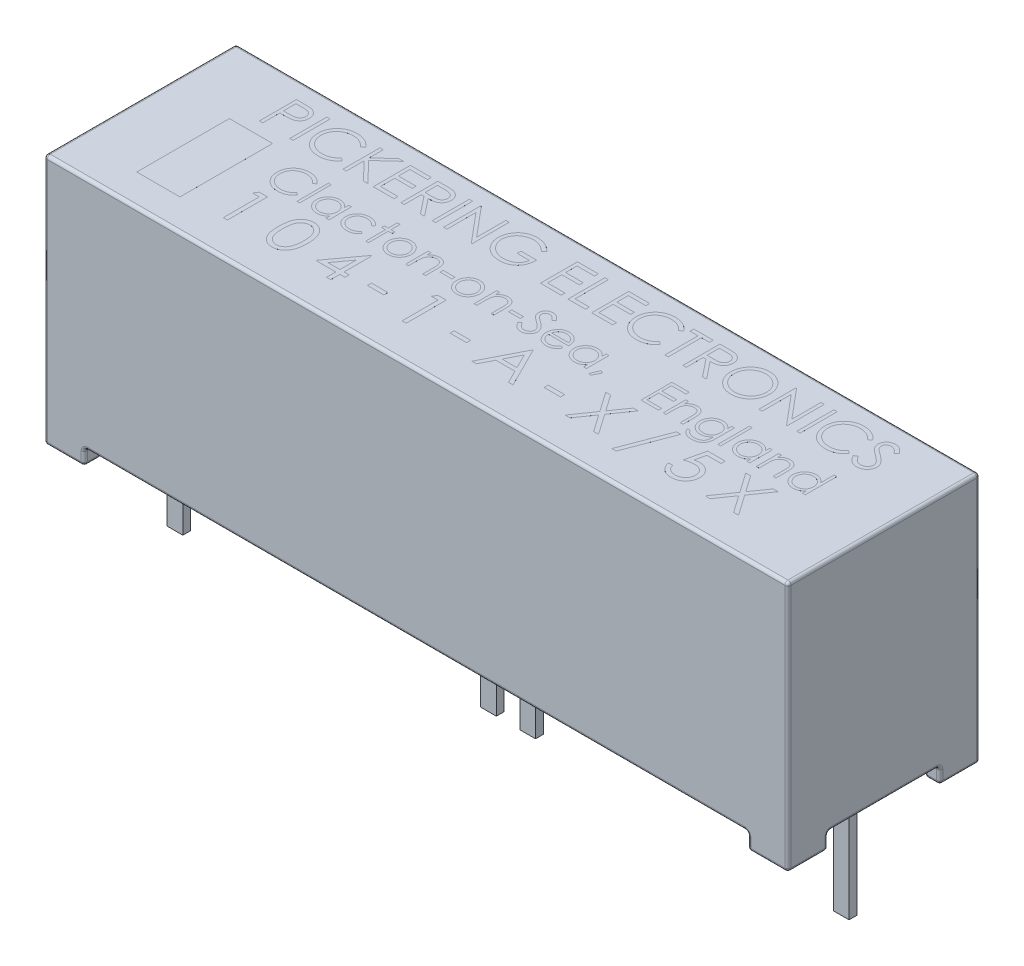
from build123d import *

# Parameters (mm, degrees)
SKETCH1_W               = 24.1
SKETCH1_H               = 6.22
MAIN_BODY_DEPTH         = 7.622
ORIGINAL_FOOT_DEPTH     = 0.508
RIGHT_FEET_COPY_1_DEPTH = 0.508
SKETCH3_W               = 0.508
SKETCH3_H               = 0.254
PINS_DEPTH              = 3.808
SKETCH4_W               = 1.4
SKETCH4_H               = 3
SKETCH4_W_2             = 0.107692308
SKETCH4_H_2             = 1.2
SKETCH4_W_3             = 0.08974359
SKETCH4_H_3             = 1.025641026
SKETCH4_W_4             = 0.384615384
SKETCH4_H_4             = 0.102564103
SKETCH4_W_5             = 0.533333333
SKETCH4_H_5             = 0.133333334
LETTERING_DEPTH         = 0.0001
FILLET1_R               = 0.1


with BuildPart() as part:
    # Sketch1 → Main Body (new body)
    with BuildSketch(Plane(origin=(0, 0, 0), x_dir=(1, 0, 0), z_dir=(0, 1, 0))):
        Rectangle(SKETCH1_W, SKETCH1_H)
    extrude(amount=MAIN_BODY_DEPTH)

    # Sketch2 → Original foot (add)
    with BuildSketch(Plane.XZ):
        Polygon((-12.05, 3.11), (-10.75, 3.11), (-10.75, 2.53065977), (-11.560513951, 2.53065977), (-11.560513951, 1.81), (-12.05, 1.81), align=None)
    original_foot = extrude(amount=ORIGINAL_FOOT_DEPTH)

    # Left foot: Original foot across plane
    add(original_foot.mirror(Plane.XY))

    # Right Feet: Original foot across plane
    add(original_foot.mirror(Plane(origin=(0, 0, 0), x_dir=(0, 0, 1), z_dir=(1, 0, 0))))

    # Right Feet copy 1 sketch → Right Feet copy 1 (add)
    with BuildSketch(Plane(origin=(0, 0, 0), x_dir=(-1, 0, 0), z_dir=(0, -1, 0))):
        Polygon((-12.05, 3.11), (-10.75, 3.11), (-10.75, 2.53065977), (-11.560513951, 2.53065977), (-11.560513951, 1.81), (-12.05, 1.81), align=None)
    extrude(amount=RIGHT_FEET_COPY_1_DEPTH)

    # Sketch3 → Pins (add)
    with BuildSketch(Plane.XZ):
        with Locations((-10.795, 0)):
            Rectangle(SKETCH3_W, SKETCH3_H)
        with Locations((-0.635, 0)):
            Rectangle(SKETCH3_W, SKETCH3_H)
        with Locations((10.795, 0)):
            Rectangle(SKETCH3_W, SKETCH3_H)
        with Locations((0.635, 0)):
            Rectangle(SKETCH3_W, SKETCH3_H)
    extrude(amount=PINS_DEPTH)

    # Sketch4 → Lettering (add)
    # profile 1 of 55: a face of its own
    with BuildSketch(Plane(origin=(0, 7.622, 0), x_dir=(-1, 0, 0), z_dir=(0, 1, 0))):
        with Locations((9.35, 0.61)):
            Rectangle(SKETCH4_W, SKETCH4_H)
    # profile 2 of 55: a face of its own
    with BuildSketch(Plane(origin=(0, 7.622, 0), x_dir=(-1, 0, 0), z_dir=(0, 1, 0))):
        with BuildLine():
            Line((9.496153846, -2.51), (9.260817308, -2.51))
            add(Edge.make_bspline(
                [(9.260817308, -2.51), (9.244630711, -2.509982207), (9.213616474, -2.509948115), (9.16914274, -2.508914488), (9.128750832, -2.507533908), (9.092527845, -2.505620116), (9.060362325, -2.503358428), (9.032399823, -2.5001863), (9.008420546, -2.496874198), (8.994052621, -2.493506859), (8.9875, -2.491971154)],
                knots=[0, 0, 0, 0, 1.415646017, 2.712440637, 3.8905458, 4.950247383, 5.884950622, 6.709939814, 7.411656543, 8, 8, 8, 8], degree=3))
            add(Edge.make_bspline(
                [(8.9875, -2.491971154), (8.979205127, -2.489700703), (8.962810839, -2.4852133), (8.939186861, -2.476226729), (8.916714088, -2.465566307), (8.895298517, -2.453434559), (8.875307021, -2.439258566), (8.856115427, -2.423856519), (8.838126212, -2.406605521), (8.821611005, -2.387528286), (8.806308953, -2.367249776), (8.793500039, -2.345252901), (8.782189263, -2.32230074), (8.773374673, -2.29783291), (8.766446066, -2.272172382), (8.761399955, -2.245252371), (8.758156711, -2.21713095), (8.757848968, -2.197909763), (8.757692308, -2.188125)],
                knots=[0, 0, 0, 0, 0.999333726, 1.975119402, 2.933498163, 3.889020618, 4.832249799, 5.779334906, 6.747801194, 7.724875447, 8.710438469, 9.696133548, 10.679360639, 11.681339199, 12.714023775, 13.766351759, 14.862936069, 16, 16, 16, 16], degree=3))
            add(Edge.make_bspline(
                [(8.757692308, -2.188125), (8.757836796, -2.178258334), (8.758119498, -2.158953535), (8.76151251, -2.130711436), (8.766082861, -2.103722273), (8.773110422, -2.07804589), (8.782314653, -2.053834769), (8.793111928, -2.030718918), (8.806134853, -2.009091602), (8.821098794, -1.988874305), (8.837745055, -1.970048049), (8.856003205, -1.952749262), (8.875799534, -1.937079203), (8.897071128, -1.923002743), (8.920025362, -1.910846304), (8.9443141, -1.899958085), (8.97014846, -1.890813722), (8.988025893, -1.886003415), (8.997115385, -1.883557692)],
                knots=[0, 0, 0, 0, 1.121902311, 2.195077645, 3.232258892, 4.234102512, 5.217864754, 6.176164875, 7.132989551, 8.084763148, 9.034132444, 9.988522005, 10.94243251, 11.903244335, 12.886203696, 13.894208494, 14.929344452, 16, 16, 16, 16], degree=3))
            add(Edge.make_bspline(
                [(8.997115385, -1.883557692), (9.004633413, -1.881960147), (9.02110961, -1.878459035), (9.048242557, -1.874523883), (9.079849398, -1.871296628), (9.115822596, -1.868284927), (9.156246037, -1.866689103), (9.20102701, -1.864815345), (9.250317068, -1.86393122), (9.284695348, -1.863875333), (9.302644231, -1.863846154)],
                knots=[0, 0, 0, 0, 0.601372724, 1.317943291, 2.144091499, 3.08771165, 4.142394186, 5.309582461, 6.595334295, 8, 8, 8, 8], degree=3))
            Line((9.302644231, -1.863846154), (9.388461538, -1.863846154))
            Line((9.388461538, -1.863846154), (9.388461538, -1.31))
            Line((9.388461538, -1.31), (9.496153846, -1.31))
            Line((9.496153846, -1.31), (9.496153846, -2.51))
        make_face()
        with BuildLine():
            Line((9.388461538, -2.386923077), (9.388461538, -1.986923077))
            Line((9.388461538, -1.986923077), (9.178365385, -1.984278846))
            add(Edge.make_bspline(
                [(9.178365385, -1.984278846), (9.168106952, -1.984272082), (9.148303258, -1.984259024), (9.119618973, -1.985648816), (9.093070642, -1.987160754), (9.068619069, -1.989605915), (9.046375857, -1.99258825), (9.026287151, -1.996575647), (9.008192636, -2.000642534), (8.987349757, -2.007699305), (8.964003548, -2.018345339), (8.938664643, -2.034246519), (8.917014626, -2.054278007), (8.898437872, -2.077044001), (8.883754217, -2.102396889), (8.873112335, -2.129447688), (8.866616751, -2.158093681), (8.865800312, -2.177674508), (8.865384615, -2.187644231)],
                knots=[0, 0, 0, 0, 1.160501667, 2.240324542, 3.248665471, 4.168823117, 5.020172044, 5.786515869, 6.485785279, 7.116517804, 8.272762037, 9.381837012, 10.485674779, 11.594342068, 12.695271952, 13.786226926, 14.872841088, 16, 16, 16, 16], degree=3))
            add(Edge.make_bspline(
                [(8.865384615, -2.187644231), (8.865818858, -2.197290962), (8.866682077, -2.21646747), (8.873058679, -2.244585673), (8.883866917, -2.271328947), (8.898449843, -2.296480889), (8.916581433, -2.319186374), (8.937800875, -2.338771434), (8.961778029, -2.354623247), (8.983907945, -2.365175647), (9.003712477, -2.37136381), (9.020831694, -2.37583135), (9.040259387, -2.378912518), (9.061811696, -2.381860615), (9.085461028, -2.384240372), (9.111357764, -2.385892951), (9.139415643, -2.386849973), (9.158893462, -2.386898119), (9.168990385, -2.386923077)],
                knots=[0, 0, 0, 0, 1.12039168, 2.227199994, 3.330242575, 4.460839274, 5.593542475, 6.693949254, 7.801736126, 8.92216649, 9.528704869, 10.210659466, 10.975987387, 11.81211542, 12.738540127, 13.736887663, 14.826846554, 16, 16, 16, 16], degree=3))
            Line((9.168990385, -2.386923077), (9.388461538, -2.386923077))
        make_face(mode=Mode.SUBTRACT)
    # profile 3 of 55: a face of its own
    with BuildSketch(Plane(origin=(0, 7.622, 0), x_dir=(-1, 0, 0), z_dir=(0, 1, 0))):
        with Locations((8.457692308, -1.91)):
            Rectangle(SKETCH4_W_2, SKETCH4_H_2)
    # profile 4 of 55: a face of its own
    with BuildSketch(Plane(origin=(0, 7.622, 0), x_dir=(-1, 0, 0), z_dir=(0, 1, 0))):
        with BuildLine():
            Line((7.034615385, -2.289807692), (7.128846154, -2.217692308))
            add(Edge.make_bspline(
                [(7.128846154, -2.217692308), (7.135568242, -2.225703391), (7.148921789, -2.241617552), (7.170403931, -2.263966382), (7.192796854, -2.284897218), (7.216069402, -2.304544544), (7.240760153, -2.322118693), (7.265928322, -2.338988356), (7.292488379, -2.353758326), (7.329029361, -2.371801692), (7.377017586, -2.390219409), (7.437218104, -2.406060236), (7.500148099, -2.416049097), (7.543071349, -2.417138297), (7.564903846, -2.417692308)],
                knots=[0, 0, 0, 0, 0.75789156, 1.505565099, 2.245254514, 2.979266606, 3.711207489, 4.440978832, 5.174393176, 5.91211879, 7.394186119, 8.890401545, 10.418332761, 12, 12, 12, 12], degree=3))
            add(Edge.make_bspline(
                [(7.564903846, -2.417692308), (7.57693226, -2.417553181), (7.600877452, -2.41727622), (7.636416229, -2.413648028), (7.671358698, -2.408489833), (7.705574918, -2.401022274), (7.738996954, -2.391300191), (7.771879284, -2.37989878), (7.803834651, -2.365710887), (7.835247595, -2.350042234), (7.865342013, -2.33233961), (7.893822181, -2.313036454), (7.920559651, -2.292323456), (7.945622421, -2.270249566), (7.968757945, -2.246557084), (7.990212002, -2.221512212), (8.009957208, -2.195001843), (8.027973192, -2.167152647), (8.044087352, -2.138102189), (8.058060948, -2.107975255), (8.069872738, -2.076886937), (8.079455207, -2.04490386), (8.086954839, -2.012139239), (8.092146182, -1.978475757), (8.095740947, -1.943972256), (8.096015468, -1.920586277), (8.096153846, -1.908798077)],
                knots=[0, 0, 0, 0, 1.054960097, 2.100129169, 3.131228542, 4.15308236, 5.169990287, 6.183953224, 7.204064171, 8.235355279, 9.262684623, 10.264978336, 11.252191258, 12.228402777, 13.192898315, 14.155264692, 15.119862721, 16.091023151, 17.063429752, 18.032246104, 19.00241354, 19.978852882, 20.959535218, 21.948948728, 22.966123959, 24, 24, 24, 24], degree=3))
            add(Edge.make_bspline(
                [(8.096153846, -1.908798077), (8.095720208, -1.89106202), (8.094868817, -1.856239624), (8.087323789, -1.805226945), (8.075766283, -1.756309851), (8.058728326, -1.709819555), (8.037300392, -1.665368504), (8.010564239, -1.623495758), (7.979481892, -1.583587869), (7.943734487, -1.546611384), (7.904508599, -1.512835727), (7.862423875, -1.483092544), (7.817583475, -1.458298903), (7.770482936, -1.437667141), (7.720759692, -1.421807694), (7.668503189, -1.410642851), (7.613827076, -1.403359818), (7.576466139, -1.402662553), (7.557451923, -1.402307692)],
                knots=[0, 0, 0, 0, 1.029159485, 2.020618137, 2.987588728, 3.942669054, 4.889339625, 5.846988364, 6.821327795, 7.821533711, 8.827683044, 9.822769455, 10.807800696, 11.797391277, 12.803701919, 13.832062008, 14.896664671, 16, 16, 16, 16], degree=3))
            add(Edge.make_bspline(
                [(7.557451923, -1.402307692), (7.53650243, -1.402886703), (7.495268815, -1.404026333), (7.434799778, -1.413680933), (7.376913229, -1.429335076), (7.321606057, -1.451242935), (7.269034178, -1.479722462), (7.219115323, -1.514247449), (7.171807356, -1.555146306), (7.143360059, -1.586374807), (7.128846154, -1.602307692)],
                knots=[0, 0, 0, 0, 1.028121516, 2.023589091, 2.998037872, 3.967518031, 4.937445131, 5.927275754, 6.942489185, 8, 8, 8, 8], degree=3))
            Line((7.128846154, -1.602307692), (7.034615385, -1.530913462))
            add(Edge.make_bspline(
                [(7.034615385, -1.530913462), (7.042198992, -1.521129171), (7.057329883, -1.501607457), (7.08182598, -1.474080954), (7.107649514, -1.448211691), (7.134870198, -1.424134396), (7.163523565, -1.401728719), (7.193597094, -1.381098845), (7.224940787, -1.362015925), (7.257593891, -1.3447195), (7.291558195, -1.329328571), (7.32654263, -1.315876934), (7.362611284, -1.304581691), (7.399479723, -1.295091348), (7.437526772, -1.288313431), (7.476317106, -1.282919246), (7.516211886, -1.279718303), (7.543103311, -1.279394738), (7.556730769, -1.279230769)],
                knots=[0, 0, 0, 0, 0.986880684, 1.969034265, 2.935876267, 3.899990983, 4.864973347, 5.834408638, 6.8063673, 7.789580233, 8.778939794, 9.778051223, 10.776304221, 11.791326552, 12.811423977, 13.855999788, 14.91350973, 16, 16, 16, 16], degree=3))
            add(Edge.make_bspline(
                [(7.556730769, -1.279230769), (7.569637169, -1.279320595), (7.595157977, -1.279498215), (7.632837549, -1.28237553), (7.669519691, -1.286301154), (7.705099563, -1.292212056), (7.739771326, -1.299187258), (7.773220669, -1.308537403), (7.805776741, -1.319011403), (7.837308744, -1.331321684), (7.867843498, -1.345212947), (7.897282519, -1.36091291), (7.925612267, -1.378289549), (7.953111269, -1.396959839), (7.979373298, -1.417523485), (8.004625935, -1.439694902), (8.029010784, -1.463399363), (8.044097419, -1.480492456), (8.051682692, -1.489086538)],
                knots=[0, 0, 0, 0, 1.114604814, 2.203992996, 3.262667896, 4.300477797, 5.318619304, 6.316056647, 7.298880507, 8.271930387, 9.238335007, 10.195173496, 11.151986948, 12.108099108, 13.064862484, 14.031167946, 15.010108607, 16, 16, 16, 16], degree=3))
            add(Edge.make_bspline(
                [(8.051682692, -1.489086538), (8.063831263, -1.504015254), (8.087981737, -1.533692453), (8.118893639, -1.581785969), (8.145265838, -1.631954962), (8.166826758, -1.684490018), (8.18338806, -1.739411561), (8.195031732, -1.796631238), (8.202545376, -1.856034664), (8.203407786, -1.89643528), (8.203846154, -1.916971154)],
                knots=[0, 0, 0, 0, 0.994611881, 1.977215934, 2.950189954, 3.921972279, 4.908960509, 5.911694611, 6.938501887, 8, 8, 8, 8], degree=3))
            add(Edge.make_bspline(
                [(8.203846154, -1.916971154), (8.20331056, -1.938554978), (8.202256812, -1.981019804), (8.193378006, -2.043355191), (8.178921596, -2.102990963), (8.159015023, -2.160156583), (8.132752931, -2.214524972), (8.100960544, -2.26632575), (8.063327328, -2.315516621), (8.02032592, -2.361468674), (7.973157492, -2.403481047), (7.922648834, -2.440443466), (7.868894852, -2.47120368), (7.812488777, -2.496916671), (7.75300796, -2.516680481), (7.69057938, -2.530515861), (7.625320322, -2.539127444), (7.580796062, -2.540216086), (7.558173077, -2.540769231)],
                knots=[0, 0, 0, 0, 1.032901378, 2.032168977, 3.007206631, 3.966850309, 4.924221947, 5.891988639, 6.871730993, 7.884084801, 8.900290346, 9.89161143, 10.874607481, 11.860025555, 12.854717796, 13.869097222, 14.917278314, 16, 16, 16, 16], degree=3))
            add(Edge.make_bspline(
                [(7.558173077, -2.540769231), (7.544385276, -2.540603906), (7.517093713, -2.540276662), (7.476721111, -2.537086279), (7.437416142, -2.531766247), (7.399069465, -2.524515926), (7.36161783, -2.515497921), (7.325229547, -2.504206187), (7.290008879, -2.490553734), (7.255718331, -2.475358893), (7.222797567, -2.457956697), (7.191262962, -2.439041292), (7.161370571, -2.418248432), (7.132926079, -2.395881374), (7.106060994, -2.371768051), (7.080372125, -2.346313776), (7.056622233, -2.318843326), (7.041964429, -2.299503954), (7.034615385, -2.289807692)],
                knots=[0, 0, 0, 0, 1.096566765, 2.170543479, 3.218870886, 4.250164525, 5.273529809, 6.281496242, 7.278154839, 8.276706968, 9.263143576, 10.238168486, 11.199979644, 12.157579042, 13.114563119, 14.070017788, 15.032356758, 16, 16, 16, 16], degree=3))
        make_face()
    # profile 5 of 55: a face of its own
    with BuildSketch(Plane(origin=(0, 7.622, 0), x_dir=(-1, 0, 0), z_dir=(0, 1, 0))):
        Polygon((6.788461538, -2.51), (6.680769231, -2.51), (6.680769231, -2.053028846), (6.180528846, -2.51), (6.026923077, -2.51), (6.616586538, -1.971538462), (5.980769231, -1.31), (6.124278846, -1.31), (6.680769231, -1.889086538), (6.680769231, -1.31), (6.788461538, -1.31), align=None)
    # profile 6 of 55: a face of its own
    with BuildSketch(Plane(origin=(0, 7.622, 0), x_dir=(-1, 0, 0), z_dir=(0, 1, 0))):
        Polygon((5.803846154, -2.51), (5.126923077, -2.51), (5.126923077, -2.386923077), (5.696153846, -2.386923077), (5.696153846, -2.017692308), (5.126923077, -2.017692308), (5.126923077, -1.894615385), (5.696153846, -1.894615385), (5.696153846, -1.433076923), (5.126923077, -1.433076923), (5.126923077, -1.31), (5.803846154, -1.31), align=None)
    # profile 7 of 55: a face of its own
    with BuildSketch(Plane(origin=(0, 7.622, 0), x_dir=(-1, 0, 0), z_dir=(0, 1, 0))):
        with BuildLine():
            Line((4.911538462, -2.51), (4.671394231, -2.51))
            add(Edge.make_bspline(
                [(4.671394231, -2.51), (4.655368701, -2.509946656), (4.624597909, -2.50984423), (4.580515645, -2.509273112), (4.54046064, -2.50763619), (4.504453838, -2.506227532), (4.472495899, -2.503658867), (4.444488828, -2.501203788), (4.420561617, -2.497989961), (4.406077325, -2.495005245), (4.399519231, -2.493653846)],
                knots=[0, 0, 0, 0, 1.410062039, 2.707475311, 3.878576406, 4.937260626, 5.877586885, 6.699081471, 7.410979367, 8, 8, 8, 8], degree=3))
            add(Edge.make_bspline(
                [(4.399519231, -2.493653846), (4.390739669, -2.49148491), (4.373367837, -2.487193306), (4.348358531, -2.478117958), (4.324517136, -2.467632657), (4.301930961, -2.455223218), (4.280605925, -2.441099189), (4.260544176, -2.425203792), (4.242014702, -2.407400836), (4.224358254, -2.388427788), (4.208940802, -2.367458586), (4.195061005, -2.345557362), (4.183409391, -2.322302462), (4.174240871, -2.297811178), (4.166554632, -2.272323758), (4.161388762, -2.245588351), (4.158171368, -2.217691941), (4.157853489, -2.198710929), (4.157692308, -2.189086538)],
                knots=[0, 0, 0, 0, 1.027276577, 2.032638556, 3.019345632, 3.985365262, 4.957888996, 5.923693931, 6.890056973, 7.876427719, 8.865527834, 9.843495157, 10.821038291, 11.815616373, 12.812734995, 13.843357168, 14.906466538, 16, 16, 16, 16], degree=3))
            add(Edge.make_bspline(
                [(4.157692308, -2.189086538), (4.158195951, -2.173097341), (4.15917869, -2.141898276), (4.168341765, -2.096620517), (4.18335019, -2.054383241), (4.20403492, -2.015245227), (4.230363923, -1.979948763), (4.262005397, -1.949051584), (4.298797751, -1.922957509), (4.333209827, -1.905054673), (4.363622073, -1.893535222), (4.388732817, -1.885389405), (4.416145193, -1.87920187), (4.445465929, -1.873578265), (4.476921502, -1.869287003), (4.510448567, -1.866239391), (4.546130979, -1.864279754), (4.570590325, -1.863993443), (4.583173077, -1.863846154)],
                knots=[0, 0, 0, 0, 1.260402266, 2.459371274, 3.627181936, 4.786749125, 5.93865593, 7.087644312, 8.261344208, 9.485713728, 10.136162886, 10.825977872, 11.566646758, 12.35154167, 13.181268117, 14.0701832, 15.007234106, 16, 16, 16, 16], degree=3))
            Line((4.583173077, -1.863846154), (4.142307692, -1.31))
            Line((4.142307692, -1.31), (4.275480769, -1.31))
            Line((4.275480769, -1.31), (4.716346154, -1.863846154))
            Line((4.716346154, -1.863846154), (4.803846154, -1.863846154))
            Line((4.803846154, -1.863846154), (4.803846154, -1.31))
            Line((4.803846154, -1.31), (4.911538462, -1.31))
            Line((4.911538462, -1.31), (4.911538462, -2.51))
        make_face()
        with BuildLine():
            Line((4.803846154, -2.386923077), (4.803846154, -1.986923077))
            Line((4.803846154, -1.986923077), (4.584134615, -1.985240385))
            add(Edge.make_bspline(
                [(4.584134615, -1.985240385), (4.573876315, -1.985235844), (4.553992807, -1.985227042), (4.525226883, -1.986596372), (4.498442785, -1.988153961), (4.473743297, -1.990536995), (4.451116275, -1.993606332), (4.430576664, -1.997451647), (4.412079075, -2.001912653), (4.390574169, -2.008887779), (4.366284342, -2.019462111), (4.34043109, -2.03585853), (4.317823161, -2.055687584), (4.299027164, -2.078648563), (4.283930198, -2.10400223), (4.27344401, -2.131174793), (4.266533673, -2.159738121), (4.265772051, -2.179350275), (4.265384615, -2.189326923)],
                knots=[0, 0, 0, 0, 1.146399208, 2.222048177, 3.218135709, 4.144938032, 4.994811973, 5.769438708, 6.479732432, 7.119818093, 8.294689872, 9.430121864, 10.527913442, 11.641375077, 12.733452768, 13.811150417, 14.886538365, 16, 16, 16, 16], degree=3))
            add(Edge.make_bspline(
                [(4.265384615, -2.189326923), (4.265791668, -2.198979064), (4.266598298, -2.218106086), (4.273333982, -2.246044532), (4.284332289, -2.272610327), (4.299386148, -2.297437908), (4.318122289, -2.31980791), (4.339945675, -2.338889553), (4.364342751, -2.354742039), (4.386960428, -2.365201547), (4.407324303, -2.371355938), (4.424923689, -2.375823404), (4.444982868, -2.378952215), (4.467265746, -2.381829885), (4.491870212, -2.38426683), (4.518811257, -2.385884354), (4.54806962, -2.386851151), (4.568348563, -2.386898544), (4.578846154, -2.386923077)],
                knots=[0, 0, 0, 0, 1.100596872, 2.180981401, 3.259506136, 4.371595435, 5.481727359, 6.576991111, 7.667816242, 8.793363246, 9.406619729, 10.09427138, 10.864108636, 11.721733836, 12.6590937, 13.685439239, 14.801845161, 16, 16, 16, 16], degree=3))
            Line((4.578846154, -2.386923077), (4.803846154, -2.386923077))
        make_face(mode=Mode.SUBTRACT)
    # profile 8 of 55: a face of its own
    with BuildSketch(Plane(origin=(0, 7.622, 0), x_dir=(-1, 0, 0), z_dir=(0, 1, 0))):
        with Locations((3.842307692, -1.91)):
            Rectangle(SKETCH4_W_2, SKETCH4_H_2)
    # profile 9 of 55: a face of its own
    with BuildSketch(Plane(origin=(0, 7.622, 0), x_dir=(-1, 0, 0), z_dir=(0, 1, 0))):
        Polygon((3.526923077, -1.31), (3.526923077, -2.51), (3.504326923, -2.51), (2.711538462, -1.565528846), (2.711538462, -2.51), (2.603846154, -2.51), (2.603846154, -1.31), (2.628365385, -1.31), (3.419230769, -2.252307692), (3.419230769, -1.31), align=None)
    # profile 10 of 55: a face of its own
    with BuildSketch(Plane(origin=(0, 7.622, 0), x_dir=(-1, 0, 0), z_dir=(0, 1, 0))):
        with BuildLine():
            Line((1.173076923, -2.305192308), (1.265384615, -2.217692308))
            add(Edge.make_bspline(
                [(1.265384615, -2.217692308), (1.282186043, -2.233384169), (1.315299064, -2.264310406), (1.369026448, -2.304884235), (1.425160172, -2.33937083), (1.483243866, -2.367704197), (1.542157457, -2.38972872), (1.600724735, -2.405653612), (1.658535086, -2.415895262), (1.696914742, -2.417098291), (1.715865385, -2.417692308)],
                knots=[0, 0, 0, 0, 1.091957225, 2.152079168, 3.193085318, 4.218301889, 5.218403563, 6.17723952, 7.099979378, 8, 8, 8, 8], degree=3))
            add(Edge.make_bspline(
                [(1.715865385, -2.417692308), (1.727493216, -2.417550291), (1.750718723, -2.417266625), (1.785218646, -2.413654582), (1.819352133, -2.408443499), (1.853001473, -2.40098118), (1.886300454, -2.391288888), (1.919174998, -2.379586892), (1.951561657, -2.365500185), (1.983290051, -2.349440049), (2.01420648, -2.331907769), (2.043283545, -2.312354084), (2.070642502, -2.291380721), (2.096089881, -2.268712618), (2.119974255, -2.244727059), (2.141858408, -2.219083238), (2.162220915, -2.192160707), (2.180300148, -2.163573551), (2.196641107, -2.134134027), (2.210790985, -2.104076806), (2.22297485, -2.073613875), (2.232710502, -2.042728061), (2.240537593, -2.011439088), (2.24607771, -1.979795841), (2.249189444, -1.947642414), (2.249728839, -1.92611207), (2.25, -1.915288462)],
                knots=[0, 0, 0, 0, 1.028307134, 2.053947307, 3.065600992, 4.082111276, 5.100671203, 6.132125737, 7.167228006, 8.222953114, 9.277225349, 10.309459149, 11.320441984, 12.324791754, 13.322338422, 14.312705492, 15.305176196, 16.306142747, 17.302479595, 18.282363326, 19.243345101, 20.20291386, 21.145121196, 22.094978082, 23.042318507, 24, 24, 24, 24], degree=3))
            add(Edge.make_bspline(
                [(2.25, -1.915288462), (2.249738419, -1.904224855), (2.249215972, -1.882127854), (2.245940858, -1.849136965), (2.239657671, -1.816703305), (2.231982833, -1.784520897), (2.22111931, -1.753000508), (2.208490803, -1.721680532), (2.193263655, -1.69085205), (2.175729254, -1.660729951), (2.156351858, -1.631416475), (2.135043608, -1.603571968), (2.11176426, -1.57752184), (2.086941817, -1.552885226), (2.060349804, -1.529817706), (2.031730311, -1.508597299), (2.001483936, -1.488895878), (1.969597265, -1.470929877), (1.936407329, -1.454881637), (1.902376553, -1.440610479), (1.867395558, -1.428857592), (1.831648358, -1.419278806), (1.79517752, -1.411427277), (1.757797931, -1.406376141), (1.719784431, -1.402710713), (1.694159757, -1.402442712), (1.68125, -1.402307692)],
                knots=[0, 0, 0, 0, 0.935896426, 1.86923723, 2.799743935, 3.728471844, 4.66505513, 5.616527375, 6.583419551, 7.570341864, 8.562833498, 9.553750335, 10.533080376, 11.5155245, 12.510142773, 13.507781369, 14.526649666, 15.561487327, 16.601173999, 17.643331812, 18.680652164, 19.71969803, 20.772446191, 21.833473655, 22.9085001, 24, 24, 24, 24], degree=3))
            add(Edge.make_bspline(
                [(1.68125, -1.402307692), (1.665691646, -1.402632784), (1.63514029, -1.403271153), (1.590231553, -1.408244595), (1.547095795, -1.41600224), (1.505873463, -1.427398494), (1.466414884, -1.441823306), (1.428865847, -1.459661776), (1.393121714, -1.480725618), (1.359340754, -1.504590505), (1.328312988, -1.5311735), (1.300110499, -1.559626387), (1.275559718, -1.590176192), (1.254500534, -1.622816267), (1.236374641, -1.657065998), (1.221915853, -1.693512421), (1.210732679, -1.731748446), (1.206157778, -1.758182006), (1.203846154, -1.771538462)],
                knots=[0, 0, 0, 0, 1.130234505, 2.219399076, 3.279128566, 4.311639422, 5.322903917, 6.328167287, 7.327698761, 8.334124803, 9.329374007, 10.292761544, 11.24113083, 12.171311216, 13.111441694, 14.052040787, 15.015727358, 16, 16, 16, 16], degree=3))
            Line((1.203846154, -1.771538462), (1.603846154, -1.771538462))
            Line((1.603846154, -1.771538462), (1.603846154, -1.894615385))
            Line((1.603846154, -1.894615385), (1.096153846, -1.894615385))
            add(Edge.make_bspline(
                [(1.096153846, -1.894615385), (1.096738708, -1.871675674), (1.09788339, -1.826778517), (1.105912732, -1.761302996), (1.118878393, -1.699461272), (1.1365905, -1.641188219), (1.159519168, -1.586566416), (1.187418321, -1.535540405), (1.220734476, -1.488439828), (1.258280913, -1.44488017), (1.300418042, -1.40602444), (1.346007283, -1.371873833), (1.395123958, -1.343107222), (1.447721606, -1.319703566), (1.50362804, -1.301438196), (1.562972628, -1.288487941), (1.625674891, -1.280729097), (1.668647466, -1.279737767), (1.690625, -1.279230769)],
                knots=[0, 0, 0, 0, 1.140356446, 2.231883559, 3.274166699, 4.278491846, 5.25512956, 6.21435461, 7.1637429, 8.11826594, 9.068280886, 10.0076534, 10.945064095, 11.891975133, 12.864533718, 13.863980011, 14.907571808, 16, 16, 16, 16], degree=3))
            add(Edge.make_bspline(
                [(1.690625, -1.279230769), (1.704171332, -1.279425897), (1.730889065, -1.27981075), (1.770348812, -1.282545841), (1.808720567, -1.286756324), (1.845998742, -1.293114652), (1.882320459, -1.300902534), (1.917504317, -1.310875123), (1.951684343, -1.322418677), (1.984913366, -1.335548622), (2.016889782, -1.350761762), (2.047756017, -1.367667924), (2.077682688, -1.386179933), (2.106465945, -1.406617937), (2.134255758, -1.428829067), (2.160872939, -1.452857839), (2.186466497, -1.478630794), (2.202498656, -1.496932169), (2.210576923, -1.506153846)],
                knots=[0, 0, 0, 0, 1.107784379, 2.184907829, 3.233506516, 4.263428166, 5.276301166, 6.270063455, 7.25232949, 8.225834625, 9.190232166, 10.146266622, 11.1027726, 12.066435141, 13.031522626, 14.010570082, 14.99756817, 16, 16, 16, 16], degree=3))
            add(Edge.make_bspline(
                [(2.210576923, -1.506153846), (2.222297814, -1.520783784), (2.245545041, -1.549800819), (2.275468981, -1.596292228), (2.300978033, -1.644430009), (2.321675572, -1.694348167), (2.337837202, -1.746000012), (2.349427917, -1.79931954), (2.356218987, -1.854375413), (2.357197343, -1.891632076), (2.357692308, -1.910480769)],
                knots=[0, 0, 0, 0, 1.023165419, 2.029347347, 3.013907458, 3.994755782, 4.975994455, 5.96558838, 6.970761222, 8, 8, 8, 8], degree=3))
            add(Edge.make_bspline(
                [(2.357692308, -1.910480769), (2.357509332, -1.924594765), (2.357145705, -1.952643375), (2.352755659, -1.994288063), (2.346419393, -2.035182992), (2.337241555, -2.075366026), (2.325165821, -2.114658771), (2.310663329, -2.153363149), (2.293676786, -2.191324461), (2.273854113, -2.228206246), (2.252277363, -2.263995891), (2.228014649, -2.297566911), (2.202413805, -2.329568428), (2.174248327, -2.359094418), (2.144573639, -2.387088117), (2.112651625, -2.412811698), (2.079006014, -2.436699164), (2.043365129, -2.458283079), (2.006294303, -2.477677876), (1.967873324, -2.494679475), (1.928116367, -2.50873101), (1.887320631, -2.520653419), (1.845177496, -2.529470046), (1.801992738, -2.5358639), (1.757541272, -2.540238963), (1.727494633, -2.540590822), (1.712259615, -2.540769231)],
                knots=[0, 0, 0, 0, 1.009025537, 2.005226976, 2.991671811, 3.967589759, 4.950148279, 5.929425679, 6.922109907, 7.921964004, 8.922507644, 9.908469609, 10.882248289, 11.851158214, 12.824245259, 13.798023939, 14.780666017, 15.773333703, 16.775582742, 17.771174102, 18.775387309, 19.789283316, 20.80873549, 21.851817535, 22.910773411, 24, 24, 24, 24], degree=3))
            add(Edge.make_bspline(
                [(1.712259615, -2.540769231), (1.699834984, -2.540571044), (1.675198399, -2.540178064), (1.638539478, -2.537440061), (1.602519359, -2.533148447), (1.56695735, -2.527147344), (1.531988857, -2.519208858), (1.497507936, -2.509534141), (1.463579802, -2.498332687), (1.430244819, -2.484963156), (1.397276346, -2.46979101), (1.364491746, -2.452711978), (1.332002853, -2.433434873), (1.299753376, -2.411902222), (1.267539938, -2.38848391), (1.235872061, -2.362510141), (1.203985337, -2.335005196), (1.183481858, -2.315228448), (1.173076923, -2.305192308)],
                knots=[0, 0, 0, 0, 0.985875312, 1.954874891, 2.915472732, 3.863573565, 4.815313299, 5.759461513, 6.704487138, 7.649063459, 8.607849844, 9.583336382, 10.581114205, 11.603942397, 12.659508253, 13.739925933, 14.853076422, 16, 16, 16, 16], degree=3))
        make_face()
    # profile 11 of 55: a face of its own
    with BuildSketch(Plane(origin=(0, 7.622, 0), x_dir=(-1, 0, 0), z_dir=(0, 1, 0))):
        Polygon((0.388461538, -2.51), (-0.288461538, -2.51), (-0.288461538, -2.386923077), (0.280769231, -2.386923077), (0.280769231, -2.017692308), (-0.288461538, -2.017692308), (-0.288461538, -1.894615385), (0.280769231, -1.894615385), (0.280769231, -1.433076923), (-0.288461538, -1.433076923), (-0.288461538, -1.31), (0.388461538, -1.31), align=None)
    # profile 12 of 55: a face of its own
    with BuildSketch(Plane(origin=(0, 7.622, 0), x_dir=(-1, 0, 0), z_dir=(0, 1, 0))):
        Polygon((-0.503846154, -2.51), (-0.611538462, -2.51), (-0.611538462, -1.433076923), (-1.073076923, -1.433076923), (-1.073076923, -1.31), (-0.503846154, -1.31), align=None)
    # profile 13 of 55: a face of its own
    with BuildSketch(Plane(origin=(0, 7.622, 0), x_dir=(-1, 0, 0), z_dir=(0, 1, 0))):
        Polygon((-1.273076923, -2.51), (-1.95, -2.51), (-1.95, -2.386923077), (-1.380769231, -2.386923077), (-1.380769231, -2.017692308), (-1.95, -2.017692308), (-1.95, -1.894615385), (-1.380769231, -1.894615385), (-1.380769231, -1.433076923), (-1.95, -1.433076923), (-1.95, -1.31), (-1.273076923, -1.31), align=None)
    # profile 14 of 55: a face of its own
    with BuildSketch(Plane(origin=(0, 7.622, 0), x_dir=(-1, 0, 0), z_dir=(0, 1, 0))):
        with BuildLine():
            Line((-3.273076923, -2.289807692), (-3.178846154, -2.217692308))
            add(Edge.make_bspline(
                [(-3.178846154, -2.217692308), (-3.172124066, -2.225703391), (-3.158770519, -2.241617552), (-3.137288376, -2.263966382), (-3.114895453, -2.284897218), (-3.091622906, -2.304544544), (-3.066932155, -2.322118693), (-3.041763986, -2.338988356), (-3.015203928, -2.353758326), (-2.978662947, -2.371801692), (-2.930674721, -2.390219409), (-2.870474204, -2.406060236), (-2.807544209, -2.416049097), (-2.764620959, -2.417138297), (-2.742788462, -2.417692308)],
                knots=[0, 0, 0, 0, 0.75789156, 1.505565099, 2.245254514, 2.979266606, 3.711207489, 4.440978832, 5.174393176, 5.91211879, 7.394186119, 8.890401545, 10.418332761, 12, 12, 12, 12], degree=3))
            add(Edge.make_bspline(
                [(-2.742788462, -2.417692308), (-2.730760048, -2.417553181), (-2.706814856, -2.41727622), (-2.671276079, -2.413648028), (-2.63633361, -2.408489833), (-2.602117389, -2.401022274), (-2.568695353, -2.391300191), (-2.535813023, -2.37989878), (-2.503857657, -2.365710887), (-2.472444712, -2.350042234), (-2.442350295, -2.33233961), (-2.413870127, -2.313036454), (-2.387132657, -2.292323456), (-2.362069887, -2.270249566), (-2.338934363, -2.246557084), (-2.317480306, -2.221512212), (-2.297735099, -2.195001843), (-2.279719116, -2.167152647), (-2.263604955, -2.138102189), (-2.24963136, -2.107975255), (-2.23781957, -2.076886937), (-2.228237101, -2.04490386), (-2.220737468, -2.012139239), (-2.215546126, -1.978475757), (-2.211951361, -1.943972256), (-2.21167684, -1.920586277), (-2.211538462, -1.908798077)],
                knots=[0, 0, 0, 0, 1.054960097, 2.100129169, 3.131228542, 4.15308236, 5.169990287, 6.183953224, 7.204064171, 8.235355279, 9.262684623, 10.264978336, 11.252191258, 12.228402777, 13.192898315, 14.155264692, 15.119862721, 16.091023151, 17.063429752, 18.032246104, 19.00241354, 19.978852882, 20.959535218, 21.948948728, 22.966123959, 24, 24, 24, 24], degree=3))
            add(Edge.make_bspline(
                [(-2.211538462, -1.908798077), (-2.2119721, -1.89106202), (-2.21282349, -1.856239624), (-2.220368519, -1.805226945), (-2.231926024, -1.756309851), (-2.248963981, -1.709819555), (-2.270391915, -1.665368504), (-2.297128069, -1.623495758), (-2.328210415, -1.583587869), (-2.36395782, -1.546611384), (-2.403183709, -1.512835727), (-2.445268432, -1.483092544), (-2.490108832, -1.458298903), (-2.537209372, -1.437667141), (-2.586932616, -1.421807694), (-2.639189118, -1.410642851), (-2.693865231, -1.403359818), (-2.731226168, -1.402662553), (-2.750240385, -1.402307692)],
                knots=[0, 0, 0, 0, 1.029159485, 2.020618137, 2.987588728, 3.942669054, 4.889339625, 5.846988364, 6.821327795, 7.821533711, 8.827683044, 9.822769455, 10.807800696, 11.797391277, 12.803701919, 13.832062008, 14.896664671, 16, 16, 16, 16], degree=3))
            add(Edge.make_bspline(
                [(-2.750240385, -1.402307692), (-2.771189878, -1.402886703), (-2.812423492, -1.404026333), (-2.87289253, -1.413680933), (-2.930779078, -1.429335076), (-2.986086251, -1.451242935), (-3.03865813, -1.479722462), (-3.088576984, -1.514247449), (-3.135884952, -1.555146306), (-3.164332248, -1.586374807), (-3.178846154, -1.602307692)],
                knots=[0, 0, 0, 0, 1.028121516, 2.023589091, 2.998037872, 3.967518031, 4.937445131, 5.927275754, 6.942489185, 8, 8, 8, 8], degree=3))
            Line((-3.178846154, -1.602307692), (-3.273076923, -1.530913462))
            add(Edge.make_bspline(
                [(-3.273076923, -1.530913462), (-3.265493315, -1.521129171), (-3.250362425, -1.501607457), (-3.225866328, -1.474080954), (-3.200042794, -1.448211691), (-3.17282211, -1.424134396), (-3.144168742, -1.401728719), (-3.114095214, -1.381098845), (-3.082751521, -1.362015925), (-3.050098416, -1.3447195), (-3.016134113, -1.329328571), (-2.981149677, -1.315876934), (-2.945081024, -1.304581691), (-2.908212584, -1.295091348), (-2.870165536, -1.288313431), (-2.831375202, -1.282919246), (-2.791480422, -1.279718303), (-2.764588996, -1.279394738), (-2.750961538, -1.279230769)],
                knots=[0, 0, 0, 0, 0.986880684, 1.969034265, 2.935876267, 3.899990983, 4.864973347, 5.834408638, 6.8063673, 7.789580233, 8.778939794, 9.778051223, 10.776304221, 11.791326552, 12.811423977, 13.855999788, 14.91350973, 16, 16, 16, 16], degree=3))
            add(Edge.make_bspline(
                [(-2.750961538, -1.279230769), (-2.738055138, -1.279320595), (-2.71253433, -1.279498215), (-2.674854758, -1.28237553), (-2.638172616, -1.286301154), (-2.602592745, -1.292212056), (-2.567920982, -1.299187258), (-2.534471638, -1.308537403), (-2.501915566, -1.319011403), (-2.470383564, -1.331321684), (-2.43984881, -1.345212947), (-2.410409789, -1.36091291), (-2.38208004, -1.378289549), (-2.354581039, -1.396959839), (-2.32831901, -1.417523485), (-2.303066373, -1.439694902), (-2.278681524, -1.463399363), (-2.263594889, -1.480492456), (-2.256009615, -1.489086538)],
                knots=[0, 0, 0, 0, 1.114604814, 2.203992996, 3.262667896, 4.300477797, 5.318619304, 6.316056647, 7.298880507, 8.271930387, 9.238335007, 10.195173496, 11.151986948, 12.108099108, 13.064862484, 14.031167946, 15.010108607, 16, 16, 16, 16], degree=3))
            add(Edge.make_bspline(
                [(-2.256009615, -1.489086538), (-2.243861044, -1.504015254), (-2.21971057, -1.533692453), (-2.188798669, -1.581785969), (-2.16242647, -1.631954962), (-2.14086555, -1.684490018), (-2.124304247, -1.739411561), (-2.112660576, -1.796631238), (-2.105146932, -1.856034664), (-2.104284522, -1.89643528), (-2.103846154, -1.916971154)],
                knots=[0, 0, 0, 0, 0.994611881, 1.977215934, 2.950189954, 3.921972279, 4.908960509, 5.911694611, 6.938501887, 8, 8, 8, 8], degree=3))
            add(Edge.make_bspline(
                [(-2.103846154, -1.916971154), (-2.104381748, -1.938554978), (-2.105435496, -1.981019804), (-2.114314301, -2.043355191), (-2.128770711, -2.102990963), (-2.148677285, -2.160156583), (-2.174939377, -2.214524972), (-2.206731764, -2.26632575), (-2.24436498, -2.315516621), (-2.287366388, -2.361468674), (-2.334534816, -2.403481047), (-2.385043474, -2.440443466), (-2.438797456, -2.47120368), (-2.49520353, -2.496916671), (-2.554684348, -2.516680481), (-2.617112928, -2.530515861), (-2.682371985, -2.539127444), (-2.726896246, -2.540216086), (-2.749519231, -2.540769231)],
                knots=[0, 0, 0, 0, 1.032901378, 2.032168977, 3.007206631, 3.966850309, 4.924221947, 5.891988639, 6.871730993, 7.884084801, 8.900290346, 9.89161143, 10.874607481, 11.860025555, 12.854717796, 13.869097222, 14.917278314, 16, 16, 16, 16], degree=3))
            add(Edge.make_bspline(
                [(-2.749519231, -2.540769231), (-2.763307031, -2.540603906), (-2.790598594, -2.540276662), (-2.830971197, -2.537086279), (-2.870276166, -2.531766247), (-2.908622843, -2.524515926), (-2.946074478, -2.515497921), (-2.982462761, -2.504206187), (-3.017683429, -2.490553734), (-3.051973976, -2.475358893), (-3.08489474, -2.457956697), (-3.116429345, -2.439041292), (-3.146321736, -2.418248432), (-3.174766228, -2.395881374), (-3.201631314, -2.371768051), (-3.227320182, -2.346313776), (-3.251070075, -2.318843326), (-3.265727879, -2.299503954), (-3.273076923, -2.289807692)],
                knots=[0, 0, 0, 0, 1.096566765, 2.170543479, 3.218870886, 4.250164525, 5.273529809, 6.281496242, 7.278154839, 8.276706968, 9.263143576, 10.238168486, 11.199979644, 12.157579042, 13.114563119, 14.070017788, 15.032356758, 16, 16, 16, 16], degree=3))
        make_face()
    # profile 15 of 55: a face of its own
    with BuildSketch(Plane(origin=(0, 7.622, 0), x_dir=(-1, 0, 0), z_dir=(0, 1, 0))):
        Polygon((-3.380769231, -2.386923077), (-3.380769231, -2.51), (-4.011538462, -2.51), (-4.011538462, -2.386923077), (-3.75, -2.386923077), (-3.75, -1.31), (-3.642307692, -1.31), (-3.642307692, -2.386923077), align=None)
    # profile 16 of 55: a face of its own
    with BuildSketch(Plane(origin=(0, 7.622, 0), x_dir=(-1, 0, 0), z_dir=(0, 1, 0))):
        with BuildLine():
            Line((-4.226923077, -2.51), (-4.467067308, -2.51))
            add(Edge.make_bspline(
                [(-4.467067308, -2.51), (-4.483092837, -2.509946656), (-4.51386363, -2.50984423), (-4.557945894, -2.509273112), (-4.598000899, -2.50763619), (-4.634007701, -2.506227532), (-4.66596564, -2.503658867), (-4.693972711, -2.501203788), (-4.717899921, -2.497989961), (-4.732384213, -2.495005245), (-4.738942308, -2.493653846)],
                knots=[0, 0, 0, 0, 1.410062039, 2.707475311, 3.878576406, 4.937260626, 5.877586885, 6.699081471, 7.410979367, 8, 8, 8, 8], degree=3))
            add(Edge.make_bspline(
                [(-4.738942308, -2.493653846), (-4.74772187, -2.49148491), (-4.765093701, -2.487193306), (-4.790103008, -2.478117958), (-4.813944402, -2.467632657), (-4.836530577, -2.455223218), (-4.857855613, -2.441099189), (-4.877917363, -2.425203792), (-4.896446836, -2.407400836), (-4.914103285, -2.388427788), (-4.929520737, -2.367458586), (-4.943400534, -2.345557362), (-4.955052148, -2.322302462), (-4.964220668, -2.297811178), (-4.971906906, -2.272323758), (-4.977072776, -2.245588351), (-4.980290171, -2.217691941), (-4.980608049, -2.198710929), (-4.980769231, -2.189086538)],
                knots=[0, 0, 0, 0, 1.027276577, 2.032638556, 3.019345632, 3.985365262, 4.957888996, 5.923693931, 6.890056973, 7.876427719, 8.865527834, 9.843495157, 10.821038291, 11.815616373, 12.812734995, 13.843357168, 14.906466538, 16, 16, 16, 16], degree=3))
            add(Edge.make_bspline(
                [(-4.980769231, -2.189086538), (-4.980265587, -2.173097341), (-4.979282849, -2.141898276), (-4.970119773, -2.096620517), (-4.955111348, -2.054383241), (-4.934426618, -2.015245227), (-4.908097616, -1.979948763), (-4.876456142, -1.949051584), (-4.839663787, -1.922957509), (-4.805251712, -1.905054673), (-4.774839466, -1.893535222), (-4.749728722, -1.885389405), (-4.722316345, -1.87920187), (-4.692995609, -1.873578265), (-4.661540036, -1.869287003), (-4.628012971, -1.866239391), (-4.59233056, -1.864279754), (-4.567871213, -1.863993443), (-4.555288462, -1.863846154)],
                knots=[0, 0, 0, 0, 1.260402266, 2.459371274, 3.627181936, 4.786749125, 5.93865593, 7.087644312, 8.261344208, 9.485713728, 10.136162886, 10.825977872, 11.566646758, 12.35154167, 13.181268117, 14.0701832, 15.007234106, 16, 16, 16, 16], degree=3))
            Line((-4.555288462, -1.863846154), (-4.996153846, -1.31))
            Line((-4.996153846, -1.31), (-4.862980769, -1.31))
            Line((-4.862980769, -1.31), (-4.422115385, -1.863846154))
            Line((-4.422115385, -1.863846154), (-4.334615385, -1.863846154))
            Line((-4.334615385, -1.863846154), (-4.334615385, -1.31))
            Line((-4.334615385, -1.31), (-4.226923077, -1.31))
            Line((-4.226923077, -1.31), (-4.226923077, -2.51))
        make_face()
        with BuildLine():
            Line((-4.334615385, -2.386923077), (-4.334615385, -1.986923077))
            Line((-4.334615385, -1.986923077), (-4.554326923, -1.985240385))
            add(Edge.make_bspline(
                [(-4.554326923, -1.985240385), (-4.564585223, -1.985235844), (-4.584468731, -1.985227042), (-4.613234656, -1.986596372), (-4.640018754, -1.988153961), (-4.664718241, -1.990536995), (-4.687345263, -1.993606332), (-4.707884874, -1.997451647), (-4.726382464, -2.001912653), (-4.74788737, -2.008887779), (-4.772177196, -2.019462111), (-4.798030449, -2.03585853), (-4.820638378, -2.055687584), (-4.839434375, -2.078648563), (-4.854531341, -2.10400223), (-4.865017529, -2.131174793), (-4.871927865, -2.159738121), (-4.872689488, -2.179350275), (-4.873076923, -2.189326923)],
                knots=[0, 0, 0, 0, 1.146399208, 2.222048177, 3.218135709, 4.144938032, 4.994811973, 5.769438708, 6.479732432, 7.119818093, 8.294689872, 9.430121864, 10.527913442, 11.641375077, 12.733452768, 13.811150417, 14.886538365, 16, 16, 16, 16], degree=3))
            add(Edge.make_bspline(
                [(-4.873076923, -2.189326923), (-4.87266987, -2.198979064), (-4.871863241, -2.218106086), (-4.865127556, -2.246044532), (-4.85412925, -2.272610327), (-4.839075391, -2.297437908), (-4.820339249, -2.31980791), (-4.798515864, -2.338889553), (-4.774118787, -2.354742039), (-4.75150111, -2.365201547), (-4.731137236, -2.371355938), (-4.71353785, -2.375823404), (-4.693478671, -2.378952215), (-4.671195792, -2.381829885), (-4.646591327, -2.38426683), (-4.619650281, -2.385884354), (-4.590391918, -2.386851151), (-4.570112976, -2.386898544), (-4.559615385, -2.386923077)],
                knots=[0, 0, 0, 0, 1.100596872, 2.180981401, 3.259506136, 4.371595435, 5.481727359, 6.576991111, 7.667816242, 8.793363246, 9.406619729, 10.09427138, 10.864108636, 11.721733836, 12.6590937, 13.685439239, 14.801845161, 16, 16, 16, 16], degree=3))
            Line((-4.559615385, -2.386923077), (-4.334615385, -2.386923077))
        make_face(mode=Mode.SUBTRACT)
    # profile 17 of 55: a face of its own
    with BuildSketch(Plane(origin=(0, 7.622, 0), x_dir=(-1, 0, 0), z_dir=(0, 1, 0))):
        with BuildLine():
            add(Edge.make_bspline(
                [(-5.803846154, -2.540769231), (-5.826068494, -2.540215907), (-5.869715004, -2.539129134), (-5.933802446, -2.530535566), (-5.995168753, -2.516391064), (-6.053850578, -2.496417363), (-6.109619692, -2.470519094), (-6.162652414, -2.439078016), (-6.212766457, -2.401785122), (-6.259832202, -2.359525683), (-6.302610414, -2.31307373), (-6.33983439, -2.263204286), (-6.371515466, -2.210921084), (-6.397400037, -2.155883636), (-6.417739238, -2.098337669), (-6.431766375, -2.037940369), (-6.440728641, -1.97509281), (-6.441776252, -1.932226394), (-6.442307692, -1.910480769)],
                knots=[0, 0, 0, 0, 1.065027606, 2.091802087, 3.093458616, 4.079833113, 5.057734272, 6.036020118, 7.030157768, 8.047461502, 9.064242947, 10.052216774, 11.02588392, 11.989864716, 12.962978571, 13.945936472, 14.957997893, 16, 16, 16, 16], degree=3))
            add(Edge.make_bspline(
                [(-6.442307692, -1.910480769), (-6.441776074, -1.888895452), (-6.440728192, -1.846348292), (-6.431759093, -1.783897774), (-6.417676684, -1.723871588), (-6.397651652, -1.666409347), (-6.371748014, -1.611482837), (-6.340017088, -1.559163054), (-6.302876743, -1.509148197), (-6.260273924, -1.462470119), (-6.213751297, -1.419687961), (-6.16418996, -1.38186789), (-6.111649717, -1.350361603), (-6.056950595, -1.32409008), (-5.999548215, -1.30419291), (-5.93984742, -1.289693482), (-5.877509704, -1.280821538), (-5.835045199, -1.279766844), (-5.813461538, -1.279230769)],
                knots=[0, 0, 0, 0, 1.043683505, 2.0572211, 3.045299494, 4.022276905, 4.994977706, 5.977452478, 6.97747046, 8.003698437, 9.029677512, 10.031249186, 11.013723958, 11.988083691, 12.9614021, 13.946617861, 14.956316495, 16, 16, 16, 16], degree=3))
            add(Edge.make_bspline(
                [(-5.813461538, -1.279230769), (-5.791716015, -1.279761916), (-5.7488498, -1.280808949), (-5.685923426, -1.289786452), (-5.625483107, -1.303819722), (-5.567714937, -1.323893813), (-5.512599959, -1.349739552), (-5.460143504, -1.381500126), (-5.410282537, -1.4189256), (-5.363524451, -1.461494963), (-5.320793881, -1.50792838), (-5.283209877, -1.557424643), (-5.251632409, -1.609513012), (-5.22577576, -1.663978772), (-5.205324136, -1.720681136), (-5.191366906, -1.779976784), (-5.182337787, -1.84153345), (-5.18129722, -1.883445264), (-5.180769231, -1.904711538)],
                knots=[0, 0, 0, 0, 1.053167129, 2.076072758, 3.073341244, 4.055601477, 5.033424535, 6.017524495, 7.021518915, 8.049444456, 9.077120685, 10.074910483, 11.055688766, 12.022980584, 12.991883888, 13.970269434, 14.970104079, 16, 16, 16, 16], degree=3))
            add(Edge.make_bspline(
                [(-5.180769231, -1.904711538), (-5.180952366, -1.918985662), (-5.181316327, -1.947353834), (-5.185704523, -1.989478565), (-5.192059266, -2.030930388), (-5.201214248, -2.071569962), (-5.213023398, -2.111403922), (-5.227576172, -2.150350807), (-5.244253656, -2.188731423), (-5.264110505, -2.22581532), (-5.285774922, -2.261660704), (-5.309397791, -2.295819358), (-5.335143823, -2.327681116), (-5.362645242, -2.357757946), (-5.392282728, -2.385536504), (-5.423610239, -2.411622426), (-5.456791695, -2.435745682), (-5.491879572, -2.457399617), (-5.527979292, -2.477289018), (-5.565352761, -2.493895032), (-5.603211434, -2.508572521), (-5.641888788, -2.520236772), (-5.681295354, -2.529519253), (-5.721480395, -2.535826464), (-5.762402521, -2.540224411), (-5.789972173, -2.540586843), (-5.803846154, -2.540769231)],
                knots=[0, 0, 0, 0, 1.037115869, 2.061148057, 3.07517727, 4.084041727, 5.086514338, 6.092668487, 7.104487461, 8.125783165, 9.147610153, 10.147694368, 11.141876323, 12.122903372, 13.107606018, 14.091946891, 15.084523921, 16.086505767, 17.087268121, 18.077809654, 19.05670789, 20.036870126, 21.011670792, 21.99694167, 22.991993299, 24, 24, 24, 24], degree=3))
        make_face()
        with BuildLine():
            add(Edge.make_bspline(
                [(-5.809134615, -2.417692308), (-5.797746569, -2.417554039), (-5.775079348, -2.417278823), (-5.741384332, -2.413631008), (-5.708120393, -2.40847427), (-5.675360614, -2.40096571), (-5.643075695, -2.39134487), (-5.611229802, -2.379464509), (-5.579794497, -2.365594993), (-5.549057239, -2.349495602), (-5.519508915, -2.331449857), (-5.490971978, -2.312423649), (-5.464536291, -2.291338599), (-5.439691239, -2.268976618), (-5.416497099, -2.245029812), (-5.394950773, -2.219674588), (-5.375073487, -2.192796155), (-5.357103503, -2.164506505), (-5.341111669, -2.134963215), (-5.326793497, -2.104731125), (-5.314924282, -2.073454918), (-5.305522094, -2.041329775), (-5.297541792, -2.008497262), (-5.292535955, -1.974778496), (-5.28885319, -1.940289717), (-5.288593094, -1.91698152), (-5.288461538, -1.905192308)],
                knots=[0, 0, 0, 0, 1.008431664, 2.007222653, 2.999229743, 3.989431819, 4.982149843, 5.98167215, 6.998687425, 8.024288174, 9.053028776, 10.065052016, 11.06063401, 12.045759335, 13.024701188, 14.011819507, 14.991481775, 15.984022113, 16.97831254, 17.965966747, 18.945551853, 19.938269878, 20.93007375, 21.936103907, 22.956087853, 24, 24, 24, 24], degree=3))
            add(Edge.make_bspline(
                [(-5.288461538, -1.905192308), (-5.288899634, -1.887857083), (-5.289761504, -1.853753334), (-5.297275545, -1.803770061), (-5.308941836, -1.755687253), (-5.325855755, -1.709791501), (-5.347432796, -1.665878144), (-5.373752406, -1.624118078), (-5.405055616, -1.584523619), (-5.4405924, -1.547389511), (-5.479450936, -1.513509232), (-5.520693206, -1.483728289), (-5.563992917, -1.458663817), (-5.609100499, -1.437710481), (-5.656401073, -1.42192511), (-5.705591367, -1.410670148), (-5.756672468, -1.403375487), (-5.791481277, -1.402667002), (-5.809134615, -1.402307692)],
                knots=[0, 0, 0, 0, 1.032022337, 2.030307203, 3.003823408, 3.974715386, 4.937372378, 5.913284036, 6.909147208, 7.938749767, 8.970518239, 9.975863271, 10.963918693, 11.946286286, 12.933361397, 13.927862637, 14.949112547, 16, 16, 16, 16], degree=3))
            add(Edge.make_bspline(
                [(-5.809134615, -1.402307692), (-5.821000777, -1.40247059), (-5.84453494, -1.402793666), (-5.87953843, -1.40605229), (-5.913914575, -1.411267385), (-5.947599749, -1.418813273), (-5.980638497, -1.428131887), (-6.012929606, -1.439692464), (-6.044468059, -1.453544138), (-6.07538743, -1.46900614), (-6.105018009, -1.486444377), (-6.133023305, -1.505604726), (-6.159587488, -1.525974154), (-6.184387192, -1.54817419), (-6.2074845, -1.571918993), (-6.228645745, -1.597381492), (-6.248513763, -1.624058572), (-6.266357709, -1.652341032), (-6.282568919, -1.681650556), (-6.296466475, -1.711970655), (-6.30834251, -1.743109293), (-6.317914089, -1.775097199), (-6.325418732, -1.807860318), (-6.330588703, -1.841446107), (-6.334205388, -1.875786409), (-6.334477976, -1.89901288), (-6.334615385, -1.910721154)],
                knots=[0, 0, 0, 0, 1.047362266, 2.077233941, 3.100744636, 4.115120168, 5.122788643, 6.129711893, 7.140355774, 8.162227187, 9.180148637, 10.17298275, 11.156396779, 12.133377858, 13.108923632, 14.078087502, 15.054351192, 16.043448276, 17.028082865, 18.009331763, 18.985518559, 19.968016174, 20.954783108, 21.950335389, 22.966780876, 24, 24, 24, 24], degree=3))
            add(Edge.make_bspline(
                [(-6.334615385, -1.910721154), (-6.33447786, -1.922349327), (-6.334205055, -1.94541595), (-6.330590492, -1.979516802), (-6.325413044, -2.01286076), (-6.317951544, -2.045316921), (-6.308334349, -2.076893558), (-6.296475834, -2.107561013), (-6.282492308, -2.137433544), (-6.266443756, -2.166437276), (-6.248404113, -2.194268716), (-6.228691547, -2.220874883), (-6.206967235, -2.245758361), (-6.183846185, -2.269525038), (-6.158772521, -2.291699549), (-6.131741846, -2.312196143), (-6.103427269, -2.331938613), (-6.073188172, -2.349410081), (-6.042093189, -2.365628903), (-6.010153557, -2.379454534), (-5.97776868, -2.391397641), (-5.944895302, -2.400924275), (-5.911590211, -2.408481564), (-5.877844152, -2.413629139), (-5.843669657, -2.417279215), (-5.820682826, -2.417554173), (-5.809134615, -2.417692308)],
                knots=[0, 0, 0, 0, 1.02988216, 2.042960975, 3.035124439, 4.018561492, 4.99104521, 5.957523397, 6.929462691, 7.91146347, 8.892205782, 9.866320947, 10.842813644, 11.816825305, 12.802668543, 13.805243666, 14.821427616, 15.858893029, 16.897256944, 17.927432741, 18.940436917, 19.95373962, 20.957947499, 21.96413624, 22.977215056, 24, 24, 24, 24], degree=3))
        make_face(mode=Mode.SUBTRACT)
    # profile 18 of 55: a face of its own
    with BuildSketch(Plane(origin=(0, 7.622, 0), x_dir=(-1, 0, 0), z_dir=(0, 1, 0))):
        Polygon((-6.688461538, -1.31), (-6.688461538, -2.51), (-6.711057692, -2.51), (-7.503846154, -1.565528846), (-7.503846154, -2.51), (-7.611538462, -2.51), (-7.611538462, -1.31), (-7.587019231, -1.31), (-6.796153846, -2.252307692), (-6.796153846, -1.31), align=None)
    # profile 19 of 55: a face of its own
    with BuildSketch(Plane(origin=(0, 7.622, 0), x_dir=(-1, 0, 0), z_dir=(0, 1, 0))):
        with Locations((-7.973076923, -1.91)):
            Rectangle(SKETCH4_W_2, SKETCH4_H_2)
    # profile 20 of 55: a face of its own
    with BuildSketch(Plane(origin=(0, 7.622, 0), x_dir=(-1, 0, 0), z_dir=(0, 1, 0))):
        with BuildLine():
            Line((-9.396153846, -2.289807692), (-9.301923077, -2.217692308))
            add(Edge.make_bspline(
                [(-9.301923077, -2.217692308), (-9.295200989, -2.225703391), (-9.281847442, -2.241617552), (-9.260365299, -2.263966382), (-9.237972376, -2.284897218), (-9.214699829, -2.304544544), (-9.190009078, -2.322118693), (-9.164840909, -2.338988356), (-9.138280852, -2.353758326), (-9.10173987, -2.371801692), (-9.053751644, -2.390219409), (-8.993551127, -2.406060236), (-8.930621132, -2.416049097), (-8.887697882, -2.417138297), (-8.865865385, -2.417692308)],
                knots=[0, 0, 0, 0, 0.75789156, 1.505565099, 2.245254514, 2.979266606, 3.711207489, 4.440978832, 5.174393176, 5.91211879, 7.394186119, 8.890401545, 10.418332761, 12, 12, 12, 12], degree=3))
            add(Edge.make_bspline(
                [(-8.865865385, -2.417692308), (-8.853836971, -2.417553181), (-8.829891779, -2.41727622), (-8.794353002, -2.413648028), (-8.759410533, -2.408489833), (-8.725194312, -2.401022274), (-8.691772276, -2.391300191), (-8.658889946, -2.37989878), (-8.62693458, -2.365710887), (-8.595521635, -2.350042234), (-8.565427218, -2.33233961), (-8.53694705, -2.313036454), (-8.51020958, -2.292323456), (-8.48514681, -2.270249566), (-8.462011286, -2.246557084), (-8.440557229, -2.221512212), (-8.420812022, -2.195001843), (-8.402796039, -2.167152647), (-8.386681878, -2.138102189), (-8.372708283, -2.107975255), (-8.360896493, -2.076886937), (-8.351314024, -2.04490386), (-8.343814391, -2.012139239), (-8.338623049, -1.978475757), (-8.335028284, -1.943972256), (-8.334753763, -1.920586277), (-8.334615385, -1.908798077)],
                knots=[0, 0, 0, 0, 1.054960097, 2.100129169, 3.131228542, 4.15308236, 5.169990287, 6.183953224, 7.204064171, 8.235355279, 9.262684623, 10.264978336, 11.252191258, 12.228402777, 13.192898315, 14.155264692, 15.119862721, 16.091023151, 17.063429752, 18.032246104, 19.00241354, 19.978852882, 20.959535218, 21.948948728, 22.966123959, 24, 24, 24, 24], degree=3))
            add(Edge.make_bspline(
                [(-8.334615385, -1.908798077), (-8.335049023, -1.89106202), (-8.335900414, -1.856239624), (-8.343445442, -1.805226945), (-8.355002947, -1.756309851), (-8.372040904, -1.709819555), (-8.393468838, -1.665368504), (-8.420204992, -1.623495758), (-8.451287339, -1.583587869), (-8.487034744, -1.546611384), (-8.526260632, -1.512835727), (-8.568345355, -1.483092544), (-8.613185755, -1.458298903), (-8.660286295, -1.437667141), (-8.710009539, -1.421807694), (-8.762266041, -1.410642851), (-8.816942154, -1.403359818), (-8.854303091, -1.402662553), (-8.873317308, -1.402307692)],
                knots=[0, 0, 0, 0, 1.029159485, 2.020618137, 2.987588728, 3.942669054, 4.889339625, 5.846988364, 6.821327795, 7.821533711, 8.827683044, 9.822769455, 10.807800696, 11.797391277, 12.803701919, 13.832062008, 14.896664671, 16, 16, 16, 16], degree=3))
            add(Edge.make_bspline(
                [(-8.873317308, -1.402307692), (-8.894266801, -1.402886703), (-8.935500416, -1.404026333), (-8.995969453, -1.413680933), (-9.053856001, -1.429335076), (-9.109163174, -1.451242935), (-9.161735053, -1.479722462), (-9.211653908, -1.514247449), (-9.258961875, -1.555146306), (-9.287409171, -1.586374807), (-9.301923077, -1.602307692)],
                knots=[0, 0, 0, 0, 1.028121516, 2.023589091, 2.998037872, 3.967518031, 4.937445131, 5.927275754, 6.942489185, 8, 8, 8, 8], degree=3))
            Line((-9.301923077, -1.602307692), (-9.396153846, -1.530913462))
            add(Edge.make_bspline(
                [(-9.396153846, -1.530913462), (-9.388570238, -1.521129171), (-9.373439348, -1.501607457), (-9.348943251, -1.474080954), (-9.323119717, -1.448211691), (-9.295899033, -1.424134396), (-9.267245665, -1.401728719), (-9.237172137, -1.381098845), (-9.205828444, -1.362015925), (-9.17317534, -1.3447195), (-9.139211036, -1.329328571), (-9.1042266, -1.315876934), (-9.068157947, -1.304581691), (-9.031289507, -1.295091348), (-8.993242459, -1.288313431), (-8.954452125, -1.282919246), (-8.914557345, -1.279718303), (-8.887665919, -1.279394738), (-8.874038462, -1.279230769)],
                knots=[0, 0, 0, 0, 0.986880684, 1.969034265, 2.935876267, 3.899990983, 4.864973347, 5.834408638, 6.8063673, 7.789580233, 8.778939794, 9.778051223, 10.776304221, 11.791326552, 12.811423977, 13.855999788, 14.91350973, 16, 16, 16, 16], degree=3))
            add(Edge.make_bspline(
                [(-8.874038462, -1.279230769), (-8.861132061, -1.279320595), (-8.835611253, -1.279498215), (-8.797931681, -1.28237553), (-8.761249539, -1.286301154), (-8.725669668, -1.292212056), (-8.690997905, -1.299187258), (-8.657548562, -1.308537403), (-8.624992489, -1.319011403), (-8.593460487, -1.331321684), (-8.562925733, -1.345212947), (-8.533486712, -1.36091291), (-8.505156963, -1.378289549), (-8.477657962, -1.396959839), (-8.451395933, -1.417523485), (-8.426143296, -1.439694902), (-8.401758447, -1.463399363), (-8.386671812, -1.480492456), (-8.379086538, -1.489086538)],
                knots=[0, 0, 0, 0, 1.114604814, 2.203992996, 3.262667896, 4.300477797, 5.318619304, 6.316056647, 7.298880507, 8.271930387, 9.238335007, 10.195173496, 11.151986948, 12.108099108, 13.064862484, 14.031167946, 15.010108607, 16, 16, 16, 16], degree=3))
            add(Edge.make_bspline(
                [(-8.379086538, -1.489086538), (-8.366937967, -1.504015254), (-8.342787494, -1.533692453), (-8.311875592, -1.581785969), (-8.285503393, -1.631954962), (-8.263942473, -1.684490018), (-8.247381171, -1.739411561), (-8.235737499, -1.796631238), (-8.228223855, -1.856034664), (-8.227361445, -1.89643528), (-8.226923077, -1.916971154)],
                knots=[0, 0, 0, 0, 0.994611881, 1.977215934, 2.950189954, 3.921972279, 4.908960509, 5.911694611, 6.938501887, 8, 8, 8, 8], degree=3))
            add(Edge.make_bspline(
                [(-8.226923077, -1.916971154), (-8.227458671, -1.938554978), (-8.228512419, -1.981019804), (-8.237391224, -2.043355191), (-8.251847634, -2.102990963), (-8.271754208, -2.160156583), (-8.2980163, -2.214524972), (-8.329808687, -2.26632575), (-8.367441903, -2.315516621), (-8.410443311, -2.361468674), (-8.457611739, -2.403481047), (-8.508120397, -2.440443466), (-8.561874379, -2.47120368), (-8.618280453, -2.496916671), (-8.677761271, -2.516680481), (-8.740189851, -2.530515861), (-8.805448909, -2.539127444), (-8.849973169, -2.540216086), (-8.872596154, -2.540769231)],
                knots=[0, 0, 0, 0, 1.032901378, 2.032168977, 3.007206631, 3.966850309, 4.924221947, 5.891988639, 6.871730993, 7.884084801, 8.900290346, 9.89161143, 10.874607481, 11.860025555, 12.854717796, 13.869097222, 14.917278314, 16, 16, 16, 16], degree=3))
            add(Edge.make_bspline(
                [(-8.872596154, -2.540769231), (-8.886383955, -2.540603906), (-8.913675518, -2.540276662), (-8.95404812, -2.537086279), (-8.993353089, -2.531766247), (-9.031699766, -2.524515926), (-9.069151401, -2.515497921), (-9.105539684, -2.504206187), (-9.140760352, -2.490553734), (-9.175050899, -2.475358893), (-9.207971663, -2.457956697), (-9.239506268, -2.439041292), (-9.269398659, -2.418248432), (-9.297843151, -2.395881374), (-9.324708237, -2.371768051), (-9.350397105, -2.346313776), (-9.374146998, -2.318843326), (-9.388804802, -2.299503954), (-9.396153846, -2.289807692)],
                knots=[0, 0, 0, 0, 1.096566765, 2.170543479, 3.218870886, 4.250164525, 5.273529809, 6.281496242, 7.278154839, 8.276706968, 9.263143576, 10.238168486, 11.199979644, 12.157579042, 13.114563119, 14.070017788, 15.032356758, 16, 16, 16, 16], degree=3))
        make_face()
    # profile 21 of 55: a face of its own
    with BuildSketch(Plane(origin=(0, 7.622, 0), x_dir=(-1, 0, 0), z_dir=(0, 1, 0))):
        with BuildLine():
            Line((-9.519230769, -1.541490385), (-9.620673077, -1.602307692))
            add(Edge.make_bspline(
                [(-9.620673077, -1.602307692), (-9.630107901, -1.586514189), (-9.64818466, -1.556254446), (-9.678339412, -1.515365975), (-9.709584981, -1.480613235), (-9.742152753, -1.452198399), (-9.775843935, -1.429827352), (-9.810878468, -1.413986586), (-9.847138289, -1.404106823), (-9.871815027, -1.402906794), (-9.884134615, -1.402307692)],
                knots=[0, 0, 0, 0, 1.272034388, 2.437168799, 3.508375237, 4.49857839, 5.41946034, 6.295179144, 7.148887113, 8, 8, 8, 8], degree=3))
            add(Edge.make_bspline(
                [(-9.884134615, -1.402307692), (-9.894653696, -1.402607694), (-9.915507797, -1.403202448), (-9.946268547, -1.408686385), (-9.975993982, -1.417658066), (-10.004388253, -1.429820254), (-10.030700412, -1.44476986), (-10.054140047, -1.462399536), (-10.073944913, -1.482765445), (-10.090318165, -1.505133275), (-10.103135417, -1.529036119), (-10.112255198, -1.553885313), (-10.118113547, -1.579522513), (-10.118856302, -1.596908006), (-10.119230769, -1.605673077)],
                knots=[0, 0, 0, 0, 1.095645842, 2.172120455, 3.244862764, 4.326153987, 5.384857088, 6.392105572, 7.372507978, 8.334705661, 9.272564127, 10.189475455, 11.087205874, 12, 12, 12, 12], degree=3))
            add(Edge.make_bspline(
                [(-10.119230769, -1.605673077), (-10.118736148, -1.61566756), (-10.117734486, -1.635907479), (-10.10890677, -1.665820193), (-10.095427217, -1.695550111), (-10.082757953, -1.713943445), (-10.076201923, -1.723461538)],
                knots=[0, 0, 0, 0, 0.938992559, 1.901562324, 2.914110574, 4, 4, 4, 4], degree=3))
            add(Edge.make_bspline(
                [(-10.076201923, -1.723461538), (-10.070845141, -1.730349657), (-10.059566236, -1.744852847), (-10.039890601, -1.766062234), (-10.017518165, -1.78851906), (-9.991869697, -1.811775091), (-9.963319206, -1.836306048), (-9.93154301, -1.861656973), (-9.896912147, -1.888205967), (-9.87248599, -1.905740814), (-9.859855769, -1.914807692)],
                knots=[0, 0, 0, 0, 0.722283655, 1.520795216, 2.39349503, 3.346893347, 4.386874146, 5.510198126, 6.712579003, 8, 8, 8, 8], degree=3))
            add(Edge.make_bspline(
                [(-9.859855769, -1.914807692), (-9.847232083, -1.923802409), (-9.823096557, -1.940999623), (-9.789317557, -1.966489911), (-9.759152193, -1.989943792), (-9.732446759, -2.011034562), (-9.709892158, -2.030682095), (-9.690663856, -2.047833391), (-9.675471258, -2.063404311), (-9.667016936, -2.07349733), (-9.663221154, -2.078028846)],
                knots=[0, 0, 0, 0, 1.452255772, 2.776602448, 3.96446981, 5.032613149, 5.964194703, 6.766668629, 7.446264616, 8, 8, 8, 8], degree=3))
            add(Edge.make_bspline(
                [(-9.663221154, -2.078028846), (-9.65791717, -2.085092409), (-9.647486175, -2.098983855), (-9.633702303, -2.120690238), (-9.622078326, -2.142867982), (-9.612723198, -2.165597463), (-9.60515806, -2.188707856), (-9.599898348, -2.212372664), (-9.596656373, -2.236431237), (-9.596321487, -2.252618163), (-9.596153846, -2.260721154)],
                knots=[0, 0, 0, 0, 1.068019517, 2.100403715, 3.106014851, 4.09224787, 5.069873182, 6.043214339, 7.020455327, 8, 8, 8, 8], degree=3))
            add(Edge.make_bspline(
                [(-9.596153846, -2.260721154), (-9.596599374, -2.273418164), (-9.597480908, -2.298540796), (-9.604997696, -2.335221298), (-9.61672186, -2.370349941), (-9.633684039, -2.403144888), (-9.654635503, -2.433559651), (-9.679504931, -2.461054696), (-9.708758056, -2.484683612), (-9.741324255, -2.504770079), (-9.776554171, -2.5207946), (-9.813578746, -2.53247107), (-9.852231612, -2.539314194), (-9.878498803, -2.540279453), (-9.891826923, -2.540769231)],
                knots=[0, 0, 0, 0, 1.005367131, 1.989245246, 2.955191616, 3.932180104, 4.904534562, 5.875498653, 6.859376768, 7.874484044, 8.900379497, 9.918679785, 10.943926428, 12, 12, 12, 12], degree=3))
            add(Edge.make_bspline(
                [(-9.891826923, -2.540769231), (-9.905972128, -2.540297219), (-9.93402376, -2.539361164), (-9.975298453, -2.530721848), (-10.015274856, -2.517298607), (-10.047312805, -2.501311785), (-10.072396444, -2.485516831), (-10.0915053, -2.471093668), (-10.110974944, -2.454524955), (-10.130595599, -2.435459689), (-10.15056112, -2.414279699), (-10.170779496, -2.390805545), (-10.191439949, -2.36524881), (-10.204726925, -2.346999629), (-10.211538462, -2.337644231)],
                knots=[0, 0, 0, 0, 1.286534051, 2.551350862, 3.822568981, 5.117864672, 5.799956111, 6.519305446, 7.295594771, 8.126302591, 9.008831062, 9.944975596, 10.946496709, 12, 12, 12, 12], degree=3))
            Line((-10.211538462, -2.337644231), (-10.114182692, -2.263846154))
            add(Edge.make_bspline(
                [(-10.114182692, -2.263846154), (-10.108304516, -2.271419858), (-10.096984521, -2.28600504), (-10.079791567, -2.306423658), (-10.063611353, -2.325100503), (-10.047547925, -2.341280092), (-10.032839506, -2.356174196), (-10.018310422, -2.368699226), (-10.004521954, -2.379252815), (-9.98718142, -2.390530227), (-9.965158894, -2.401441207), (-9.937771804, -2.410822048), (-9.909132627, -2.416587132), (-9.889690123, -2.417319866), (-9.879807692, -2.417692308)],
                knots=[0, 0, 0, 0, 1.181426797, 2.275151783, 3.28963443, 4.225459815, 5.084396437, 5.868484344, 6.587427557, 7.222918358, 8.415355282, 9.605213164, 10.782753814, 12, 12, 12, 12], degree=3))
            add(Edge.make_bspline(
                [(-9.879807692, -2.417692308), (-9.867408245, -2.41728367), (-9.843497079, -2.416495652), (-9.80962931, -2.407662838), (-9.778970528, -2.394233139), (-9.752691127, -2.374867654), (-9.730992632, -2.351780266), (-9.715101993, -2.325450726), (-9.70560126, -2.296370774), (-9.704438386, -2.276095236), (-9.703846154, -2.265769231)],
                knots=[0, 0, 0, 0, 1.144248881, 2.206576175, 3.214949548, 4.222996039, 5.203671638, 6.127710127, 7.046472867, 8, 8, 8, 8], degree=3))
            add(Edge.make_bspline(
                [(-9.703846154, -2.265769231), (-9.703995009, -2.259343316), (-9.704294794, -2.246401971), (-9.707868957, -2.227321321), (-9.713202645, -2.208465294), (-9.720763, -2.189725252), (-9.731037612, -2.170567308), (-9.74499234, -2.151100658), (-9.762454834, -2.130838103), (-9.775856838, -2.117672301), (-9.782932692, -2.110721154)],
                knots=[0, 0, 0, 0, 0.858500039, 1.728959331, 2.587258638, 3.476905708, 4.426389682, 5.487945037, 6.673710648, 8, 8, 8, 8], degree=3))
            add(Edge.make_bspline(
                [(-9.782932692, -2.110721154), (-9.785559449, -2.108377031), (-9.79180002, -2.102807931), (-9.803208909, -2.093690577), (-9.818275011, -2.082443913), (-9.836604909, -2.068528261), (-9.858536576, -2.052386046), (-9.884072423, -2.034223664), (-9.912927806, -2.013451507), (-9.933403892, -1.998928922), (-9.944230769, -1.99125)],
                knots=[0, 0, 0, 0, 0.420754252, 0.999615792, 1.744751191, 2.668019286, 3.750313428, 4.999500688, 6.413464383, 8, 8, 8, 8], degree=3))
            add(Edge.make_bspline(
                [(-9.944230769, -1.99125), (-9.957254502, -1.981772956), (-9.982473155, -1.963421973), (-10.018355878, -1.935850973), (-10.050890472, -1.908885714), (-10.080193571, -1.882700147), (-10.106546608, -1.857487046), (-10.129683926, -1.832962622), (-10.149710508, -1.809287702), (-10.171564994, -1.779141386), (-10.193631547, -1.741773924), (-10.212551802, -1.695971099), (-10.224588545, -1.650036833), (-10.226151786, -1.619203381), (-10.226923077, -1.603990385)],
                knots=[0, 0, 0, 0, 1.163604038, 2.253157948, 3.268574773, 4.215621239, 5.091738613, 5.902582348, 6.650434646, 7.330118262, 8.591011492, 9.77460283, 10.902005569, 12, 12, 12, 12], degree=3))
            add(Edge.make_bspline(
                [(-10.226923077, -1.603990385), (-10.226697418, -1.593232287), (-10.226250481, -1.571925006), (-10.221126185, -1.54063466), (-10.213591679, -1.510257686), (-10.202362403, -1.481172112), (-10.188325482, -1.453053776), (-10.171235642, -1.425951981), (-10.150524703, -1.400312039), (-10.127517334, -1.375636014), (-10.101961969, -1.353318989), (-10.074919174, -1.333441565), (-10.046540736, -1.316422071), (-10.016502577, -1.303051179), (-9.985299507, -1.292355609), (-9.952785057, -1.284689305), (-9.91888936, -1.279968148), (-9.895848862, -1.279479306), (-9.884134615, -1.279230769)],
                knots=[0, 0, 0, 0, 0.98378539, 1.948466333, 2.894822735, 3.844243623, 4.795447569, 5.768042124, 6.770299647, 7.807997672, 8.852593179, 9.870666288, 10.876941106, 11.874841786, 12.874492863, 13.892063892, 14.928283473, 16, 16, 16, 16], degree=3))
            add(Edge.make_bspline(
                [(-9.884134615, -1.279230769), (-9.875071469, -1.27940804), (-9.857059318, -1.279760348), (-9.830488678, -1.282801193), (-9.804405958, -1.28726063), (-9.779138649, -1.294059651), (-9.754372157, -1.302502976), (-9.730327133, -1.312840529), (-9.706945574, -1.32514715), (-9.684198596, -1.339441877), (-9.661878, -1.35592034), (-9.64007387, -1.374946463), (-9.618677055, -1.396429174), (-9.597598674, -1.420338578), (-9.577335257, -1.447069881), (-9.557377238, -1.476199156), (-9.537828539, -1.507820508), (-9.525545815, -1.530057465), (-9.519230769, -1.541490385)],
                knots=[0, 0, 0, 0, 0.915366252, 1.81920441, 2.69897508, 3.586533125, 4.459536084, 5.340758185, 6.227946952, 7.126403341, 8.052553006, 9.028121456, 10.047063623, 11.114014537, 12.24582441, 13.433687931, 14.680555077, 16, 16, 16, 16], degree=3))
        make_face()
    # profile 22 of 55: a face of its own
    with BuildSketch(Plane(origin=(0, 7.622, 0), x_dir=(-1, 0, 0), z_dir=(0, 1, 0))):
        with BuildLine():
            Line((6.798717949, -0.47650641), (6.87724359, -0.416410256))
            add(Edge.make_bspline(
                [(6.87724359, -0.416410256), (6.88284533, -0.423086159), (6.893973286, -0.43634796), (6.911875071, -0.454971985), (6.93053584, -0.472414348), (6.94992963, -0.48878712), (6.970505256, -0.503432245), (6.99147873, -0.517490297), (7.013612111, -0.529798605), (7.044062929, -0.544834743), (7.084053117, -0.560182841), (7.134220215, -0.57338353), (7.186661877, -0.581707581), (7.222431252, -0.582615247), (7.240625, -0.583076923)],
                knots=[0, 0, 0, 0, 0.75789156, 1.505565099, 2.245254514, 2.979266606, 3.711207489, 4.440978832, 5.174393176, 5.91211879, 7.394186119, 8.890401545, 10.418332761, 12, 12, 12, 12], degree=3))
            add(Edge.make_bspline(
                [(7.240625, -0.583076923), (7.250648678, -0.582960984), (7.270603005, -0.582730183), (7.300218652, -0.57970669), (7.329337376, -0.575408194), (7.357850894, -0.569185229), (7.38570259, -0.561083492), (7.413104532, -0.551582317), (7.439734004, -0.539759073), (7.465911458, -0.526701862), (7.490990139, -0.511949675), (7.514723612, -0.495863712), (7.537004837, -0.47860288), (7.557890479, -0.460207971), (7.577170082, -0.440464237), (7.595048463, -0.41959351), (7.611502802, -0.397501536), (7.626516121, -0.374293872), (7.639944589, -0.350085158), (7.651589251, -0.324979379), (7.66143241, -0.299072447), (7.669417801, -0.272419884), (7.675667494, -0.245116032), (7.679993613, -0.21706313), (7.682989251, -0.188310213), (7.683218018, -0.168821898), (7.683333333, -0.158998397)],
                knots=[0, 0, 0, 0, 1.054960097, 2.100129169, 3.131228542, 4.15308236, 5.169990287, 6.183953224, 7.204064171, 8.235355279, 9.262684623, 10.264978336, 11.252191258, 12.228402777, 13.192898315, 14.155264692, 15.119862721, 16.091023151, 17.063429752, 18.032246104, 19.00241354, 19.978852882, 20.959535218, 21.948948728, 22.966123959, 24, 24, 24, 24], degree=3))
            add(Edge.make_bspline(
                [(7.683333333, -0.158998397), (7.682971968, -0.14421835), (7.682262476, -0.115199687), (7.675974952, -0.072689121), (7.666343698, -0.031924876), (7.6521454, 0.006817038), (7.634288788, 0.04385958), (7.612008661, 0.078753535), (7.586106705, 0.112010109), (7.556317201, 0.142823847), (7.52362896, 0.170970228), (7.488558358, 0.195756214), (7.451191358, 0.216417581), (7.411940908, 0.233610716), (7.370504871, 0.246826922), (7.326957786, 0.256130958), (7.281394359, 0.262200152), (7.250260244, 0.262781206), (7.234415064, 0.263076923)],
                knots=[0, 0, 0, 0, 1.029159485, 2.020618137, 2.987588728, 3.942669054, 4.889339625, 5.846988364, 6.821327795, 7.821533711, 8.827683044, 9.822769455, 10.807800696, 11.797391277, 12.803701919, 13.832062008, 14.896664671, 16, 16, 16, 16], degree=3))
            add(Edge.make_bspline(
                [(7.234415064, 0.263076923), (7.216957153, 0.262594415), (7.182595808, 0.261644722), (7.132204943, 0.253599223), (7.083966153, 0.240554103), (7.037876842, 0.222297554), (6.994066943, 0.198564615), (6.952467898, 0.169793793), (6.913044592, 0.135711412), (6.889338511, 0.109687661), (6.87724359, 0.096410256)],
                knots=[0, 0, 0, 0, 1.028121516, 2.023589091, 2.998037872, 3.967518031, 4.937445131, 5.927275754, 6.942489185, 8, 8, 8, 8], degree=3))
            Line((6.87724359, 0.096410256), (6.798717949, 0.155905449))
            add(Edge.make_bspline(
                [(6.798717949, 0.155905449), (6.805037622, 0.164059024), (6.817646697, 0.180327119), (6.838060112, 0.203265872), (6.859579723, 0.224823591), (6.882263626, 0.244888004), (6.906141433, 0.263559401), (6.931202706, 0.280750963), (6.957322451, 0.296653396), (6.984533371, 0.311067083), (7.012836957, 0.323892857), (7.041990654, 0.335102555), (7.072047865, 0.344515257), (7.102771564, 0.352423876), (7.134477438, 0.358072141), (7.166802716, 0.362567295), (7.200048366, 0.365234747), (7.222457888, 0.365504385), (7.233814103, 0.365641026)],
                knots=[0, 0, 0, 0, 0.986880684, 1.969034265, 2.935876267, 3.899990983, 4.864973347, 5.834408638, 6.8063673, 7.789580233, 8.778939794, 9.778051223, 10.776304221, 11.791326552, 12.811423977, 13.855999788, 14.91350973, 16, 16, 16, 16], degree=3))
            add(Edge.make_bspline(
                [(7.233814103, 0.365641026), (7.244569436, 0.365566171), (7.265836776, 0.365418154), (7.297236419, 0.363020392), (7.327804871, 0.359749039), (7.357454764, 0.354823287), (7.3863479, 0.349010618), (7.414222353, 0.341218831), (7.441352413, 0.332490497), (7.467629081, 0.32223193), (7.49307471, 0.310655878), (7.517607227, 0.297572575), (7.541215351, 0.283092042), (7.564131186, 0.267533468), (7.586016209, 0.250397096), (7.607060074, 0.231920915), (7.627380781, 0.212167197), (7.639952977, 0.197922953), (7.646274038, 0.190761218)],
                knots=[0, 0, 0, 0, 1.114604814, 2.203992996, 3.262667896, 4.300477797, 5.318619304, 6.316056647, 7.298880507, 8.271930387, 9.238335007, 10.195173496, 11.151986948, 12.108099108, 13.064862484, 14.031167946, 15.010108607, 16, 16, 16, 16], degree=3))
            add(Edge.make_bspline(
                [(7.646274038, 0.190761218), (7.656397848, 0.178320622), (7.676523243, 0.153589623), (7.702283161, 0.113511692), (7.724259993, 0.071704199), (7.742227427, 0.027924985), (7.756028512, -0.017842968), (7.765731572, -0.065526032), (7.771992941, -0.115028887), (7.772711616, -0.148696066), (7.773076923, -0.165809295)],
                knots=[0, 0, 0, 0, 0.994611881, 1.977215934, 2.950189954, 3.921972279, 4.908960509, 5.911694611, 6.938501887, 8, 8, 8, 8], degree=3))
            add(Edge.make_bspline(
                [(7.773076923, -0.165809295), (7.772630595, -0.183795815), (7.771752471, -0.21918317), (7.764353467, -0.271129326), (7.752306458, -0.320825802), (7.735717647, -0.368463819), (7.71383257, -0.41377081), (7.687338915, -0.456938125), (7.655977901, -0.497930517), (7.620143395, -0.536223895), (7.580836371, -0.571234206), (7.538745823, -0.602036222), (7.493950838, -0.627669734), (7.446945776, -0.649097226), (7.397378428, -0.665567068), (7.345354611, -0.677096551), (7.290972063, -0.68427287), (7.253868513, -0.685180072), (7.235016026, -0.685641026)],
                knots=[0, 0, 0, 0, 1.032901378, 2.032168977, 3.007206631, 3.966850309, 4.924221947, 5.891988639, 6.871730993, 7.884084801, 8.900290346, 9.89161143, 10.874607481, 11.860025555, 12.854717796, 13.869097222, 14.917278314, 16, 16, 16, 16], degree=3))
            add(Edge.make_bspline(
                [(7.235016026, -0.685641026), (7.223526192, -0.685503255), (7.200783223, -0.685230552), (7.167139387, -0.682571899), (7.134385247, -0.678138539), (7.102429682, -0.672096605), (7.071219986, -0.664581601), (7.040896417, -0.655171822), (7.01154586, -0.643794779), (6.982970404, -0.63113241), (6.955536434, -0.61663058), (6.929257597, -0.600867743), (6.904347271, -0.58354036), (6.880643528, -0.564901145), (6.858255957, -0.544806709), (6.836848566, -0.523594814), (6.817056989, -0.500702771), (6.804842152, -0.484586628), (6.798717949, -0.47650641)],
                knots=[0, 0, 0, 0, 1.096566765, 2.170543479, 3.218870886, 4.250164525, 5.273529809, 6.281496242, 7.278154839, 8.276706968, 9.263143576, 10.238168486, 11.199979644, 12.157579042, 13.114563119, 14.070017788, 15.032356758, 16, 16, 16, 16], degree=3))
        make_face()
    # profile 23 of 55: a face of its own
    with BuildSketch(Plane(origin=(0, 7.622, 0), x_dir=(-1, 0, 0), z_dir=(0, 1, 0))):
        with Locations((6.587179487, -0.172820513)):
            Rectangle(SKETCH4_W_3, SKETCH4_H_3)
    # profile 24 of 55: a face of its own
    with BuildSketch(Plane(origin=(0, 7.622, 0), x_dir=(-1, 0, 0), z_dir=(0, 1, 0))):
        with BuildLine():
            Line((5.593589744, -0.390769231), (5.593589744, 0.34))
            Line((5.593589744, 0.34), (5.683333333, 0.34))
            Line((5.683333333, 0.34), (5.683333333, 0.213597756))
            add(Edge.make_bspline(
                [(5.683333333, 0.213597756), (5.693466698, 0.225021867), (5.713271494, 0.247349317), (5.746032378, 0.276698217), (5.781045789, 0.30066015), (5.817715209, 0.320110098), (5.85632447, 0.334771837), (5.896646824, 0.34510085), (5.938650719, 0.35182002), (5.967295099, 0.352484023), (5.981810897, 0.352820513)],
                knots=[0, 0, 0, 0, 1.074235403, 2.099501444, 3.086304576, 4.053325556, 5.01427503, 5.985443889, 6.979105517, 8, 8, 8, 8], degree=3))
            add(Edge.make_bspline(
                [(5.981810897, 0.352820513), (5.994716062, 0.352470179), (6.020165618, 0.351779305), (6.057601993, 0.346417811), (6.093630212, 0.337812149), (6.128273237, 0.325829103), (6.161296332, 0.310016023), (6.192885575, 0.290880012), (6.223114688, 0.268315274), (6.251408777, 0.242418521), (6.277496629, 0.214320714), (6.300320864, 0.184264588), (6.319665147, 0.152662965), (6.335562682, 0.119524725), (6.347865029, 0.084874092), (6.356424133, 0.048734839), (6.36177985, 0.011167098), (6.362470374, -0.014415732), (6.362820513, -0.027387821)],
                knots=[0, 0, 0, 0, 1.034036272, 2.039165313, 3.024406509, 3.999331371, 4.971254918, 5.953351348, 6.95522652, 7.989525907, 9.023492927, 10.024309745, 11.009187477, 11.988246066, 12.964946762, 13.950187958, 14.960617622, 16, 16, 16, 16], degree=3))
            add(Edge.make_bspline(
                [(6.362820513, -0.027387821), (6.362462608, -0.04009179), (6.36175505, -0.065206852), (6.356481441, -0.102142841), (6.347620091, -0.137722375), (6.335160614, -0.171813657), (6.319254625, -0.204553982), (6.299577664, -0.23568719), (6.276761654, -0.265689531), (6.250394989, -0.293598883), (6.22184695, -0.319285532), (6.191448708, -0.341905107), (6.159579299, -0.360992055), (6.12617482, -0.376507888), (6.091471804, -0.388837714), (6.055206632, -0.39743279), (6.017544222, -0.402485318), (5.991975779, -0.403218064), (5.97900641, -0.403589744)],
                knots=[0, 0, 0, 0, 1.02050356, 2.017480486, 2.990790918, 3.96161403, 4.928589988, 5.909588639, 6.91611943, 7.952353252, 8.989586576, 9.99823133, 10.991940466, 11.968822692, 12.952985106, 13.945868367, 14.958059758, 16, 16, 16, 16], degree=3))
            add(Edge.make_bspline(
                [(5.97900641, -0.403589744), (5.964091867, -0.4031805), (5.934845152, -0.402377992), (5.892006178, -0.395642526), (5.851461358, -0.384368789), (5.812859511, -0.3689813), (5.776743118, -0.348259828), (5.742764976, -0.32262041), (5.71132825, -0.291441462), (5.692826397, -0.267722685), (5.683333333, -0.255552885)],
                knots=[0, 0, 0, 0, 1.038908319, 2.037250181, 3.012632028, 3.966567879, 4.9252131, 5.905168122, 6.925168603, 8, 8, 8, 8], degree=3))
            Line((5.683333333, -0.255552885), (5.683333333, -0.390769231))
            Line((5.683333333, -0.390769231), (5.593589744, -0.390769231))
        make_face()
        with BuildLine():
            add(Edge.make_bspline(
                [(5.977804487, -0.313846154), (5.990922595, -0.313379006), (6.016815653, -0.31245693), (6.054832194, -0.305270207), (6.091192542, -0.293281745), (6.12583757, -0.276980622), (6.15781079, -0.256099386), (6.186859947, -0.231478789), (6.212197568, -0.202817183), (6.23362124, -0.170773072), (6.251406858, -0.136626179), (6.263680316, -0.100670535), (6.271832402, -0.063877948), (6.272661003, -0.038916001), (6.273076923, -0.026386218)],
                knots=[0, 0, 0, 0, 1.031179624, 2.035384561, 3.030098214, 4.035455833, 5.037557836, 6.024646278, 7.02156144, 8.035264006, 9.049836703, 10.039645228, 11.015989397, 12, 12, 12, 12], degree=3))
            add(Edge.make_bspline(
                [(6.273076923, -0.026386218), (6.272537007, -0.013934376), (6.271459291, 0.0109205), (6.26393076, 0.04776947), (6.250716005, 0.083490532), (6.23331944, 0.118077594), (6.211558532, 0.15036072), (6.18627092, 0.179551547), (6.157074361, 0.20455167), (6.124819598, 0.225491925), (6.090406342, 0.242336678), (6.054203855, 0.254217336), (6.016843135, 0.261718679), (5.991394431, 0.262622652), (5.978605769, 0.263076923)],
                knots=[0, 0, 0, 0, 0.979235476, 1.954632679, 2.943119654, 3.967171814, 4.992637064, 5.997548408, 6.995574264, 8.005058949, 9.015076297, 9.999929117, 10.994910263, 12, 12, 12, 12], degree=3))
            add(Edge.make_bspline(
                [(5.978605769, 0.263076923), (5.965621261, 0.262604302), (5.939862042, 0.261666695), (5.901714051, 0.254430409), (5.864761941, 0.242293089), (5.829306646, 0.225765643), (5.796333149, 0.20527563), (5.76687665, 0.181181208), (5.741429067, 0.153588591), (5.720477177, 0.122662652), (5.7037369, 0.089132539), (5.691883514, 0.053319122), (5.684684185, 0.015435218), (5.683789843, -0.010528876), (5.683333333, -0.023782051)],
                knots=[0, 0, 0, 0, 1.017730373, 2.019016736, 3.032373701, 4.060729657, 5.079187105, 6.068726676, 7.03591854, 8.011858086, 8.988317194, 9.965225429, 10.961364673, 12, 12, 12, 12], degree=3))
            add(Edge.make_bspline(
                [(5.683333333, -0.023782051), (5.683607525, -0.03387857), (5.684147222, -0.053751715), (5.68827018, -0.082931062), (5.694828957, -0.110854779), (5.704069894, -0.137553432), (5.716213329, -0.162874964), (5.730843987, -0.187017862), (5.748261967, -0.209757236), (5.767937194, -0.231064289), (5.789716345, -0.250401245), (5.81287565, -0.267444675), (5.83735684, -0.281868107), (5.86314273, -0.293410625), (5.890034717, -0.302814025), (5.918290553, -0.309024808), (5.947625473, -0.313303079), (5.967638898, -0.313663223), (5.977804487, -0.313846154)],
                knots=[0, 0, 0, 0, 1.050062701, 2.066855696, 3.059271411, 4.030305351, 4.999747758, 5.975466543, 6.961907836, 7.974539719, 8.98812422, 9.98710676, 10.961662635, 11.93785114, 12.922015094, 13.919620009, 14.94329489, 16, 16, 16, 16], degree=3))
        make_face(mode=Mode.SUBTRACT)
    # profile 25 of 55: a face of its own
    with BuildSketch(Plane(origin=(0, 7.622, 0), x_dir=(-1, 0, 0), z_dir=(0, 1, 0))):
        with BuildLine():
            Line((4.670512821, -0.232315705), (4.745633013, -0.185641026))
            add(Edge.make_bspline(
                [(4.745633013, -0.185641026), (4.753869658, -0.195878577), (4.770082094, -0.216029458), (4.798242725, -0.242019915), (4.828268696, -0.264433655), (4.860726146, -0.282455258), (4.895330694, -0.296681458), (4.932153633, -0.306568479), (4.9711836, -0.312783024), (4.997945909, -0.313485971), (5.011658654, -0.313846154)],
                knots=[0, 0, 0, 0, 1.026629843, 2.020746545, 2.988156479, 3.951609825, 4.916760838, 5.907688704, 6.927920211, 8, 8, 8, 8], degree=3))
            add(Edge.make_bspline(
                [(5.011658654, -0.313846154), (5.022618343, -0.313544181), (5.044203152, -0.312949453), (5.075890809, -0.30923243), (5.106073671, -0.302476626), (5.134944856, -0.29357976), (5.162284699, -0.281638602), (5.188169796, -0.267194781), (5.212686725, -0.250186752), (5.235446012, -0.230737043), (5.256187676, -0.209374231), (5.274531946, -0.186814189), (5.289842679, -0.162898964), (5.302605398, -0.138082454), (5.312207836, -0.111937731), (5.319269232, -0.084782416), (5.323573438, -0.056437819), (5.324094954, -0.037151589), (5.324358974, -0.027387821)],
                knots=[0, 0, 0, 0, 1.11253269, 2.191102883, 3.232049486, 4.248096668, 5.252846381, 6.25411548, 7.252444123, 8.276484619, 9.287796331, 10.271127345, 11.222403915, 12.165070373, 13.097940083, 14.043161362, 15.009338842, 16, 16, 16, 16], degree=3))
            add(Edge.make_bspline(
                [(5.324358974, -0.027387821), (5.323844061, -0.014597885), (5.322818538, 0.010875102), (5.314984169, 0.048402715), (5.301958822, 0.084687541), (5.284016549, 0.119306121), (5.26161062, 0.151443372), (5.235477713, 0.180505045), (5.205024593, 0.205276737), (5.17114864, 0.226008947), (5.134460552, 0.242742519), (5.095251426, 0.254550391), (5.053855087, 0.26171741), (5.025509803, 0.262617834), (5.011057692, 0.263076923)],
                knots=[0, 0, 0, 0, 0.966432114, 1.924787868, 2.884432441, 3.8733594, 4.863432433, 5.839037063, 6.818291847, 7.820033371, 8.83442759, 9.858062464, 10.907912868, 12, 12, 12, 12], degree=3))
            add(Edge.make_bspline(
                [(5.011057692, 0.263076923), (4.997813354, 0.262705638), (4.971784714, 0.261975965), (4.933736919, 0.255824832), (4.897514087, 0.245755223), (4.863117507, 0.231713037), (4.830610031, 0.213562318), (4.800201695, 0.191173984), (4.771287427, 0.165192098), (4.754288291, 0.145101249), (4.745633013, 0.134871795)],
                knots=[0, 0, 0, 0, 1.039848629, 2.043578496, 3.018386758, 3.987534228, 4.954977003, 5.934852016, 6.948509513, 8, 8, 8, 8], degree=3))
            Line((4.745633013, 0.134871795), (4.670512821, 0.184150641))
            add(Edge.make_bspline(
                [(4.670512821, 0.184150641), (4.674966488, 0.190690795), (4.68385904, 0.203749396), (4.698723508, 0.222162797), (4.714759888, 0.239394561), (4.731892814, 0.255439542), (4.749904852, 0.270579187), (4.769264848, 0.284384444), (4.789643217, 0.297204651), (4.811133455, 0.308822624), (4.833523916, 0.319242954), (4.856815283, 0.32826077), (4.880902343, 0.335885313), (4.905730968, 0.342054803), (4.931340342, 0.346935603), (4.95771096, 0.350181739), (4.984837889, 0.352602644), (5.003172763, 0.35274726), (5.012459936, 0.352820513)],
                knots=[0, 0, 0, 0, 0.954067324, 1.904967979, 2.850944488, 3.791040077, 4.734579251, 5.686741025, 6.656553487, 7.63677735, 8.631289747, 9.633371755, 10.647134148, 11.676547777, 12.717490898, 13.789379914, 14.88025357, 16, 16, 16, 16], degree=3))
            add(Edge.make_bspline(
                [(5.012459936, 0.352820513), (5.026634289, 0.352565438), (5.054416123, 0.352065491), (5.095082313, 0.346583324), (5.133933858, 0.338288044), (5.17103905, 0.326483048), (5.206170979, 0.31089317), (5.239622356, 0.292286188), (5.2710471, 0.270046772), (5.300242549, 0.244704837), (5.32693214, 0.217195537), (5.350190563, 0.187699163), (5.369794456, 0.156765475), (5.386376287, 0.124522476), (5.398681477, 0.09054581), (5.407507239, 0.055167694), (5.413112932, 0.018396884), (5.413769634, -0.006667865), (5.414102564, -0.019375)],
                knots=[0, 0, 0, 0, 1.113059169, 2.18160405, 3.217886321, 4.231664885, 5.234757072, 6.233049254, 7.234521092, 8.253729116, 9.266692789, 10.241774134, 11.199466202, 12.140354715, 13.084805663, 14.031527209, 15.002038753, 16, 16, 16, 16], degree=3))
            add(Edge.make_bspline(
                [(5.414102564, -0.019375), (5.413968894, -0.02799603), (5.413703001, -0.045144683), (5.410940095, -0.070631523), (5.406801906, -0.095666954), (5.400927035, -0.120215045), (5.39355503, -0.144350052), (5.384289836, -0.167943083), (5.373446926, -0.191131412), (5.360831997, -0.213629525), (5.346916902, -0.235301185), (5.331795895, -0.256023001), (5.315208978, -0.275264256), (5.297507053, -0.293506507), (5.278421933, -0.310205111), (5.258309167, -0.326081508), (5.236672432, -0.340313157), (5.214063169, -0.35360265), (5.190452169, -0.365414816), (5.16600561, -0.375597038), (5.140864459, -0.384297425), (5.11499021, -0.391185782), (5.088554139, -0.396962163), (5.061348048, -0.400595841), (5.033475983, -0.403163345), (5.014602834, -0.403446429), (5.005048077, -0.403589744)],
                knots=[0, 0, 0, 0, 0.991083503, 1.971428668, 2.944771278, 3.907728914, 4.872032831, 5.84458753, 6.820199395, 7.813689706, 8.808455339, 9.780676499, 10.761021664, 11.727616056, 12.70141294, 13.675300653, 14.672050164, 15.67696011, 16.690052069, 17.705469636, 18.720567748, 19.746988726, 20.783187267, 21.830086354, 22.901455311, 24, 24, 24, 24], degree=3))
            add(Edge.make_bspline(
                [(5.005048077, -0.403589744), (4.993082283, -0.403326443), (4.969210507, -0.402801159), (4.933799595, -0.398377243), (4.898906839, -0.391715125), (4.865160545, -0.381817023), (4.832968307, -0.369949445), (4.802970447, -0.356285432), (4.775385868, -0.341132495), (4.750222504, -0.323973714), (4.727436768, -0.304525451), (4.706433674, -0.282883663), (4.687064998, -0.258910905), (4.676075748, -0.241253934), (4.670512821, -0.232315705)],
                knots=[0, 0, 0, 0, 1.09515944, 2.184844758, 3.26271859, 4.344330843, 5.400469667, 6.401765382, 7.359563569, 8.278649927, 9.185124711, 10.097353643, 11.036851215, 12, 12, 12, 12], degree=3))
        make_face()
    # profile 26 of 55: a face of its own
    with BuildSketch(Plane(origin=(0, 7.622, 0), x_dir=(-1, 0, 0), z_dir=(0, 1, 0))):
        Polygon((4.401282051, -0.685641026), (4.311538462, -0.685641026), (4.311538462, -0.390769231), (4.183333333, -0.390769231), (4.183333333, -0.301025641), (4.311538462, -0.301025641), (4.311538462, 0.34), (4.401282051, 0.34), (4.401282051, -0.301025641), (4.529487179, -0.301025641), (4.529487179, -0.390769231), (4.401282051, -0.390769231), align=None)
    # profile 27 of 55: a face of its own
    with BuildSketch(Plane(origin=(0, 7.622, 0), x_dir=(-1, 0, 0), z_dir=(0, 1, 0))):
        with BuildLine():
            add(Edge.make_bspline(
                [(3.663701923, -0.403589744), (3.64998979, -0.403298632), (3.623103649, -0.402727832), (3.583734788, -0.396597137), (3.546193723, -0.38730033), (3.510319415, -0.374213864), (3.476408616, -0.357043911), (3.44415856, -0.336280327), (3.413633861, -0.311782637), (3.39534233, -0.292821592), (3.386057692, -0.283197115)],
                knots=[0, 0, 0, 0, 1.054042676, 2.066720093, 3.05716247, 4.025731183, 4.997454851, 5.974904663, 6.97207755, 8, 8, 8, 8], degree=3))
            add(Edge.make_bspline(
                [(3.386057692, -0.283197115), (3.378062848, -0.273993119), (3.362227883, -0.25576325), (3.341923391, -0.226204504), (3.324431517, -0.195593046), (3.310413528, -0.163522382), (3.299360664, -0.130272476), (3.291513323, -0.095729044), (3.286845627, -0.059968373), (3.286216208, -0.035681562), (3.285897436, -0.02338141)],
                knots=[0, 0, 0, 0, 1.025258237, 2.030674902, 3.01204498, 3.988269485, 4.97094183, 5.956517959, 6.965070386, 8, 8, 8, 8], degree=3))
            add(Edge.make_bspline(
                [(3.285897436, -0.02338141), (3.286177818, -0.011009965), (3.286731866, 0.013436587), (3.291972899, 0.04944212), (3.300124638, 0.084354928), (3.311790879, 0.118028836), (3.326750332, 0.150566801), (3.345004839, 0.181826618), (3.366682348, 0.211870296), (3.39125529, 0.24044143), (3.418411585, 0.266777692), (3.447878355, 0.289717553), (3.479097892, 0.309453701), (3.512496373, 0.32512969), (3.54759838, 0.337765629), (3.584627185, 0.346478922), (3.623549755, 0.351794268), (3.6501296, 0.352473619), (3.663701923, 0.352820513)],
                knots=[0, 0, 0, 0, 0.998669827, 1.973418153, 2.932281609, 3.89081133, 4.846438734, 5.82045571, 6.809776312, 7.834649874, 8.860672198, 9.859676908, 10.845817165, 11.837296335, 12.833502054, 13.853824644, 14.904110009, 16, 16, 16, 16], degree=3))
            add(Edge.make_bspline(
                [(3.663701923, 0.352820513), (3.67734009, 0.352470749), (3.704051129, 0.351785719), (3.743120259, 0.346518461), (3.780304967, 0.337672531), (3.815573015, 0.32528612), (3.84897136, 0.309324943), (3.880306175, 0.289794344), (3.909786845, 0.266766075), (3.936951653, 0.240444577), (3.961522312, 0.211869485), (3.98320041, 0.181826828), (4.001454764, 0.150566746), (4.016414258, 0.118028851), (4.028080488, 0.084354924), (4.036232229, 0.049442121), (4.041473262, 0.013436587), (4.04202731, -0.011009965), (4.042307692, -0.02338141)],
                knots=[0, 0, 0, 0, 1.099861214, 2.154133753, 3.1731438, 4.178222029, 5.163564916, 6.153006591, 7.15072618, 8.175428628, 9.198983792, 10.187031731, 11.15979573, 12.114193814, 13.071490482, 14.029120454, 15.002614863, 16, 16, 16, 16], degree=3))
            add(Edge.make_bspline(
                [(4.042307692, -0.02338141), (4.041987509, -0.035614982), (4.041353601, -0.059835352), (4.036679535, -0.095524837), (4.028917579, -0.129962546), (4.01771149, -0.163030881), (4.003719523, -0.195024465), (3.986403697, -0.22574816), (3.965902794, -0.255177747), (3.950129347, -0.273383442), (3.942147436, -0.282596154)],
                knots=[0, 0, 0, 0, 1.031377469, 2.041950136, 3.029500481, 4.003457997, 4.981637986, 5.969878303, 6.97268806, 8, 8, 8, 8], degree=3))
            add(Edge.make_bspline(
                [(3.942147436, -0.282596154), (3.932876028, -0.292302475), (3.914642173, -0.311391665), (3.883976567, -0.33584102), (3.851865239, -0.356884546), (3.817735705, -0.374045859), (3.781761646, -0.387276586), (3.743941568, -0.396640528), (3.704429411, -0.402700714), (3.677413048, -0.403290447), (3.663701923, -0.403589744)],
                knots=[0, 0, 0, 0, 1.027951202, 2.021646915, 2.998468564, 3.9668038, 4.943370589, 5.93035926, 6.949632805, 8, 8, 8, 8], degree=3))
        make_face()
        with BuildLine():
            add(Edge.make_bspline(
                [(3.664102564, -0.313846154), (3.673799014, -0.313570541), (3.6929416, -0.313026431), (3.721118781, -0.308888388), (3.74824396, -0.302331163), (3.774372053, -0.293018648), (3.799402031, -0.280979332), (3.823361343, -0.266275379), (3.846185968, -0.248828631), (3.867699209, -0.228985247), (3.887678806, -0.207433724), (3.904928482, -0.184252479), (3.919706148, -0.160085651), (3.93178071, -0.134796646), (3.941044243, -0.108315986), (3.947607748, -0.080795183), (3.951753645, -0.052152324), (3.952291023, -0.032677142), (3.952564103, -0.022780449)],
                knots=[0, 0, 0, 0, 1.021608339, 2.016844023, 2.99486249, 3.958675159, 4.934437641, 5.916902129, 6.916234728, 7.957219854, 8.998204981, 10.008773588, 10.997243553, 11.979355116, 12.956436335, 13.948132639, 14.957303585, 16, 16, 16, 16], degree=3))
            add(Edge.make_bspline(
                [(3.952564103, -0.022780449), (3.952106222, -0.00999359), (3.951197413, 0.015385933), (3.943769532, 0.052752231), (3.931431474, 0.088692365), (3.914418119, 0.122773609), (3.89346566, 0.154361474), (3.868966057, 0.182765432), (3.840580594, 0.206890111), (3.80927585, 0.227179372), (3.775495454, 0.243157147), (3.739805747, 0.254615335), (3.702531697, 0.26196357), (3.677024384, 0.262702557), (3.664102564, 0.263076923)],
                knots=[0, 0, 0, 0, 1.016977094, 2.018509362, 3.018404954, 4.033172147, 5.041280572, 6.028085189, 7.007940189, 7.995502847, 8.989109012, 9.972200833, 10.97273166, 12, 12, 12, 12], degree=3))
            add(Edge.make_bspline(
                [(3.664102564, 0.263076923), (3.651180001, 0.262704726), (3.625671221, 0.261970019), (3.588345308, 0.254578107), (3.552557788, 0.243206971), (3.518742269, 0.227161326), (3.487423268, 0.206966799), (3.459240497, 0.182627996), (3.434529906, 0.154436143), (3.413556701, 0.122815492), (3.396817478, 0.088639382), (3.384421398, 0.052758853), (3.377011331, 0.015384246), (3.376100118, -0.009994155), (3.375641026, -0.022780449)],
                knots=[0, 0, 0, 0, 1.027082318, 2.027431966, 3.015401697, 4.008827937, 4.996211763, 5.971861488, 6.96198607, 7.969911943, 8.982141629, 9.981856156, 10.983207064, 12, 12, 12, 12], degree=3))
            add(Edge.make_bspline(
                [(3.375641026, -0.022780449), (3.375912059, -0.032677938), (3.376445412, -0.052154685), (3.38062059, -0.080786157), (3.387081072, -0.108370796), (3.396743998, -0.134689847), (3.408397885, -0.160208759), (3.423533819, -0.184180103), (3.440703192, -0.207448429), (3.460719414, -0.228972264), (3.482230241, -0.248901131), (3.505226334, -0.266211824), (3.529196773, -0.280987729), (3.554234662, -0.293020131), (3.580303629, -0.302295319), (3.607346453, -0.308916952), (3.635398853, -0.313011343), (3.654473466, -0.313566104), (3.664102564, -0.313846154)],
                knots=[0, 0, 0, 0, 1.043037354, 2.052538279, 3.044558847, 4.0243144, 5.003741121, 5.996211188, 7.007110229, 8.048435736, 9.089761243, 10.095031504, 11.077817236, 12.053898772, 13.018026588, 13.989527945, 14.985089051, 16, 16, 16, 16], degree=3))
        make_face(mode=Mode.SUBTRACT)
    # profile 28 of 55: a face of its own
    with BuildSketch(Plane(origin=(0, 7.622, 0), x_dir=(-1, 0, 0), z_dir=(0, 1, 0))):
        with BuildLine():
            Line((3.106410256, -0.390769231), (3.016666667, -0.390769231))
            Line((3.016666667, -0.390769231), (3.016666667, -0.258958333))
            add(Edge.make_bspline(
                [(3.016666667, -0.258958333), (3.007101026, -0.270931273), (2.988567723, -0.294128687), (2.957385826, -0.324377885), (2.924872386, -0.349761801), (2.890499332, -0.369747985), (2.85462037, -0.384863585), (2.817337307, -0.395763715), (2.778448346, -0.402303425), (2.752001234, -0.403157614), (2.738621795, -0.403589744)],
                knots=[0, 0, 0, 0, 1.127869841, 2.185233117, 3.191641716, 4.159226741, 5.10472073, 6.052603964, 7.014823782, 8, 8, 8, 8], degree=3))
            add(Edge.make_bspline(
                [(2.738621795, -0.403589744), (2.725092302, -0.403119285), (2.698598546, -0.402198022), (2.660162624, -0.394080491), (2.624013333, -0.381234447), (2.59063405, -0.363179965), (2.560538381, -0.340764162), (2.534440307, -0.314470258), (2.512493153, -0.284615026), (2.497844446, -0.256669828), (2.488369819, -0.231847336), (2.482143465, -0.210616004), (2.477106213, -0.186952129), (2.472592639, -0.160914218), (2.469581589, -0.132397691), (2.467194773, -0.101470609), (2.465487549, -0.068138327), (2.465419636, -0.04508504), (2.465384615, -0.033197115)],
                knots=[0, 0, 0, 0, 1.235764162, 2.419900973, 3.574701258, 4.732869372, 5.875730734, 6.993815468, 8.107424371, 9.251605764, 9.866123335, 10.534503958, 11.272175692, 12.077112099, 12.949509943, 13.89253218, 14.913238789, 16, 16, 16, 16], degree=3))
            Line((2.465384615, -0.033197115), (2.465384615, 0.34))
            Line((2.465384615, 0.34), (2.555128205, 0.34))
            Line((2.555128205, 0.34), (2.555128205, -0.00375))
            add(Edge.make_bspline(
                [(2.555128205, -0.00375), (2.555183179, -0.013699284), (2.555288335, -0.032730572), (2.555624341, -0.059978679), (2.556415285, -0.084623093), (2.557572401, -0.10673464), (2.559192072, -0.12623239), (2.560925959, -0.143215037), (2.563028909, -0.157532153), (2.56490417, -0.166150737), (2.565745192, -0.170016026)],
                knots=[0, 0, 0, 0, 1.430803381, 2.736883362, 3.918614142, 4.976458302, 5.92063272, 6.731858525, 7.431260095, 8, 8, 8, 8], degree=3))
            add(Edge.make_bspline(
                [(2.565745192, -0.170016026), (2.568765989, -0.18137023), (2.574564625, -0.20316544), (2.58918463, -0.232678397), (2.607218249, -0.258008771), (2.62956149, -0.278635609), (2.655614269, -0.294693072), (2.685419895, -0.305826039), (2.718669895, -0.312791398), (2.742057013, -0.313484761), (2.754246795, -0.313846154)],
                knots=[0, 0, 0, 0, 1.084232, 2.08126119, 3.027460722, 3.945137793, 4.874029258, 5.839697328, 6.874011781, 8, 8, 8, 8], degree=3))
            add(Edge.make_bspline(
                [(2.754246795, -0.313846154), (2.7614668, -0.31371216), (2.775755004, -0.31344699), (2.796930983, -0.310717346), (2.817536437, -0.306406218), (2.837516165, -0.300038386), (2.856910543, -0.292295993), (2.875799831, -0.282795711), (2.893920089, -0.271304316), (2.911526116, -0.258387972), (2.927890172, -0.244004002), (2.943333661, -0.229045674), (2.956902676, -0.212886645), (2.969219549, -0.196098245), (2.979838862, -0.17834323), (2.989111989, -0.159811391), (2.996979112, -0.140473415), (3.000888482, -0.127051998), (3.002844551, -0.120336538)],
                knots=[0, 0, 0, 0, 1.023939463, 2.026349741, 3.024227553, 4.007104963, 4.997624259, 5.984875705, 7.002218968, 8.038748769, 9.079772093, 10.091408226, 11.086177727, 12.069739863, 13.043026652, 14.017557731, 15.008077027, 16, 16, 16, 16], degree=3))
            add(Edge.make_bspline(
                [(3.002844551, -0.120336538), (3.003970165, -0.11540648), (3.006420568, -0.104674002), (3.009067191, -0.087061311), (3.011469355, -0.066687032), (3.013479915, -0.043574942), (3.014710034, -0.01764412), (3.01605129, 0.010994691), (3.016539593, 0.042455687), (3.016623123, 0.064359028), (3.016666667, 0.075777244)],
                knots=[0, 0, 0, 0, 0.615963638, 1.340920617, 2.168419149, 3.115676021, 4.16674242, 5.331190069, 6.6087489, 8, 8, 8, 8], degree=3))
            Line((3.016666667, 0.075777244), (3.016666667, 0.34))
            Line((3.016666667, 0.34), (3.106410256, 0.34))
            Line((3.106410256, 0.34), (3.106410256, -0.390769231))
        make_face()
    # profile 29 of 55: a face of its own
    with BuildSketch(Plane(origin=(0, 7.622, 0), x_dir=(-1, 0, 0), z_dir=(0, 1, 0))):
        with Locations((2.132051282, -0.044615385)):
            Rectangle(SKETCH4_W_4, SKETCH4_H_4)
    # profile 30 of 55: a face of its own
    with BuildSketch(Plane(origin=(0, 7.622, 0), x_dir=(-1, 0, 0), z_dir=(0, 1, 0))):
        with BuildLine():
            add(Edge.make_bspline(
                [(1.445753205, -0.403589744), (1.432041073, -0.403298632), (1.405154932, -0.402727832), (1.36578607, -0.396597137), (1.328245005, -0.38730033), (1.292370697, -0.374213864), (1.258459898, -0.357043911), (1.226209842, -0.336280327), (1.195685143, -0.311782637), (1.177393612, -0.292821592), (1.168108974, -0.283197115)],
                knots=[0, 0, 0, 0, 1.054042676, 2.066720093, 3.05716247, 4.025731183, 4.997454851, 5.974904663, 6.97207755, 8, 8, 8, 8], degree=3))
            add(Edge.make_bspline(
                [(1.168108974, -0.283197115), (1.16011413, -0.273993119), (1.144279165, -0.25576325), (1.123974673, -0.226204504), (1.106482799, -0.195593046), (1.09246481, -0.163522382), (1.081411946, -0.130272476), (1.073564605, -0.095729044), (1.068896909, -0.059968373), (1.06826749, -0.035681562), (1.067948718, -0.02338141)],
                knots=[0, 0, 0, 0, 1.025258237, 2.030674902, 3.01204498, 3.988269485, 4.97094183, 5.956517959, 6.965070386, 8, 8, 8, 8], degree=3))
            add(Edge.make_bspline(
                [(1.067948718, -0.02338141), (1.0682291, -0.011009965), (1.068783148, 0.013436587), (1.074024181, 0.04944212), (1.08217592, 0.084354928), (1.093842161, 0.118028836), (1.108801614, 0.150566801), (1.127056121, 0.181826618), (1.14873363, 0.211870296), (1.173306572, 0.24044143), (1.200462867, 0.266777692), (1.229929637, 0.289717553), (1.261149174, 0.309453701), (1.294547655, 0.32512969), (1.329649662, 0.337765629), (1.366678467, 0.346478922), (1.405601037, 0.351794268), (1.432180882, 0.352473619), (1.445753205, 0.352820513)],
                knots=[0, 0, 0, 0, 0.998669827, 1.973418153, 2.932281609, 3.89081133, 4.846438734, 5.82045571, 6.809776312, 7.834649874, 8.860672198, 9.859676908, 10.845817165, 11.837296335, 12.833502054, 13.853824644, 14.904110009, 16, 16, 16, 16], degree=3))
            add(Edge.make_bspline(
                [(1.445753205, 0.352820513), (1.459391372, 0.352470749), (1.486102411, 0.351785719), (1.525171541, 0.346518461), (1.562356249, 0.337672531), (1.597624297, 0.32528612), (1.631022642, 0.309324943), (1.662357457, 0.289794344), (1.691838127, 0.266766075), (1.719002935, 0.240444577), (1.743573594, 0.211869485), (1.765251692, 0.181826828), (1.783506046, 0.150566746), (1.79846554, 0.118028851), (1.81013177, 0.084354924), (1.818283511, 0.049442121), (1.823524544, 0.013436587), (1.824078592, -0.011009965), (1.824358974, -0.02338141)],
                knots=[0, 0, 0, 0, 1.099861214, 2.154133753, 3.1731438, 4.178222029, 5.163564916, 6.153006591, 7.15072618, 8.175428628, 9.198983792, 10.187031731, 11.15979573, 12.114193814, 13.071490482, 14.029120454, 15.002614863, 16, 16, 16, 16], degree=3))
            add(Edge.make_bspline(
                [(1.824358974, -0.02338141), (1.824038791, -0.035614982), (1.823404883, -0.059835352), (1.818730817, -0.095524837), (1.810968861, -0.129962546), (1.799762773, -0.163030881), (1.785770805, -0.195024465), (1.768454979, -0.22574816), (1.747954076, -0.255177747), (1.732180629, -0.273383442), (1.724198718, -0.282596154)],
                knots=[0, 0, 0, 0, 1.031377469, 2.041950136, 3.029500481, 4.003457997, 4.981637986, 5.969878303, 6.97268806, 8, 8, 8, 8], degree=3))
            add(Edge.make_bspline(
                [(1.724198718, -0.282596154), (1.71492731, -0.292302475), (1.696693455, -0.311391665), (1.666027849, -0.33584102), (1.633916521, -0.356884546), (1.599786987, -0.374045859), (1.563812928, -0.387276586), (1.52599285, -0.396640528), (1.486480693, -0.402700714), (1.45946433, -0.403290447), (1.445753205, -0.403589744)],
                knots=[0, 0, 0, 0, 1.027951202, 2.021646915, 2.998468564, 3.9668038, 4.943370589, 5.93035926, 6.949632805, 8, 8, 8, 8], degree=3))
        make_face()
        with BuildLine():
            add(Edge.make_bspline(
                [(1.446153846, -0.313846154), (1.455850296, -0.313570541), (1.474992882, -0.313026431), (1.503170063, -0.308888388), (1.530295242, -0.302331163), (1.556423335, -0.293018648), (1.581453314, -0.280979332), (1.605412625, -0.266275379), (1.62823725, -0.248828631), (1.649750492, -0.228985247), (1.669730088, -0.207433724), (1.686979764, -0.184252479), (1.70175743, -0.160085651), (1.713831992, -0.134796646), (1.723095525, -0.108315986), (1.72965903, -0.080795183), (1.733804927, -0.052152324), (1.734342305, -0.032677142), (1.734615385, -0.022780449)],
                knots=[0, 0, 0, 0, 1.021608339, 2.016844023, 2.99486249, 3.958675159, 4.934437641, 5.916902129, 6.916234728, 7.957219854, 8.998204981, 10.008773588, 10.997243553, 11.979355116, 12.956436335, 13.948132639, 14.957303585, 16, 16, 16, 16], degree=3))
            add(Edge.make_bspline(
                [(1.734615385, -0.022780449), (1.734157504, -0.00999359), (1.733248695, 0.015385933), (1.725820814, 0.052752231), (1.713482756, 0.088692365), (1.696469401, 0.122773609), (1.675516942, 0.154361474), (1.651017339, 0.182765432), (1.622631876, 0.206890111), (1.591327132, 0.227179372), (1.557546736, 0.243157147), (1.52185703, 0.254615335), (1.484582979, 0.26196357), (1.459075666, 0.262702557), (1.446153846, 0.263076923)],
                knots=[0, 0, 0, 0, 1.016977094, 2.018509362, 3.018404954, 4.033172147, 5.041280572, 6.028085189, 7.007940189, 7.995502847, 8.989109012, 9.972200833, 10.97273166, 12, 12, 12, 12], degree=3))
            add(Edge.make_bspline(
                [(1.446153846, 0.263076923), (1.433231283, 0.262704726), (1.407722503, 0.261970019), (1.37039659, 0.254578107), (1.33460907, 0.243206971), (1.300793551, 0.227161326), (1.269474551, 0.206966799), (1.241291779, 0.182627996), (1.216581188, 0.154436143), (1.195607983, 0.122815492), (1.17886876, 0.088639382), (1.16647268, 0.052758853), (1.159062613, 0.015384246), (1.1581514, -0.009994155), (1.157692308, -0.022780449)],
                knots=[0, 0, 0, 0, 1.027082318, 2.027431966, 3.015401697, 4.008827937, 4.996211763, 5.971861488, 6.96198607, 7.969911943, 8.982141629, 9.981856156, 10.983207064, 12, 12, 12, 12], degree=3))
            add(Edge.make_bspline(
                [(1.157692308, -0.022780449), (1.157963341, -0.032677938), (1.158496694, -0.052154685), (1.162671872, -0.080786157), (1.169132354, -0.108370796), (1.178795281, -0.134689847), (1.190449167, -0.160208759), (1.205585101, -0.184180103), (1.222754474, -0.207448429), (1.242770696, -0.228972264), (1.264281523, -0.248901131), (1.287277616, -0.266211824), (1.311248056, -0.280987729), (1.336285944, -0.293020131), (1.362354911, -0.302295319), (1.389397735, -0.308916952), (1.417450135, -0.313011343), (1.436524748, -0.313566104), (1.446153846, -0.313846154)],
                knots=[0, 0, 0, 0, 1.043037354, 2.052538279, 3.044558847, 4.0243144, 5.003741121, 5.996211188, 7.007110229, 8.048435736, 9.089761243, 10.095031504, 11.077817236, 12.053898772, 13.018026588, 13.989527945, 14.985089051, 16, 16, 16, 16], degree=3))
        make_face(mode=Mode.SUBTRACT)
    # profile 31 of 55: a face of its own
    with BuildSketch(Plane(origin=(0, 7.622, 0), x_dir=(-1, 0, 0), z_dir=(0, 1, 0))):
        with BuildLine():
            Line((0.888461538, -0.390769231), (0.798717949, -0.390769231))
            Line((0.798717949, -0.390769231), (0.798717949, -0.258958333))
            add(Edge.make_bspline(
                [(0.798717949, -0.258958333), (0.789152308, -0.270931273), (0.770619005, -0.294128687), (0.739437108, -0.324377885), (0.706923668, -0.349761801), (0.672550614, -0.369747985), (0.636671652, -0.384863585), (0.599388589, -0.395763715), (0.560499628, -0.402303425), (0.534052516, -0.403157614), (0.520673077, -0.403589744)],
                knots=[0, 0, 0, 0, 1.127869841, 2.185233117, 3.191641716, 4.159226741, 5.10472073, 6.052603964, 7.014823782, 8, 8, 8, 8], degree=3))
            add(Edge.make_bspline(
                [(0.520673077, -0.403589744), (0.507143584, -0.403119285), (0.480649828, -0.402198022), (0.442213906, -0.394080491), (0.406064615, -0.381234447), (0.372685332, -0.363179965), (0.342589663, -0.340764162), (0.316491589, -0.314470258), (0.294544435, -0.284615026), (0.279895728, -0.256669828), (0.270421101, -0.231847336), (0.264194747, -0.210616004), (0.259157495, -0.186952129), (0.254643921, -0.160914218), (0.251632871, -0.132397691), (0.249246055, -0.101470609), (0.247538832, -0.068138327), (0.247470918, -0.04508504), (0.247435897, -0.033197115)],
                knots=[0, 0, 0, 0, 1.235764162, 2.419900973, 3.574701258, 4.732869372, 5.875730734, 6.993815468, 8.107424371, 9.251605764, 9.866123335, 10.534503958, 11.272175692, 12.077112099, 12.949509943, 13.89253218, 14.913238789, 16, 16, 16, 16], degree=3))
            Line((0.247435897, -0.033197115), (0.247435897, 0.34))
            Line((0.247435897, 0.34), (0.337179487, 0.34))
            Line((0.337179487, 0.34), (0.337179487, -0.00375))
            add(Edge.make_bspline(
                [(0.337179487, -0.00375), (0.337234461, -0.013699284), (0.337339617, -0.032730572), (0.337675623, -0.059978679), (0.338466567, -0.084623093), (0.339623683, -0.10673464), (0.341243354, -0.12623239), (0.342977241, -0.143215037), (0.345080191, -0.157532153), (0.346955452, -0.166150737), (0.347796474, -0.170016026)],
                knots=[0, 0, 0, 0, 1.430803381, 2.736883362, 3.918614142, 4.976458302, 5.92063272, 6.731858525, 7.431260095, 8, 8, 8, 8], degree=3))
            add(Edge.make_bspline(
                [(0.347796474, -0.170016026), (0.350817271, -0.18137023), (0.356615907, -0.20316544), (0.371235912, -0.232678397), (0.389269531, -0.258008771), (0.411612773, -0.278635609), (0.437665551, -0.294693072), (0.467471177, -0.305826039), (0.500721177, -0.312791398), (0.524108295, -0.313484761), (0.536298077, -0.313846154)],
                knots=[0, 0, 0, 0, 1.084232, 2.08126119, 3.027460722, 3.945137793, 4.874029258, 5.839697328, 6.874011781, 8, 8, 8, 8], degree=3))
            add(Edge.make_bspline(
                [(0.536298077, -0.313846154), (0.543518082, -0.31371216), (0.557806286, -0.31344699), (0.578982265, -0.310717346), (0.599587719, -0.306406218), (0.619567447, -0.300038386), (0.638961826, -0.292295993), (0.657851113, -0.282795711), (0.675971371, -0.271304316), (0.693577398, -0.258387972), (0.709941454, -0.244004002), (0.725384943, -0.229045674), (0.738953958, -0.212886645), (0.751270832, -0.196098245), (0.761890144, -0.17834323), (0.771163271, -0.159811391), (0.779030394, -0.140473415), (0.782939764, -0.127051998), (0.784895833, -0.120336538)],
                knots=[0, 0, 0, 0, 1.023939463, 2.026349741, 3.024227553, 4.007104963, 4.997624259, 5.984875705, 7.002218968, 8.038748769, 9.079772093, 10.091408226, 11.086177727, 12.069739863, 13.043026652, 14.017557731, 15.008077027, 16, 16, 16, 16], degree=3))
            add(Edge.make_bspline(
                [(0.784895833, -0.120336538), (0.786021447, -0.11540648), (0.78847185, -0.104674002), (0.791118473, -0.087061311), (0.793520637, -0.066687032), (0.795531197, -0.043574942), (0.796761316, -0.01764412), (0.798102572, 0.010994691), (0.798590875, 0.042455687), (0.798674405, 0.064359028), (0.798717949, 0.075777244)],
                knots=[0, 0, 0, 0, 0.615963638, 1.340920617, 2.168419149, 3.115676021, 4.16674242, 5.331190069, 6.6087489, 8, 8, 8, 8], degree=3))
            Line((0.798717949, 0.075777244), (0.798717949, 0.34))
            Line((0.798717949, 0.34), (0.888461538, 0.34))
            Line((0.888461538, 0.34), (0.888461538, -0.390769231))
        make_face()
    # profile 32 of 55: a face of its own
    with BuildSketch(Plane(origin=(0, 7.622, 0), x_dir=(-1, 0, 0), z_dir=(0, 1, 0))):
        with Locations((-0.085897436, -0.044615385)):
            Rectangle(SKETCH4_W_4, SKETCH4_H_4)
    # profile 33 of 55: a face of its own
    with BuildSketch(Plane(origin=(0, 7.622, 0), x_dir=(-1, 0, 0), z_dir=(0, 1, 0))):
        with BuildLine():
            Line((-0.342307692, 0.147091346), (-0.426842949, 0.096410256))
            add(Edge.make_bspline(
                [(-0.426842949, 0.096410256), (-0.434705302, 0.109571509), (-0.449769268, 0.134787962), (-0.474898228, 0.168861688), (-0.500936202, 0.197822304), (-0.528076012, 0.221501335), (-0.556151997, 0.240143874), (-0.585347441, 0.253344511), (-0.615563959, 0.261577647), (-0.636127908, 0.262577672), (-0.646394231, 0.263076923)],
                knots=[0, 0, 0, 0, 1.272034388, 2.437168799, 3.508375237, 4.49857839, 5.41946034, 6.295179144, 7.148887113, 8, 8, 8, 8], degree=3))
            add(Edge.make_bspline(
                [(-0.646394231, 0.263076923), (-0.655160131, 0.262826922), (-0.672538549, 0.262331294), (-0.698172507, 0.257761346), (-0.722943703, 0.250284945), (-0.746605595, 0.240149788), (-0.768532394, 0.227691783), (-0.788065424, 0.213000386), (-0.804569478, 0.196028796), (-0.818213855, 0.177388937), (-0.828894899, 0.157469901), (-0.836494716, 0.136762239), (-0.841376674, 0.115397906), (-0.841995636, 0.100909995), (-0.842307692, 0.093605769)],
                knots=[0, 0, 0, 0, 1.095645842, 2.172120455, 3.244862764, 4.326153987, 5.384857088, 6.392105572, 7.372507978, 8.334705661, 9.272564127, 10.189475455, 11.087205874, 12, 12, 12, 12], degree=3))
            add(Edge.make_bspline(
                [(-0.842307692, 0.093605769), (-0.841895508, 0.085277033), (-0.841060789, 0.068410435), (-0.83370436, 0.043483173), (-0.822471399, 0.018708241), (-0.811913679, 0.003380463), (-0.806450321, -0.004551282)],
                knots=[0, 0, 0, 0, 0.938992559, 1.901562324, 2.914110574, 4, 4, 4, 4], degree=3))
            add(Edge.make_bspline(
                [(-0.806450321, -0.004551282), (-0.801986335, -0.010291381), (-0.792587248, -0.022377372), (-0.776190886, -0.040051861), (-0.757547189, -0.058765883), (-0.736173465, -0.078145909), (-0.712381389, -0.098588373), (-0.685901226, -0.119714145), (-0.657042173, -0.141838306), (-0.636687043, -0.156450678), (-0.626161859, -0.16400641)],
                knots=[0, 0, 0, 0, 0.722283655, 1.520795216, 2.39349503, 3.346893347, 4.386874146, 5.510198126, 6.712579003, 8, 8, 8, 8], degree=3))
            add(Edge.make_bspline(
                [(-0.626161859, -0.16400641), (-0.615642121, -0.171502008), (-0.595529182, -0.185833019), (-0.567380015, -0.207074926), (-0.542242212, -0.226619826), (-0.519987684, -0.244195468), (-0.501192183, -0.260568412), (-0.485168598, -0.274861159), (-0.4725081, -0.287836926), (-0.465462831, -0.296247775), (-0.462299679, -0.300024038)],
                knots=[0, 0, 0, 0, 1.452255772, 2.776602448, 3.96446981, 5.032613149, 5.964194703, 6.766668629, 7.446264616, 8, 8, 8, 8], degree=3))
            add(Edge.make_bspline(
                [(-0.462299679, -0.300024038), (-0.457879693, -0.305910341), (-0.449187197, -0.317486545), (-0.437700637, -0.335575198), (-0.428013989, -0.354056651), (-0.420218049, -0.372997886), (-0.413913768, -0.392256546), (-0.409530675, -0.41197722), (-0.406829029, -0.432026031), (-0.406549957, -0.445515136), (-0.406410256, -0.452267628)],
                knots=[0, 0, 0, 0, 1.068019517, 2.100403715, 3.106014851, 4.09224787, 5.069873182, 6.043214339, 7.020455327, 8, 8, 8, 8], degree=3))
            add(Edge.make_bspline(
                [(-0.406410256, -0.452267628), (-0.40678153, -0.46284847), (-0.407516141, -0.483783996), (-0.413780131, -0.514351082), (-0.423550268, -0.543624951), (-0.437685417, -0.570954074), (-0.45514497, -0.596299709), (-0.475869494, -0.619212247), (-0.500247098, -0.63890301), (-0.527385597, -0.655641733), (-0.55674386, -0.6689955), (-0.587597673, -0.678725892), (-0.619808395, -0.684428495), (-0.64169772, -0.685232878), (-0.652804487, -0.685641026)],
                knots=[0, 0, 0, 0, 1.005367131, 1.989245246, 2.955191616, 3.932180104, 4.904534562, 5.875498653, 6.859376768, 7.874484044, 8.900379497, 9.918679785, 10.943926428, 12, 12, 12, 12], degree=3))
            add(Edge.make_bspline(
                [(-0.652804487, -0.685641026), (-0.664592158, -0.685247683), (-0.687968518, -0.684467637), (-0.722364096, -0.677268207), (-0.755677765, -0.666082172), (-0.782376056, -0.652759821), (-0.803279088, -0.639597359), (-0.819203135, -0.627578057), (-0.835427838, -0.613770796), (-0.851778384, -0.597883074), (-0.868416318, -0.580233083), (-0.885264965, -0.560671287), (-0.902482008, -0.539374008), (-0.913554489, -0.524166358), (-0.919230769, -0.516370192)],
                knots=[0, 0, 0, 0, 1.286534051, 2.551350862, 3.822568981, 5.117864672, 5.799956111, 6.519305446, 7.295594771, 8.126302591, 9.008831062, 9.944975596, 10.946496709, 12, 12, 12, 12], degree=3))
            Line((-0.919230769, -0.516370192), (-0.838100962, -0.454871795))
            add(Edge.make_bspline(
                [(-0.838100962, -0.454871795), (-0.833202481, -0.461183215), (-0.823769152, -0.473337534), (-0.80944169, -0.490353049), (-0.795958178, -0.505917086), (-0.782571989, -0.519400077), (-0.770314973, -0.53181183), (-0.758207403, -0.542249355), (-0.746717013, -0.551044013), (-0.732266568, -0.560441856), (-0.713914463, -0.569534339), (-0.691091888, -0.577351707), (-0.667225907, -0.582155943), (-0.65102382, -0.582766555), (-0.642788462, -0.583076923)],
                knots=[0, 0, 0, 0, 1.181426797, 2.275151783, 3.28963443, 4.225459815, 5.084396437, 5.868484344, 6.587427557, 7.222918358, 8.415355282, 9.605213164, 10.782753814, 12, 12, 12, 12], degree=3))
            add(Edge.make_bspline(
                [(-0.642788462, -0.583076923), (-0.632455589, -0.582736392), (-0.612529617, -0.58207971), (-0.584306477, -0.574719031), (-0.558757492, -0.563527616), (-0.53685799, -0.547389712), (-0.518775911, -0.528150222), (-0.505533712, -0.506208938), (-0.497616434, -0.481975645), (-0.496647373, -0.465079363), (-0.496153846, -0.456474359)],
                knots=[0, 0, 0, 0, 1.144248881, 2.206576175, 3.214949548, 4.222996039, 5.203671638, 6.127710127, 7.046472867, 8, 8, 8, 8], degree=3))
            add(Edge.make_bspline(
                [(-0.496153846, -0.456474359), (-0.496277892, -0.45111943), (-0.496527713, -0.440334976), (-0.499506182, -0.424434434), (-0.503950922, -0.408721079), (-0.510251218, -0.393104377), (-0.518813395, -0.377139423), (-0.530442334, -0.360917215), (-0.544994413, -0.344031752), (-0.556162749, -0.333060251), (-0.562059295, -0.327267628)],
                knots=[0, 0, 0, 0, 0.858500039, 1.728959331, 2.587258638, 3.476905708, 4.426389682, 5.487945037, 6.673710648, 8, 8, 8, 8], degree=3))
            add(Edge.make_bspline(
                [(-0.562059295, -0.327267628), (-0.564248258, -0.325314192), (-0.569448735, -0.320673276), (-0.578956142, -0.313075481), (-0.591511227, -0.30370326), (-0.606786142, -0.292106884), (-0.625062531, -0.278655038), (-0.646342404, -0.26351972), (-0.670388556, -0.246209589), (-0.687451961, -0.234107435), (-0.696474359, -0.227708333)],
                knots=[0, 0, 0, 0, 0.420754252, 0.999615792, 1.744751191, 2.668019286, 3.750313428, 4.999500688, 6.413464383, 8, 8, 8, 8], degree=3))
            add(Edge.make_bspline(
                [(-0.696474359, -0.227708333), (-0.707327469, -0.219810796), (-0.728343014, -0.204518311), (-0.758245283, -0.181542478), (-0.785357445, -0.159071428), (-0.809776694, -0.137250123), (-0.831737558, -0.116239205), (-0.851018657, -0.095802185), (-0.867707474, -0.076073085), (-0.885919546, -0.050951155), (-0.90430834, -0.019811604), (-0.92007522, 0.018357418), (-0.930105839, 0.056635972), (-0.931408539, 0.082330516), (-0.932051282, 0.095008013)],
                knots=[0, 0, 0, 0, 1.163604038, 2.253157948, 3.268574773, 4.215621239, 5.091738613, 5.902582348, 6.650434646, 7.330118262, 8.591011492, 9.77460283, 10.902005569, 12, 12, 12, 12], degree=3))
            add(Edge.make_bspline(
                [(-0.932051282, 0.095008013), (-0.931863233, 0.103973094), (-0.931490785, 0.121729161), (-0.927220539, 0.14780445), (-0.920941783, 0.173118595), (-0.911584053, 0.197356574), (-0.899886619, 0.22078852), (-0.885645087, 0.243373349), (-0.868385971, 0.264739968), (-0.849213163, 0.285303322), (-0.827917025, 0.303900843), (-0.805381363, 0.320465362), (-0.781732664, 0.334648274), (-0.756700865, 0.345790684), (-0.730698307, 0.35470366), (-0.703602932, 0.361092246), (-0.675356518, 0.365026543), (-0.656156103, 0.365433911), (-0.646394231, 0.365641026)],
                knots=[0, 0, 0, 0, 0.98378539, 1.948466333, 2.894822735, 3.844243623, 4.795447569, 5.768042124, 6.770299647, 7.807997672, 8.852593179, 9.870666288, 10.876941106, 11.874841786, 12.874492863, 13.892063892, 14.928283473, 16, 16, 16, 16], degree=3))
            add(Edge.make_bspline(
                [(-0.646394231, 0.365641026), (-0.638841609, 0.3654933), (-0.623831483, 0.36519971), (-0.601689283, 0.362665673), (-0.579953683, 0.358949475), (-0.558897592, 0.353283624), (-0.538258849, 0.34624752), (-0.518221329, 0.337632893), (-0.498736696, 0.327377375), (-0.479780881, 0.315465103), (-0.461180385, 0.30173305), (-0.443010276, 0.285877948), (-0.425179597, 0.267975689), (-0.40761428, 0.248051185), (-0.390728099, 0.225775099), (-0.374096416, 0.201500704), (-0.357805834, 0.175149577), (-0.34757023, 0.156618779), (-0.342307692, 0.147091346)],
                knots=[0, 0, 0, 0, 0.915366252, 1.81920441, 2.69897508, 3.586533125, 4.459536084, 5.340758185, 6.227946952, 7.126403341, 8.052553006, 9.028121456, 10.047063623, 11.114014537, 12.24582441, 13.433687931, 14.680555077, 16, 16, 16, 16], degree=3))
        make_face()
    # profile 34 of 55: a face of its own
    with BuildSketch(Plane(origin=(0, 7.622, 0), x_dir=(-1, 0, 0), z_dir=(0, 1, 0))):
        with BuildLine():
            Line((-1.711298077, 0.109230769), (-1.791025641, 0.151097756))
            add(Edge.make_bspline(
                [(-1.791025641, 0.151097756), (-1.78466808, 0.162363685), (-1.772298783, 0.184282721), (-1.751129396, 0.214413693), (-1.728707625, 0.241265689), (-1.704587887, 0.264712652), (-1.679072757, 0.28530539), (-1.651782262, 0.302950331), (-1.623170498, 0.31827029), (-1.592822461, 0.330756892), (-1.560767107, 0.34058521), (-1.526806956, 0.34784033), (-1.490784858, 0.352048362), (-1.466116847, 0.352559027), (-1.453485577, 0.352820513)],
                knots=[0, 0, 0, 0, 1.120547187, 2.180141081, 3.186367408, 4.148075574, 5.090720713, 6.023293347, 6.960451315, 7.899733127, 8.862572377, 9.862522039, 10.90550313, 12, 12, 12, 12], degree=3))
            add(Edge.make_bspline(
                [(-1.453485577, 0.352820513), (-1.439445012, 0.352492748), (-1.412055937, 0.351853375), (-1.372187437, 0.346341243), (-1.334650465, 0.337349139), (-1.299447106, 0.324787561), (-1.26666366, 0.308379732), (-1.236234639, 0.288391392), (-1.208001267, 0.264924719), (-1.182848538, 0.237778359), (-1.160218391, 0.208721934), (-1.140199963, 0.178464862), (-1.123657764, 0.1470199), (-1.109538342, 0.114864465), (-1.099091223, 0.081570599), (-1.091291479, 0.047431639), (-1.086921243, 0.012322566), (-1.086240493, -0.011417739), (-1.085897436, -0.02338141)],
                knots=[0, 0, 0, 0, 1.145213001, 2.233978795, 3.276616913, 4.289988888, 5.2768102, 6.260573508, 7.254647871, 8.264498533, 9.273731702, 10.25749501, 11.220258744, 12.169609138, 13.119022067, 14.062790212, 15.023763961, 16, 16, 16, 16], degree=3))
            add(Edge.make_bspline(
                [(-1.085897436, -0.02338141), (-1.086200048, -0.034608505), (-1.086799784, -0.056859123), (-1.090580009, -0.089792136), (-1.097279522, -0.121800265), (-1.106472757, -0.152910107), (-1.118344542, -0.183069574), (-1.132868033, -0.212297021), (-1.150065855, -0.240561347), (-1.163343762, -0.258390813), (-1.170032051, -0.267371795)],
                knots=[0, 0, 0, 0, 1.024358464, 2.0301432, 3.019427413, 4.004406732, 4.986367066, 5.972626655, 6.978780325, 8, 8, 8, 8], degree=3))
            add(Edge.make_bspline(
                [(-1.170032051, -0.267371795), (-1.179075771, -0.278209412), (-1.196847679, -0.299506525), (-1.227218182, -0.327235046), (-1.259660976, -0.350954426), (-1.294502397, -0.370304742), (-1.331683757, -0.385188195), (-1.371013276, -0.395774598), (-1.412599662, -0.402361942), (-1.441107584, -0.403174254), (-1.455689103, -0.403589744)],
                knots=[0, 0, 0, 0, 1.030811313, 2.025658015, 2.997072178, 3.962767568, 4.930766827, 5.917075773, 6.934604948, 8, 8, 8, 8], degree=3))
            add(Edge.make_bspline(
                [(-1.455689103, -0.403589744), (-1.470674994, -0.40320481), (-1.500073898, -0.402449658), (-1.542928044, -0.395386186), (-1.58355716, -0.384320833), (-1.621625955, -0.368199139), (-1.657721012, -0.348215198), (-1.691011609, -0.322956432), (-1.722411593, -0.293720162), (-1.740669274, -0.271212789), (-1.749959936, -0.259759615)],
                knots=[0, 0, 0, 0, 1.056389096, 2.072394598, 3.055233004, 4.020130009, 4.981825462, 5.957811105, 6.960805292, 8, 8, 8, 8], degree=3))
            add(Edge.make_bspline(
                [(-1.749959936, -0.259759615), (-1.756281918, -0.251130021), (-1.768883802, -0.233928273), (-1.784668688, -0.20587937), (-1.798370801, -0.176533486), (-1.809323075, -0.145416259), (-1.818191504, -0.112896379), (-1.824607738, -0.078741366), (-1.828370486, -0.042961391), (-1.829110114, -0.018582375), (-1.829487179, -0.006153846)],
                knots=[0, 0, 0, 0, 0.94817472, 1.890038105, 2.849395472, 3.817997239, 4.812318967, 5.836947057, 6.897266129, 8, 8, 8, 8], degree=3))
            Line((-1.829487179, -0.006153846), (-1.175641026, -0.006153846))
            add(Edge.make_bspline(
                [(-1.175641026, -0.006153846), (-1.176081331, 0.003474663), (-1.176947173, 0.022408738), (-1.180974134, 0.050117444), (-1.187352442, 0.076499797), (-1.196218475, 0.101443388), (-1.207335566, 0.125030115), (-1.220525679, 0.147422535), (-1.236357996, 0.168280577), (-1.25398788, 0.187874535), (-1.273621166, 0.205317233), (-1.294268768, 0.220941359), (-1.316201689, 0.233964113), (-1.339198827, 0.24469386), (-1.363379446, 0.252952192), (-1.388709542, 0.25863916), (-1.415110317, 0.262438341), (-1.43310606, 0.262861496), (-1.442267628, 0.263076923)],
                knots=[0, 0, 0, 0, 1.094405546, 2.152104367, 3.174987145, 4.173015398, 5.153654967, 6.133208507, 7.119289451, 8.123438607, 9.122504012, 10.097966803, 11.060604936, 12.014205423, 12.976096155, 13.956823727, 14.959826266, 16, 16, 16, 16], degree=3))
            add(Edge.make_bspline(
                [(-1.442267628, 0.263076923), (-1.451225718, 0.262905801), (-1.469000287, 0.262566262), (-1.495524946, 0.259167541), (-1.521680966, 0.253870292), (-1.547129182, 0.246184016), (-1.571462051, 0.237093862), (-1.594185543, 0.226465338), (-1.61508628, 0.214485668), (-1.63458353, 0.200659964), (-1.653392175, 0.183868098), (-1.672110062, 0.162873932), (-1.692000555, 0.137896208), (-1.704623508, 0.119145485), (-1.711298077, 0.109230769)],
                knots=[0, 0, 0, 0, 0.991026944, 1.966387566, 2.954903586, 3.941705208, 4.905318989, 5.827751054, 6.715113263, 7.568237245, 8.468614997, 9.499196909, 10.677664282, 12, 12, 12, 12], degree=3))
        make_face()
        with BuildLine():
            add(Edge.make_bspline(
                [(-1.73974359, -0.095897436), (-1.736477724, -0.107809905), (-1.730208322, -0.130677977), (-1.716772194, -0.16225959), (-1.702342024, -0.19065039), (-1.684621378, -0.215132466), (-1.664567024, -0.23675994), (-1.641331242, -0.255546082), (-1.615681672, -0.27277783), (-1.587152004, -0.287142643), (-1.556844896, -0.298942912), (-1.525389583, -0.307620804), (-1.493047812, -0.31272169), (-1.471264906, -0.313469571), (-1.460296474, -0.313846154)],
                knots=[0, 0, 0, 0, 1.154958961, 2.217145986, 3.207012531, 4.129872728, 5.036522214, 5.960144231, 6.920619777, 7.92424629, 8.943461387, 9.961007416, 10.973298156, 12, 12, 12, 12], degree=3))
            add(Edge.make_bspline(
                [(-1.460296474, -0.313846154), (-1.451339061, -0.313672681), (-1.433632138, -0.313329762), (-1.407552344, -0.310033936), (-1.382396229, -0.304667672), (-1.358284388, -0.29698973), (-1.335162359, -0.287335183), (-1.312924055, -0.27571601), (-1.291837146, -0.261578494), (-1.278654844, -0.250787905), (-1.271995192, -0.245336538)],
                knots=[0, 0, 0, 0, 1.04879286, 2.073242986, 3.073461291, 4.057960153, 5.032623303, 6.005244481, 6.992256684, 8, 8, 8, 8], degree=3))
            add(Edge.make_bspline(
                [(-1.271995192, -0.245336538), (-1.267224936, -0.24102433), (-1.257571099, -0.232297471), (-1.244685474, -0.21725348), (-1.232255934, -0.201021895), (-1.221210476, -0.182894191), (-1.210713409, -0.163396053), (-1.201147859, -0.142385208), (-1.192450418, -0.119772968), (-1.187568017, -0.104008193), (-1.18505609, -0.095897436)],
                knots=[0, 0, 0, 0, 0.879905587, 1.780714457, 2.708106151, 3.677566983, 4.684151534, 5.740052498, 6.837288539, 8, 8, 8, 8], degree=3))
            Line((-1.18505609, -0.095897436), (-1.73974359, -0.095897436))
        make_face(mode=Mode.SUBTRACT)
    # profile 35 of 55: a face of its own
    with BuildSketch(Plane(origin=(0, 7.622, 0), x_dir=(-1, 0, 0), z_dir=(0, 1, 0))):
        with BuildLine():
            Line((-2.752564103, -0.390769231), (-2.752564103, 0.34))
            Line((-2.752564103, 0.34), (-2.662820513, 0.34))
            Line((-2.662820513, 0.34), (-2.662820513, 0.213597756))
            add(Edge.make_bspline(
                [(-2.662820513, 0.213597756), (-2.652687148, 0.225021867), (-2.632882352, 0.247349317), (-2.600121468, 0.276698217), (-2.565108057, 0.30066015), (-2.528438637, 0.320110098), (-2.489829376, 0.334771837), (-2.449507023, 0.34510085), (-2.407503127, 0.35182002), (-2.378858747, 0.352484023), (-2.364342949, 0.352820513)],
                knots=[0, 0, 0, 0, 1.074235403, 2.099501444, 3.086304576, 4.053325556, 5.01427503, 5.985443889, 6.979105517, 8, 8, 8, 8], degree=3))
            add(Edge.make_bspline(
                [(-2.364342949, 0.352820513), (-2.351437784, 0.352470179), (-2.325988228, 0.351779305), (-2.288551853, 0.346417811), (-2.252523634, 0.337812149), (-2.217880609, 0.325829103), (-2.184857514, 0.310016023), (-2.153268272, 0.290880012), (-2.123039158, 0.268315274), (-2.094745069, 0.242418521), (-2.068657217, 0.214320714), (-2.045832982, 0.184264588), (-2.0264887, 0.152662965), (-2.010591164, 0.119524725), (-1.998288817, 0.084874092), (-1.989729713, 0.048734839), (-1.984373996, 0.011167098), (-1.983683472, -0.014415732), (-1.983333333, -0.027387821)],
                knots=[0, 0, 0, 0, 1.034036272, 2.039165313, 3.024406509, 3.999331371, 4.971254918, 5.953351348, 6.95522652, 7.989525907, 9.023492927, 10.024309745, 11.009187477, 11.988246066, 12.964946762, 13.950187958, 14.960617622, 16, 16, 16, 16], degree=3))
            add(Edge.make_bspline(
                [(-1.983333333, -0.027387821), (-1.983691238, -0.04009179), (-1.984398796, -0.065206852), (-1.989672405, -0.102142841), (-1.998533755, -0.137722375), (-2.010993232, -0.171813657), (-2.026899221, -0.204553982), (-2.046576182, -0.23568719), (-2.069392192, -0.265689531), (-2.095758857, -0.293598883), (-2.124306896, -0.319285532), (-2.154705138, -0.341905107), (-2.186574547, -0.360992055), (-2.219979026, -0.376507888), (-2.254682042, -0.388837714), (-2.290947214, -0.39743279), (-2.328609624, -0.402485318), (-2.354178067, -0.403218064), (-2.367147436, -0.403589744)],
                knots=[0, 0, 0, 0, 1.02050356, 2.017480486, 2.990790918, 3.96161403, 4.928589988, 5.909588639, 6.91611943, 7.952353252, 8.989586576, 9.99823133, 10.991940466, 11.968822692, 12.952985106, 13.945868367, 14.958059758, 16, 16, 16, 16], degree=3))
            add(Edge.make_bspline(
                [(-2.367147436, -0.403589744), (-2.382061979, -0.4031805), (-2.411308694, -0.402377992), (-2.454147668, -0.395642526), (-2.494692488, -0.384368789), (-2.533294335, -0.3689813), (-2.569410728, -0.348259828), (-2.60338887, -0.32262041), (-2.634825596, -0.291441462), (-2.653327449, -0.267722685), (-2.662820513, -0.255552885)],
                knots=[0, 0, 0, 0, 1.038908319, 2.037250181, 3.012632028, 3.966567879, 4.9252131, 5.905168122, 6.925168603, 8, 8, 8, 8], degree=3))
            Line((-2.662820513, -0.255552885), (-2.662820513, -0.390769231))
            Line((-2.662820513, -0.390769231), (-2.752564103, -0.390769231))
        make_face()
        with BuildLine():
            add(Edge.make_bspline(
                [(-2.368349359, -0.313846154), (-2.355231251, -0.313379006), (-2.329338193, -0.31245693), (-2.291321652, -0.305270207), (-2.254961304, -0.293281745), (-2.220316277, -0.276980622), (-2.188343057, -0.256099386), (-2.159293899, -0.231478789), (-2.133956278, -0.202817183), (-2.112532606, -0.170773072), (-2.094746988, -0.136626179), (-2.08247353, -0.100670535), (-2.074321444, -0.063877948), (-2.073492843, -0.038916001), (-2.073076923, -0.026386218)],
                knots=[0, 0, 0, 0, 1.031179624, 2.035384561, 3.030098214, 4.035455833, 5.037557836, 6.024646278, 7.02156144, 8.035264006, 9.049836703, 10.039645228, 11.015989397, 12, 12, 12, 12], degree=3))
            add(Edge.make_bspline(
                [(-2.073076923, -0.026386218), (-2.073616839, -0.013934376), (-2.074694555, 0.0109205), (-2.082223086, 0.04776947), (-2.095437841, 0.083490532), (-2.112834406, 0.118077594), (-2.134595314, 0.15036072), (-2.159882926, 0.179551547), (-2.189079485, 0.20455167), (-2.221334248, 0.225491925), (-2.255747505, 0.242336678), (-2.291949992, 0.254217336), (-2.329310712, 0.261718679), (-2.354759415, 0.262622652), (-2.367548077, 0.263076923)],
                knots=[0, 0, 0, 0, 0.979235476, 1.954632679, 2.943119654, 3.967171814, 4.992637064, 5.997548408, 6.995574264, 8.005058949, 9.015076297, 9.999929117, 10.994910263, 12, 12, 12, 12], degree=3))
            add(Edge.make_bspline(
                [(-2.367548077, 0.263076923), (-2.380532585, 0.262604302), (-2.406291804, 0.261666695), (-2.444439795, 0.254430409), (-2.481391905, 0.242293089), (-2.5168472, 0.225765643), (-2.549820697, 0.20527563), (-2.579277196, 0.181181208), (-2.604724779, 0.153588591), (-2.625676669, 0.122662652), (-2.642416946, 0.089132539), (-2.654270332, 0.053319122), (-2.661469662, 0.015435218), (-2.662364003, -0.010528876), (-2.662820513, -0.023782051)],
                knots=[0, 0, 0, 0, 1.017730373, 2.019016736, 3.032373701, 4.060729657, 5.079187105, 6.068726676, 7.03591854, 8.011858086, 8.988317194, 9.965225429, 10.961364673, 12, 12, 12, 12], degree=3))
            add(Edge.make_bspline(
                [(-2.662820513, -0.023782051), (-2.662546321, -0.03387857), (-2.662006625, -0.053751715), (-2.657883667, -0.082931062), (-2.65132489, -0.110854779), (-2.642083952, -0.137553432), (-2.629940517, -0.162874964), (-2.615309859, -0.187017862), (-2.597891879, -0.209757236), (-2.578216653, -0.231064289), (-2.556437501, -0.250401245), (-2.533278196, -0.267444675), (-2.508797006, -0.281868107), (-2.483011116, -0.293410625), (-2.45611913, -0.302814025), (-2.427863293, -0.309024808), (-2.398528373, -0.313303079), (-2.378514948, -0.313663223), (-2.368349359, -0.313846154)],
                knots=[0, 0, 0, 0, 1.050062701, 2.066855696, 3.059271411, 4.030305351, 4.999747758, 5.975466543, 6.961907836, 7.974539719, 8.98812422, 9.98710676, 10.961662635, 11.93785114, 12.922015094, 13.919620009, 14.94329489, 16, 16, 16, 16], degree=3))
        make_face(mode=Mode.SUBTRACT)
    # profile 36 of 55: a face of its own
    with BuildSketch(Plane(origin=(0, 7.622, 0), x_dir=(-1, 0, 0), z_dir=(0, 1, 0))):
        Polygon((-3.045432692, 0.160512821), (-3.137179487, 0.204983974), (-2.999358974, 0.468205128), (-2.932051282, 0.438958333), align=None)
    # profile 37 of 55: a face of its own
    with BuildSketch(Plane(origin=(0, 7.622, 0), x_dir=(-1, 0, 0), z_dir=(0, 1, 0))):
        Polygon((-4.521794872, -0.66), (-5.085897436, -0.66), (-5.085897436, -0.557435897), (-4.611538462, -0.557435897), (-4.611538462, -0.24974359), (-5.085897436, -0.24974359), (-5.085897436, -0.147179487), (-4.611538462, -0.147179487), (-4.611538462, 0.237435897), (-5.085897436, 0.237435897), (-5.085897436, 0.34), (-4.521794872, 0.34), align=None)
    # profile 38 of 55: a face of its own
    with BuildSketch(Plane(origin=(0, 7.622, 0), x_dir=(-1, 0, 0), z_dir=(0, 1, 0))):
        with BuildLine():
            Line((-5.23974359, -0.390769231), (-5.329487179, -0.390769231))
            Line((-5.329487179, -0.390769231), (-5.329487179, -0.258958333))
            add(Edge.make_bspline(
                [(-5.329487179, -0.258958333), (-5.33905282, -0.270931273), (-5.357586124, -0.294128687), (-5.38876802, -0.324377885), (-5.42128146, -0.349761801), (-5.455654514, -0.369747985), (-5.491533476, -0.384863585), (-5.52881654, -0.395763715), (-5.5677055, -0.402303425), (-5.594152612, -0.403157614), (-5.607532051, -0.403589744)],
                knots=[0, 0, 0, 0, 1.127869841, 2.185233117, 3.191641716, 4.159226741, 5.10472073, 6.052603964, 7.014823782, 8, 8, 8, 8], degree=3))
            add(Edge.make_bspline(
                [(-5.607532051, -0.403589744), (-5.621061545, -0.403119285), (-5.647555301, -0.402198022), (-5.685991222, -0.394080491), (-5.722140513, -0.381234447), (-5.755519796, -0.363179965), (-5.785615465, -0.340764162), (-5.811713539, -0.314470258), (-5.833660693, -0.284615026), (-5.8483094, -0.256669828), (-5.857784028, -0.231847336), (-5.864010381, -0.210616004), (-5.869047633, -0.186952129), (-5.873561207, -0.160914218), (-5.876572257, -0.132397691), (-5.878959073, -0.101470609), (-5.880666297, -0.068138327), (-5.88073421, -0.04508504), (-5.880769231, -0.033197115)],
                knots=[0, 0, 0, 0, 1.235764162, 2.419900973, 3.574701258, 4.732869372, 5.875730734, 6.993815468, 8.107424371, 9.251605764, 9.866123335, 10.534503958, 11.272175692, 12.077112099, 12.949509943, 13.89253218, 14.913238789, 16, 16, 16, 16], degree=3))
            Line((-5.880769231, -0.033197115), (-5.880769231, 0.34))
            Line((-5.880769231, 0.34), (-5.791025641, 0.34))
            Line((-5.791025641, 0.34), (-5.791025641, -0.00375))
            add(Edge.make_bspline(
                [(-5.791025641, -0.00375), (-5.790970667, -0.013699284), (-5.790865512, -0.032730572), (-5.790529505, -0.059978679), (-5.789738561, -0.084623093), (-5.788581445, -0.10673464), (-5.786961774, -0.12623239), (-5.785227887, -0.143215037), (-5.783124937, -0.157532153), (-5.781249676, -0.166150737), (-5.780408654, -0.170016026)],
                knots=[0, 0, 0, 0, 1.430803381, 2.736883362, 3.918614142, 4.976458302, 5.92063272, 6.731858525, 7.431260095, 8, 8, 8, 8], degree=3))
            add(Edge.make_bspline(
                [(-5.780408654, -0.170016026), (-5.777387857, -0.18137023), (-5.771589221, -0.20316544), (-5.756969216, -0.232678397), (-5.738935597, -0.258008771), (-5.716592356, -0.278635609), (-5.690539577, -0.294693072), (-5.660733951, -0.305826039), (-5.627483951, -0.312791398), (-5.604096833, -0.313484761), (-5.591907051, -0.313846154)],
                knots=[0, 0, 0, 0, 1.084232, 2.08126119, 3.027460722, 3.945137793, 4.874029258, 5.839697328, 6.874011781, 8, 8, 8, 8], degree=3))
            add(Edge.make_bspline(
                [(-5.591907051, -0.313846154), (-5.584687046, -0.31371216), (-5.570398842, -0.31344699), (-5.549222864, -0.310717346), (-5.528617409, -0.306406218), (-5.508637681, -0.300038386), (-5.489243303, -0.292295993), (-5.470354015, -0.282795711), (-5.452233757, -0.271304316), (-5.434627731, -0.258387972), (-5.418263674, -0.244004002), (-5.402820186, -0.229045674), (-5.38925117, -0.212886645), (-5.376934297, -0.196098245), (-5.366314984, -0.17834323), (-5.357041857, -0.159811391), (-5.349174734, -0.140473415), (-5.345265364, -0.127051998), (-5.343309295, -0.120336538)],
                knots=[0, 0, 0, 0, 1.023939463, 2.026349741, 3.024227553, 4.007104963, 4.997624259, 5.984875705, 7.002218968, 8.038748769, 9.079772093, 10.091408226, 11.086177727, 12.069739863, 13.043026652, 14.017557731, 15.008077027, 16, 16, 16, 16], degree=3))
            add(Edge.make_bspline(
                [(-5.343309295, -0.120336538), (-5.342183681, -0.11540648), (-5.339733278, -0.104674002), (-5.337086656, -0.087061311), (-5.334684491, -0.066687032), (-5.332673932, -0.043574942), (-5.331443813, -0.01764412), (-5.330102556, 0.010994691), (-5.329614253, 0.042455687), (-5.329530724, 0.064359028), (-5.329487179, 0.075777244)],
                knots=[0, 0, 0, 0, 0.615963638, 1.340920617, 2.168419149, 3.115676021, 4.16674242, 5.331190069, 6.6087489, 8, 8, 8, 8], degree=3))
            Line((-5.329487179, 0.075777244), (-5.329487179, 0.34))
            Line((-5.329487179, 0.34), (-5.23974359, 0.34))
            Line((-5.23974359, 0.34), (-5.23974359, -0.390769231))
        make_face()
    # profile 39 of 55: a face of its own
    with BuildSketch(Plane(origin=(0, 7.622, 0), x_dir=(-1, 0, 0), z_dir=(0, 1, 0))):
        with BuildLine():
            Line((-6.726923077, -0.390769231), (-6.816666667, -0.390769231))
            Line((-6.816666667, -0.390769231), (-6.816666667, 0.189158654))
            add(Edge.make_bspline(
                [(-6.816666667, 0.189158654), (-6.816587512, 0.201512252), (-6.816434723, 0.225357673), (-6.815334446, 0.259837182), (-6.813014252, 0.291684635), (-6.810383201, 0.32104528), (-6.806598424, 0.347783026), (-6.801976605, 0.371977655), (-6.796766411, 0.393652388), (-6.792189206, 0.407002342), (-6.790024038, 0.413317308)],
                knots=[0, 0, 0, 0, 1.307562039, 2.523909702, 3.650326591, 4.686913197, 5.643429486, 6.506965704, 7.293745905, 8, 8, 8, 8], degree=3))
            add(Edge.make_bspline(
                [(-6.790024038, 0.413317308), (-6.786827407, 0.421526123), (-6.780529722, 0.437698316), (-6.768729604, 0.460618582), (-6.755535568, 0.482217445), (-6.74041682, 0.502254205), (-6.723737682, 0.52102134), (-6.705290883, 0.538248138), (-6.685121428, 0.553913), (-6.66341, 0.568164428), (-6.640311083, 0.580899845), (-6.615951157, 0.59200032), (-6.590391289, 0.601180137), (-6.563744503, 0.608749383), (-6.535999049, 0.614851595), (-6.507066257, 0.618924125), (-6.47704288, 0.621666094), (-6.456630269, 0.621921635), (-6.446274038, 0.622051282)],
                knots=[0, 0, 0, 0, 0.981980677, 1.934600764, 2.870922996, 3.801898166, 4.730277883, 5.66822786, 6.612778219, 7.575390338, 8.562104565, 9.552017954, 10.558022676, 11.588218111, 12.640020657, 13.7238485, 14.84520645, 16, 16, 16, 16], degree=3))
            add(Edge.make_bspline(
                [(-6.446274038, 0.622051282), (-6.431168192, 0.621776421), (-6.401670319, 0.621239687), (-6.358577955, 0.616091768), (-6.317838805, 0.607839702), (-6.279726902, 0.595959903), (-6.244532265, 0.581331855), (-6.21236908, 0.564707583), (-6.183774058, 0.545444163), (-6.158020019, 0.523595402), (-6.134780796, 0.497603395), (-6.112915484, 0.466975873), (-6.091869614, 0.431242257), (-6.079535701, 0.4050158), (-6.073076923, 0.391282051)],
                knots=[0, 0, 0, 0, 1.157891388, 2.261067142, 3.322482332, 4.341146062, 5.316743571, 6.242014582, 7.11254001, 7.955027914, 8.825041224, 9.77858257, 10.836732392, 12, 12, 12, 12], degree=3))
            Line((-6.073076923, 0.391282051), (-6.162820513, 0.391282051))
            add(Edge.make_bspline(
                [(-6.162820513, 0.391282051), (-6.170041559, 0.402737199), (-6.184157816, 0.425130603), (-6.210468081, 0.454153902), (-6.239513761, 0.478729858), (-6.271911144, 0.498670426), (-6.307886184, 0.514021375), (-6.347671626, 0.524683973), (-6.391376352, 0.531134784), (-6.421811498, 0.531906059), (-6.437660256, 0.532307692)],
                knots=[0, 0, 0, 0, 0.997887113, 1.950746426, 2.877762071, 3.798308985, 4.747694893, 5.754452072, 6.830656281, 8, 8, 8, 8], degree=3))
            add(Edge.make_bspline(
                [(-6.437660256, 0.532307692), (-6.453309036, 0.531902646), (-6.483478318, 0.531121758), (-6.526907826, 0.52465249), (-6.566642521, 0.514047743), (-6.602174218, 0.498757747), (-6.633164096, 0.480242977), (-6.660126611, 0.459963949), (-6.681808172, 0.43674066), (-6.696451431, 0.415387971), (-6.705544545, 0.396350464), (-6.711340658, 0.379965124), (-6.716015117, 0.361496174), (-6.720027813, 0.340899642), (-6.723207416, 0.318167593), (-6.725293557, 0.293222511), (-6.726774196, 0.266233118), (-6.726872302, 0.247520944), (-6.726923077, 0.237836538)],
                knots=[0, 0, 0, 0, 1.570812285, 3.028368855, 4.398074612, 5.689726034, 6.898366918, 8.016954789, 9.065347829, 10.075205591, 10.603066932, 11.179971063, 11.817519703, 12.514501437, 13.286417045, 14.121160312, 15.027614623, 16, 16, 16, 16], degree=3))
            Line((-6.726923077, 0.237836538), (-6.726923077, 0.199975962))
            add(Edge.make_bspline(
                [(-6.726923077, 0.199975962), (-6.717811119, 0.210812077), (-6.699747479, 0.232293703), (-6.668636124, 0.260492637), (-6.634440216, 0.284485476), (-6.597643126, 0.304442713), (-6.558793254, 0.32025461), (-6.518577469, 0.331711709), (-6.477108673, 0.338818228), (-6.449039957, 0.339603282), (-6.434855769, 0.34)],
                knots=[0, 0, 0, 0, 1.012670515, 2.007528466, 2.995541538, 3.996581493, 4.997861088, 5.991949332, 6.98525577, 8, 8, 8, 8], degree=3))
            add(Edge.make_bspline(
                [(-6.434855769, 0.34), (-6.426505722, 0.339823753), (-6.409910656, 0.339473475), (-6.385186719, 0.337342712), (-6.360939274, 0.333193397), (-6.337013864, 0.327880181), (-6.313577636, 0.320757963), (-6.290349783, 0.312398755), (-6.267667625, 0.30213144), (-6.245415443, 0.290571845), (-6.224116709, 0.277583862), (-6.203838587, 0.263551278), (-6.184705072, 0.248504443), (-6.166896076, 0.232304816), (-6.150426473, 0.214978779), (-6.135110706, 0.196689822), (-6.121087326, 0.177293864), (-6.108538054, 0.156783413), (-6.097073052, 0.135658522), (-6.087256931, 0.113818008), (-6.079108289, 0.091400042), (-6.071926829, 0.068684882), (-6.066841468, 0.045258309), (-6.062952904, 0.021397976), (-6.060771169, -0.003041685), (-6.060428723, -0.019504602), (-6.06025641, -0.027788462)],
                knots=[0, 0, 0, 0, 1.028752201, 2.044564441, 3.053391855, 4.057142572, 5.061701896, 6.068783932, 7.096088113, 8.1262863, 9.156123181, 10.166960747, 11.162589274, 12.152492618, 13.129945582, 14.10521553, 15.089188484, 16.075359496, 17.065365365, 18.04840954, 19.021769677, 20.00271226, 20.980580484, 21.971849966, 22.979469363, 24, 24, 24, 24], degree=3))
            add(Edge.make_bspline(
                [(-6.06025641, -0.027788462), (-6.06040464, -0.0360751), (-6.060700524, -0.052616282), (-6.063259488, -0.07715266), (-6.066901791, -0.101363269), (-6.072696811, -0.124985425), (-6.079572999, -0.148360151), (-6.088491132, -0.17110689), (-6.098765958, -0.193526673), (-6.110509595, -0.215422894), (-6.123655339, -0.236594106), (-6.138125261, -0.256606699), (-6.153616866, -0.275627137), (-6.170441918, -0.293411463), (-6.188500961, -0.310092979), (-6.20784649, -0.325525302), (-6.228263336, -0.339987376), (-6.249821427, -0.353161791), (-6.272186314, -0.364813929), (-6.294790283, -0.375446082), (-6.31793263, -0.383884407), (-6.341181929, -0.391319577), (-6.364947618, -0.396586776), (-6.388938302, -0.400650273), (-6.413236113, -0.403125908), (-6.429508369, -0.403434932), (-6.437660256, -0.403589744)],
                knots=[0, 0, 0, 0, 1.008914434, 2.013921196, 3.001938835, 3.98818112, 4.973517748, 5.967241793, 6.960633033, 7.975722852, 8.991170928, 9.993245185, 10.981396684, 11.976616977, 12.972235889, 13.973022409, 14.988340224, 16.01763096, 17.047082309, 18.058647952, 19.057085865, 20.044802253, 21.029198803, 22.0185208, 23.007341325, 24, 24, 24, 24], degree=3))
            add(Edge.make_bspline(
                [(-6.437660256, -0.403589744), (-6.451104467, -0.403208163), (-6.477586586, -0.402456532), (-6.516636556, -0.396375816), (-6.554358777, -0.386898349), (-6.590946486, -0.373121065), (-6.626623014, -0.354476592), (-6.661173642, -0.329602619), (-6.695189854, -0.298990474), (-6.716075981, -0.27527911), (-6.726923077, -0.262964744)],
                knots=[0, 0, 0, 0, 0.967343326, 1.905452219, 2.838102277, 3.762990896, 4.713322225, 5.726933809, 6.819495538, 8, 8, 8, 8], degree=3))
            Line((-6.726923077, -0.262964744), (-6.726923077, -0.390769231))
        make_face()
        with BuildLine():
            add(Edge.make_bspline(
                [(-6.444871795, -0.313846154), (-6.431749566, -0.313398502), (-6.405770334, -0.312512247), (-6.367675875, -0.304997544), (-6.330983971, -0.293103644), (-6.296058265, -0.276547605), (-6.263696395, -0.25562779), (-6.234754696, -0.23072399), (-6.209474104, -0.202272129), (-6.188348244, -0.170369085), (-6.171313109, -0.13605472), (-6.159090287, -0.099946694), (-6.151282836, -0.062511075), (-6.150430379, -0.037041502), (-6.15, -0.024182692)],
                knots=[0, 0, 0, 0, 1.026297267, 2.031850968, 3.02682269, 4.039104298, 5.04807494, 6.033889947, 7.01870694, 8.017446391, 9.02017099, 10.008531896, 10.994568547, 12, 12, 12, 12], degree=3))
            add(Edge.make_bspline(
                [(-6.15, -0.024182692), (-6.150208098, -0.014487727), (-6.150617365, 0.004579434), (-6.15452786, 0.032565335), (-6.160918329, 0.059264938), (-6.169772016, 0.084634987), (-6.181011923, 0.108775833), (-6.195208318, 0.131405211), (-6.211641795, 0.152930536), (-6.23047617, 0.172887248), (-6.251202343, 0.191089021), (-6.273667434, 0.206999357), (-6.29774973, 0.220190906), (-6.323064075, 0.231422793), (-6.350146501, 0.239685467), (-6.378590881, 0.245979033), (-6.408588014, 0.249582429), (-6.429037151, 0.250028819), (-6.439463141, 0.25025641)],
                knots=[0, 0, 0, 0, 1.039874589, 2.045129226, 3.025325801, 3.981633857, 4.924015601, 5.876477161, 6.842427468, 7.825840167, 8.816042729, 9.798123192, 10.773172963, 11.758281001, 12.764505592, 13.805958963, 14.88136847, 16, 16, 16, 16], degree=3))
            add(Edge.make_bspline(
                [(-6.439463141, 0.25025641), (-6.450024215, 0.250037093), (-6.470676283, 0.249608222), (-6.500839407, 0.245921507), (-6.529420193, 0.239972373), (-6.556392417, 0.231525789), (-6.581857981, 0.220748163), (-6.605530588, 0.207109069), (-6.627918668, 0.191576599), (-6.648304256, 0.17345804), (-6.666747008, 0.153494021), (-6.68278613, 0.131755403), (-6.696561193, 0.108661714), (-6.707524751, 0.083918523), (-6.716568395, 0.057852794), (-6.722269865, 0.030025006), (-6.726358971, 0.000844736), (-6.726732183, -0.019159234), (-6.726923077, -0.029391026)],
                knots=[0, 0, 0, 0, 1.121992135, 2.194043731, 3.223932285, 4.220423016, 5.193184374, 6.156086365, 7.118779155, 8.084057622, 9.048292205, 10.002025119, 10.950065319, 11.899697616, 12.87359713, 13.875731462, 14.913461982, 16, 16, 16, 16], degree=3))
            add(Edge.make_bspline(
                [(-6.726923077, -0.029391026), (-6.726539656, -0.04271013), (-6.725790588, -0.068730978), (-6.718743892, -0.106651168), (-6.707312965, -0.142342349), (-6.691448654, -0.175713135), (-6.671477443, -0.206298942), (-6.647187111, -0.233324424), (-6.619653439, -0.257538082), (-6.588199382, -0.277438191), (-6.554486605, -0.293721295), (-6.51907164, -0.305383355), (-6.482341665, -0.312408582), (-6.457455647, -0.313363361), (-6.444871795, -0.313846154)],
                knots=[0, 0, 0, 0, 1.070694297, 2.091760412, 3.090724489, 4.078342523, 5.055782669, 6.018541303, 6.993409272, 7.996294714, 9.003086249, 9.99860646, 10.987976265, 12, 12, 12, 12], degree=3))
        make_face(mode=Mode.SUBTRACT)
    # profile 40 of 55: a face of its own
    with BuildSketch(Plane(origin=(0, 7.622, 0), x_dir=(-1, 0, 0), z_dir=(0, 1, 0))):
        with Locations((-7.053846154, -0.172820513)):
            Rectangle(SKETCH4_W_3, SKETCH4_H_3)
    # profile 41 of 55: a face of its own
    with BuildSketch(Plane(origin=(0, 7.622, 0), x_dir=(-1, 0, 0), z_dir=(0, 1, 0))):
        with BuildLine():
            Line((-8.047435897, -0.390769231), (-8.047435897, 0.34))
            Line((-8.047435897, 0.34), (-7.957692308, 0.34))
            Line((-7.957692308, 0.34), (-7.957692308, 0.213597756))
            add(Edge.make_bspline(
                [(-7.957692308, 0.213597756), (-7.947558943, 0.225021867), (-7.927754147, 0.247349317), (-7.894993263, 0.276698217), (-7.859979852, 0.30066015), (-7.823310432, 0.320110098), (-7.784701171, 0.334771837), (-7.744378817, 0.34510085), (-7.702374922, 0.35182002), (-7.673730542, 0.352484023), (-7.659214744, 0.352820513)],
                knots=[0, 0, 0, 0, 1.074235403, 2.099501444, 3.086304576, 4.053325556, 5.01427503, 5.985443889, 6.979105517, 8, 8, 8, 8], degree=3))
            add(Edge.make_bspline(
                [(-7.659214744, 0.352820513), (-7.646309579, 0.352470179), (-7.620860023, 0.351779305), (-7.583423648, 0.346417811), (-7.547395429, 0.337812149), (-7.512752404, 0.325829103), (-7.479729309, 0.310016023), (-7.448140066, 0.290880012), (-7.417910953, 0.268315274), (-7.389616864, 0.242418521), (-7.363529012, 0.214320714), (-7.340704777, 0.184264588), (-7.321360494, 0.152662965), (-7.305462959, 0.119524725), (-7.293160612, 0.084874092), (-7.284601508, 0.048734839), (-7.279245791, 0.011167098), (-7.278555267, -0.014415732), (-7.278205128, -0.027387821)],
                knots=[0, 0, 0, 0, 1.034036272, 2.039165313, 3.024406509, 3.999331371, 4.971254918, 5.953351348, 6.95522652, 7.989525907, 9.023492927, 10.024309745, 11.009187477, 11.988246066, 12.964946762, 13.950187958, 14.960617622, 16, 16, 16, 16], degree=3))
            add(Edge.make_bspline(
                [(-7.278205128, -0.027387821), (-7.278563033, -0.04009179), (-7.279270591, -0.065206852), (-7.2845442, -0.102142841), (-7.29340555, -0.137722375), (-7.305865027, -0.171813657), (-7.321771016, -0.204553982), (-7.341447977, -0.23568719), (-7.364263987, -0.265689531), (-7.390630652, -0.293598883), (-7.419178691, -0.319285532), (-7.449576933, -0.341905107), (-7.481446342, -0.360992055), (-7.514850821, -0.376507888), (-7.549553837, -0.388837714), (-7.585819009, -0.39743279), (-7.623481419, -0.402485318), (-7.649049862, -0.403218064), (-7.662019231, -0.403589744)],
                knots=[0, 0, 0, 0, 1.02050356, 2.017480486, 2.990790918, 3.96161403, 4.928589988, 5.909588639, 6.91611943, 7.952353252, 8.989586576, 9.99823133, 10.991940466, 11.968822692, 12.952985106, 13.945868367, 14.958059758, 16, 16, 16, 16], degree=3))
            add(Edge.make_bspline(
                [(-7.662019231, -0.403589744), (-7.676933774, -0.4031805), (-7.706180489, -0.402377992), (-7.749019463, -0.395642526), (-7.789564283, -0.384368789), (-7.82816613, -0.3689813), (-7.864282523, -0.348259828), (-7.898260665, -0.32262041), (-7.929697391, -0.291441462), (-7.948199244, -0.267722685), (-7.957692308, -0.255552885)],
                knots=[0, 0, 0, 0, 1.038908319, 2.037250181, 3.012632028, 3.966567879, 4.9252131, 5.905168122, 6.925168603, 8, 8, 8, 8], degree=3))
            Line((-7.957692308, -0.255552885), (-7.957692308, -0.390769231))
            Line((-7.957692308, -0.390769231), (-8.047435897, -0.390769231))
        make_face()
        with BuildLine():
            add(Edge.make_bspline(
                [(-7.663221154, -0.313846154), (-7.650103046, -0.313379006), (-7.624209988, -0.31245693), (-7.586193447, -0.305270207), (-7.549833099, -0.293281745), (-7.515188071, -0.276980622), (-7.483214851, -0.256099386), (-7.454165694, -0.231478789), (-7.428828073, -0.202817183), (-7.407404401, -0.170773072), (-7.389618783, -0.136626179), (-7.377345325, -0.100670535), (-7.369193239, -0.063877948), (-7.368364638, -0.038916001), (-7.367948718, -0.026386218)],
                knots=[0, 0, 0, 0, 1.031179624, 2.035384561, 3.030098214, 4.035455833, 5.037557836, 6.024646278, 7.02156144, 8.035264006, 9.049836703, 10.039645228, 11.015989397, 12, 12, 12, 12], degree=3))
            add(Edge.make_bspline(
                [(-7.367948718, -0.026386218), (-7.368488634, -0.013934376), (-7.36956635, 0.0109205), (-7.377094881, 0.04776947), (-7.390309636, 0.083490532), (-7.407706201, 0.118077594), (-7.429467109, 0.15036072), (-7.454754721, 0.179551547), (-7.48395128, 0.20455167), (-7.516206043, 0.225491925), (-7.550619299, 0.242336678), (-7.586821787, 0.254217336), (-7.624182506, 0.261718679), (-7.64963121, 0.262622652), (-7.662419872, 0.263076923)],
                knots=[0, 0, 0, 0, 0.979235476, 1.954632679, 2.943119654, 3.967171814, 4.992637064, 5.997548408, 6.995574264, 8.005058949, 9.015076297, 9.999929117, 10.994910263, 12, 12, 12, 12], degree=3))
            add(Edge.make_bspline(
                [(-7.662419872, 0.263076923), (-7.67540438, 0.262604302), (-7.701163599, 0.261666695), (-7.73931159, 0.254430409), (-7.7762637, 0.242293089), (-7.811718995, 0.225765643), (-7.844692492, 0.20527563), (-7.874148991, 0.181181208), (-7.899596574, 0.153588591), (-7.920548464, 0.122662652), (-7.937288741, 0.089132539), (-7.949142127, 0.053319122), (-7.956341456, 0.015435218), (-7.957235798, -0.010528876), (-7.957692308, -0.023782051)],
                knots=[0, 0, 0, 0, 1.017730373, 2.019016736, 3.032373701, 4.060729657, 5.079187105, 6.068726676, 7.03591854, 8.011858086, 8.988317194, 9.965225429, 10.961364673, 12, 12, 12, 12], degree=3))
            add(Edge.make_bspline(
                [(-7.957692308, -0.023782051), (-7.957418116, -0.03387857), (-7.956878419, -0.053751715), (-7.952755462, -0.082931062), (-7.946196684, -0.110854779), (-7.936955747, -0.137553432), (-7.924812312, -0.162874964), (-7.910181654, -0.187017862), (-7.892763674, -0.209757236), (-7.873088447, -0.231064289), (-7.851309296, -0.250401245), (-7.828149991, -0.267444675), (-7.803668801, -0.281868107), (-7.777882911, -0.293410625), (-7.750990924, -0.302814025), (-7.722735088, -0.309024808), (-7.693400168, -0.313303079), (-7.673386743, -0.313663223), (-7.663221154, -0.313846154)],
                knots=[0, 0, 0, 0, 1.050062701, 2.066855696, 3.059271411, 4.030305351, 4.999747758, 5.975466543, 6.961907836, 7.974539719, 8.98812422, 9.98710676, 10.961662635, 11.93785114, 12.922015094, 13.919620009, 14.94329489, 16, 16, 16, 16], degree=3))
        make_face(mode=Mode.SUBTRACT)
    # profile 42 of 55: a face of its own
    with BuildSketch(Plane(origin=(0, 7.622, 0), x_dir=(-1, 0, 0), z_dir=(0, 1, 0))):
        with BuildLine():
            Line((-8.252564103, -0.390769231), (-8.342307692, -0.390769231))
            Line((-8.342307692, -0.390769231), (-8.342307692, -0.258958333))
            add(Edge.make_bspline(
                [(-8.342307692, -0.258958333), (-8.351873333, -0.270931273), (-8.370406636, -0.294128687), (-8.401588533, -0.324377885), (-8.434101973, -0.349761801), (-8.468475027, -0.369747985), (-8.504353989, -0.384863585), (-8.541637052, -0.395763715), (-8.580526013, -0.402303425), (-8.606973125, -0.403157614), (-8.620352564, -0.403589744)],
                knots=[0, 0, 0, 0, 1.127869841, 2.185233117, 3.191641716, 4.159226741, 5.10472073, 6.052603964, 7.014823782, 8, 8, 8, 8], degree=3))
            add(Edge.make_bspline(
                [(-8.620352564, -0.403589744), (-8.633882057, -0.403119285), (-8.660375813, -0.402198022), (-8.698811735, -0.394080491), (-8.734961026, -0.381234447), (-8.768340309, -0.363179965), (-8.798435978, -0.340764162), (-8.824534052, -0.314470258), (-8.846481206, -0.284615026), (-8.861129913, -0.256669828), (-8.87060454, -0.231847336), (-8.876830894, -0.210616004), (-8.881868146, -0.186952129), (-8.88638172, -0.160914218), (-8.88939277, -0.132397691), (-8.891779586, -0.101470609), (-8.893486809, -0.068138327), (-8.893554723, -0.04508504), (-8.893589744, -0.033197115)],
                knots=[0, 0, 0, 0, 1.235764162, 2.419900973, 3.574701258, 4.732869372, 5.875730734, 6.993815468, 8.107424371, 9.251605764, 9.866123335, 10.534503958, 11.272175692, 12.077112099, 12.949509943, 13.89253218, 14.913238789, 16, 16, 16, 16], degree=3))
            Line((-8.893589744, -0.033197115), (-8.893589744, 0.34))
            Line((-8.893589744, 0.34), (-8.803846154, 0.34))
            Line((-8.803846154, 0.34), (-8.803846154, -0.00375))
            add(Edge.make_bspline(
                [(-8.803846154, -0.00375), (-8.80379118, -0.013699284), (-8.803686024, -0.032730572), (-8.803350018, -0.059978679), (-8.802559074, -0.084623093), (-8.801401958, -0.10673464), (-8.799782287, -0.12623239), (-8.7980484, -0.143215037), (-8.79594545, -0.157532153), (-8.794070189, -0.166150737), (-8.793229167, -0.170016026)],
                knots=[0, 0, 0, 0, 1.430803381, 2.736883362, 3.918614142, 4.976458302, 5.92063272, 6.731858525, 7.431260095, 8, 8, 8, 8], degree=3))
            add(Edge.make_bspline(
                [(-8.793229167, -0.170016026), (-8.79020837, -0.18137023), (-8.784409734, -0.20316544), (-8.769789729, -0.232678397), (-8.75175611, -0.258008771), (-8.729412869, -0.278635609), (-8.70336009, -0.294693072), (-8.673554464, -0.305826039), (-8.640304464, -0.312791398), (-8.616917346, -0.313484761), (-8.604727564, -0.313846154)],
                knots=[0, 0, 0, 0, 1.084232, 2.08126119, 3.027460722, 3.945137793, 4.874029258, 5.839697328, 6.874011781, 8, 8, 8, 8], degree=3))
            add(Edge.make_bspline(
                [(-8.604727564, -0.313846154), (-8.597507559, -0.31371216), (-8.583219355, -0.31344699), (-8.562043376, -0.310717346), (-8.541437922, -0.306406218), (-8.521458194, -0.300038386), (-8.502063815, -0.292295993), (-8.483174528, -0.282795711), (-8.46505427, -0.271304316), (-8.447448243, -0.258387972), (-8.431084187, -0.244004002), (-8.415640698, -0.229045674), (-8.402071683, -0.212886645), (-8.38975481, -0.196098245), (-8.379135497, -0.17834323), (-8.36986237, -0.159811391), (-8.361995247, -0.140473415), (-8.358085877, -0.127051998), (-8.356129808, -0.120336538)],
                knots=[0, 0, 0, 0, 1.023939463, 2.026349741, 3.024227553, 4.007104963, 4.997624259, 5.984875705, 7.002218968, 8.038748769, 9.079772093, 10.091408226, 11.086177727, 12.069739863, 13.043026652, 14.017557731, 15.008077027, 16, 16, 16, 16], degree=3))
            add(Edge.make_bspline(
                [(-8.356129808, -0.120336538), (-8.355004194, -0.11540648), (-8.352553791, -0.104674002), (-8.349907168, -0.087061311), (-8.347505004, -0.066687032), (-8.345494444, -0.043574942), (-8.344264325, -0.01764412), (-8.342923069, 0.010994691), (-8.342434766, 0.042455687), (-8.342351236, 0.064359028), (-8.342307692, 0.075777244)],
                knots=[0, 0, 0, 0, 0.615963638, 1.340920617, 2.168419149, 3.115676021, 4.16674242, 5.331190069, 6.6087489, 8, 8, 8, 8], degree=3))
            Line((-8.342307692, 0.075777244), (-8.342307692, 0.34))
            Line((-8.342307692, 0.34), (-8.252564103, 0.34))
            Line((-8.252564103, 0.34), (-8.252564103, -0.390769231))
        make_face()
    # profile 43 of 55: a face of its own
    with BuildSketch(Plane(origin=(0, 7.622, 0), x_dir=(-1, 0, 0), z_dir=(0, 1, 0))):
        with BuildLine():
            Line((-9.842307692, -0.685641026), (-9.842307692, 0.34))
            Line((-9.842307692, 0.34), (-9.752564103, 0.34))
            Line((-9.752564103, 0.34), (-9.752564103, 0.213597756))
            add(Edge.make_bspline(
                [(-9.752564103, 0.213597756), (-9.742430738, 0.225021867), (-9.722625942, 0.247349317), (-9.689865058, 0.276698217), (-9.654851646, 0.30066015), (-9.618182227, 0.320110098), (-9.579572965, 0.334771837), (-9.539250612, 0.34510085), (-9.497246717, 0.35182002), (-9.468602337, 0.352484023), (-9.454086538, 0.352820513)],
                knots=[0, 0, 0, 0, 1.074235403, 2.099501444, 3.086304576, 4.053325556, 5.01427503, 5.985443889, 6.979105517, 8, 8, 8, 8], degree=3))
            add(Edge.make_bspline(
                [(-9.454086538, 0.352820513), (-9.441181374, 0.352470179), (-9.415731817, 0.351779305), (-9.378295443, 0.346417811), (-9.342267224, 0.337812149), (-9.307624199, 0.325829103), (-9.274601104, 0.310016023), (-9.243011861, 0.290880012), (-9.212782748, 0.268315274), (-9.184488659, 0.242418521), (-9.158400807, 0.214320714), (-9.135576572, 0.184264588), (-9.116232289, 0.152662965), (-9.100334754, 0.119524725), (-9.088032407, 0.084874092), (-9.079473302, 0.048734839), (-9.074117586, 0.011167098), (-9.073427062, -0.014415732), (-9.073076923, -0.027387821)],
                knots=[0, 0, 0, 0, 1.034036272, 2.039165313, 3.024406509, 3.999331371, 4.971254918, 5.953351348, 6.95522652, 7.989525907, 9.023492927, 10.024309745, 11.009187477, 11.988246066, 12.964946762, 13.950187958, 14.960617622, 16, 16, 16, 16], degree=3))
            add(Edge.make_bspline(
                [(-9.073076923, -0.027387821), (-9.073434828, -0.04009179), (-9.074142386, -0.065206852), (-9.079415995, -0.102142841), (-9.088277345, -0.137722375), (-9.100736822, -0.171813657), (-9.116642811, -0.204553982), (-9.136319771, -0.23568719), (-9.159135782, -0.265689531), (-9.185502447, -0.293598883), (-9.214050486, -0.319285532), (-9.244448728, -0.341905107), (-9.276318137, -0.360992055), (-9.309722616, -0.376507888), (-9.344425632, -0.388837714), (-9.380690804, -0.39743279), (-9.418353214, -0.402485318), (-9.443921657, -0.403218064), (-9.456891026, -0.403589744)],
                knots=[0, 0, 0, 0, 1.02050356, 2.017480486, 2.990790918, 3.96161403, 4.928589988, 5.909588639, 6.91611943, 7.952353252, 8.989586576, 9.99823133, 10.991940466, 11.968822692, 12.952985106, 13.945868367, 14.958059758, 16, 16, 16, 16], degree=3))
            add(Edge.make_bspline(
                [(-9.456891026, -0.403589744), (-9.471812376, -0.403149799), (-9.501101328, -0.402286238), (-9.543941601, -0.394823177), (-9.584611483, -0.382877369), (-9.623109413, -0.365908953), (-9.659097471, -0.34379506), (-9.693056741, -0.317200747), (-9.724466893, -0.285457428), (-9.743055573, -0.261564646), (-9.752564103, -0.249342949)],
                knots=[0, 0, 0, 0, 1.03083325, 2.023411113, 2.996083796, 3.9549903, 4.922369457, 5.908572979, 6.930187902, 8, 8, 8, 8], degree=3))
            Line((-9.752564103, -0.249342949), (-9.752564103, -0.685641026))
            Line((-9.752564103, -0.685641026), (-9.842307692, -0.685641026))
        make_face()
        with BuildLine():
            add(Edge.make_bspline(
                [(-9.458092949, -0.313846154), (-9.444974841, -0.313379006), (-9.419081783, -0.31245693), (-9.381065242, -0.305270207), (-9.344704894, -0.293281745), (-9.310059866, -0.276980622), (-9.278086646, -0.256099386), (-9.249037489, -0.231478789), (-9.223699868, -0.202817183), (-9.202276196, -0.170773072), (-9.184490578, -0.136626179), (-9.17221712, -0.100670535), (-9.164065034, -0.063877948), (-9.163236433, -0.038916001), (-9.162820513, -0.026386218)],
                knots=[0, 0, 0, 0, 1.031179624, 2.035384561, 3.030098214, 4.035455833, 5.037557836, 6.024646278, 7.02156144, 8.035264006, 9.049836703, 10.039645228, 11.015989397, 12, 12, 12, 12], degree=3))
            add(Edge.make_bspline(
                [(-9.162820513, -0.026386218), (-9.163360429, -0.013934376), (-9.164438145, 0.0109205), (-9.171966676, 0.04776947), (-9.18518143, 0.083490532), (-9.202577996, 0.118077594), (-9.224338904, 0.15036072), (-9.249626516, 0.179551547), (-9.278823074, 0.20455167), (-9.311077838, 0.225491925), (-9.345491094, 0.242336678), (-9.381693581, 0.254217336), (-9.419054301, 0.261718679), (-9.444503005, 0.262622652), (-9.457291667, 0.263076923)],
                knots=[0, 0, 0, 0, 0.979235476, 1.954632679, 2.943119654, 3.967171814, 4.992637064, 5.997548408, 6.995574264, 8.005058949, 9.015076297, 9.999929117, 10.994910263, 12, 12, 12, 12], degree=3))
            add(Edge.make_bspline(
                [(-9.457291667, 0.263076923), (-9.470276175, 0.262604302), (-9.496035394, 0.261666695), (-9.534183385, 0.254430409), (-9.571135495, 0.242293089), (-9.60659079, 0.225765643), (-9.639564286, 0.20527563), (-9.669020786, 0.181181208), (-9.694468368, 0.153588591), (-9.715420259, 0.122662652), (-9.732160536, 0.089132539), (-9.744013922, 0.053319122), (-9.751213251, 0.015435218), (-9.752107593, -0.010528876), (-9.752564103, -0.023782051)],
                knots=[0, 0, 0, 0, 1.017730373, 2.019016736, 3.032373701, 4.060729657, 5.079187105, 6.068726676, 7.03591854, 8.011858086, 8.988317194, 9.965225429, 10.961364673, 12, 12, 12, 12], degree=3))
            add(Edge.make_bspline(
                [(-9.752564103, -0.023782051), (-9.752289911, -0.03387857), (-9.751750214, -0.053751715), (-9.747627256, -0.082931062), (-9.741068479, -0.110854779), (-9.731827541, -0.137553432), (-9.719684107, -0.162874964), (-9.705053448, -0.187017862), (-9.687635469, -0.209757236), (-9.667960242, -0.231064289), (-9.646181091, -0.250401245), (-9.623021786, -0.267444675), (-9.598540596, -0.281868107), (-9.572754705, -0.293410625), (-9.545862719, -0.302814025), (-9.517606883, -0.309024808), (-9.488271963, -0.313303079), (-9.468258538, -0.313663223), (-9.458092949, -0.313846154)],
                knots=[0, 0, 0, 0, 1.050062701, 2.066855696, 3.059271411, 4.030305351, 4.999747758, 5.975466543, 6.961907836, 7.974539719, 8.98812422, 9.98710676, 10.961662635, 11.93785114, 12.922015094, 13.919620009, 14.94329489, 16, 16, 16, 16], degree=3))
        make_face(mode=Mode.SUBTRACT)
    # profile 44 of 55: a face of its own
    with BuildSketch(Plane(origin=(0, 7.622, 0), x_dir=(-1, 0, 0), z_dir=(0, 1, 0))):
        Polygon((7.50078125, 0.69), (7.233333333, 0.69), (7.233333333, 1.99), (7.366666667, 1.99), (7.366666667, 0.823333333), (7.583333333, 0.823333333), align=None)
    # profile 45 of 55: a face of its own
    with BuildSketch(Plane(origin=(0, 7.622, 0), x_dir=(-1, 0, 0), z_dir=(0, 1, 0))):
        with BuildLine():
            add(Edge.make_bspline(
                [(6.226666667, 1.340520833), (6.226428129, 1.319685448), (6.225964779, 1.279213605), (6.223494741, 1.220220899), (6.218814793, 1.164886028), (6.212373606, 1.113178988), (6.204107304, 1.06518947), (6.194022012, 1.02082616), (6.182113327, 0.980087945), (6.168280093, 0.942739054), (6.15234694, 0.908506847), (6.135671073, 0.876239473), (6.11661175, 0.846579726), (6.096777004, 0.818573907), (6.074991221, 0.792966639), (6.051775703, 0.769430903), (6.02695424, 0.748013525), (6.000735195, 0.728773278), (5.973280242, 0.711927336), (5.945240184, 0.696888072), (5.916109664, 0.684740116), (5.886291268, 0.674485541), (5.855659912, 0.666426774), (5.824152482, 0.660670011), (5.79193637, 0.657209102), (5.770164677, 0.656848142), (5.75921875, 0.656666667)],
                knots=[0, 0, 0, 0, 1.603820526, 3.115352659, 4.543618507, 5.877090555, 7.12496949, 8.290358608, 9.377068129, 10.389796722, 11.352535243, 12.282078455, 13.182987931, 14.063801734, 14.921894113, 15.767618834, 16.606133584, 17.442729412, 18.267853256, 19.083809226, 19.889219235, 20.694268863, 21.509458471, 22.324620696, 23.157687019, 24, 24, 24, 24], degree=3))
            add(Edge.make_bspline(
                [(5.75921875, 0.656666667), (5.748094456, 0.65680958), (5.725957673, 0.657093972), (5.693300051, 0.661122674), (5.66125624, 0.666260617), (5.630281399, 0.674613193), (5.599841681, 0.684561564), (5.570558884, 0.697618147), (5.541598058, 0.712026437), (5.513923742, 0.729390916), (5.486871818, 0.748463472), (5.461837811, 0.770517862), (5.437767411, 0.794324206), (5.415574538, 0.820748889), (5.394205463, 0.849154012), (5.374988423, 0.880236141), (5.356469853, 0.913172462), (5.339844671, 0.948674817), (5.324882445, 0.987007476), (5.311948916, 1.028340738), (5.301103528, 1.072817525), (5.29196453, 1.120256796), (5.284997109, 1.170938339), (5.280139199, 1.224729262), (5.277295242, 1.281635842), (5.276879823, 1.320552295), (5.276666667, 1.340520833)],
                knots=[0, 0, 0, 0, 0.849124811, 1.689715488, 2.510539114, 3.325908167, 4.137358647, 4.95402074, 5.772457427, 6.606036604, 7.446967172, 8.297773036, 9.151081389, 10.030648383, 10.931085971, 11.863757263, 12.819477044, 13.816090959, 14.855312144, 15.960468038, 17.121553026, 18.350425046, 19.649150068, 21.02744367, 22.474742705, 24, 24, 24, 24], degree=3))
            add(Edge.make_bspline(
                [(5.276666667, 1.340520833), (5.276884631, 1.360402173), (5.277310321, 1.399231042), (5.280091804, 1.455883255), (5.285087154, 1.509387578), (5.291707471, 1.559734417), (5.300550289, 1.607032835), (5.311412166, 1.651205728), (5.324147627, 1.692275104), (5.338782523, 1.730290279), (5.355268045, 1.765550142), (5.37328589, 1.798511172), (5.392844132, 1.829317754), (5.413815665, 1.857931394), (5.436407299, 1.88418528), (5.460423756, 1.908220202), (5.48590518, 1.930115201), (5.512885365, 1.949681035), (5.540789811, 1.967070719), (5.569754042, 1.982005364), (5.599393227, 1.994815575), (5.629885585, 2.005187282), (5.661113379, 2.013410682), (5.693100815, 2.018923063), (5.725872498, 2.022909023), (5.748008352, 2.023190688), (5.75921875, 2.023333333)],
                knots=[0, 0, 0, 0, 1.520081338, 2.968765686, 4.335160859, 5.627652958, 6.849941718, 8.012138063, 9.103700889, 10.135327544, 11.12406934, 12.077498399, 13.005454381, 13.912089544, 14.787455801, 15.650966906, 16.507615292, 17.353240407, 18.196753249, 19.019005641, 19.842542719, 20.663186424, 21.479335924, 22.308629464, 23.143428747, 24, 24, 24, 24], degree=3))
            add(Edge.make_bspline(
                [(5.75921875, 2.023333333), (5.770164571, 2.023151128), (5.791936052, 2.022788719), (5.824153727, 2.019338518), (5.855551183, 2.013561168), (5.886077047, 2.005693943), (5.915915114, 1.995986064), (5.944631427, 1.983165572), (5.972730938, 1.968720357), (5.999940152, 1.951986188), (6.02591776, 1.933038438), (6.05055219, 1.911778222), (6.073782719, 1.88832668), (6.095373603, 1.862472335), (6.115418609, 1.834445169), (6.134300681, 1.804451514), (6.15138514, 1.772097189), (6.167161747, 1.737451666), (6.18137091, 1.699933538), (6.193437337, 1.658990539), (6.203948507, 1.614591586), (6.212006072, 1.566532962), (6.218888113, 1.51504991), (6.223480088, 1.459950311), (6.22596604, 1.401394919), (6.226428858, 1.361182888), (6.226666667, 1.340520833)],
                knots=[0, 0, 0, 0, 0.843473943, 1.677688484, 2.493974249, 3.302130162, 4.106148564, 4.909164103, 5.723143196, 6.540196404, 7.368594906, 8.198828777, 9.045719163, 9.910110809, 10.79213864, 11.699953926, 12.639824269, 13.609976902, 14.632717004, 15.729243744, 16.897753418, 18.147352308, 19.483516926, 20.900417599, 22.407348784, 24, 24, 24, 24], degree=3))
        make_face()
        with BuildLine():
            add(Edge.make_bspline(
                [(6.093333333, 1.34), (6.093137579, 1.357361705), (6.092757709, 1.391052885), (6.091145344, 1.439965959), (6.087577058, 1.485624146), (6.083416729, 1.528060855), (6.077431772, 1.567167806), (6.070051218, 1.602928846), (6.062053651, 1.635603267), (6.051828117, 1.665026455), (6.04099914, 1.692209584), (6.028323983, 1.717206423), (6.01478135, 1.740688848), (6.000311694, 1.762772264), (5.983996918, 1.782830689), (5.96661922, 1.801318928), (5.947981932, 1.818138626), (5.921903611, 1.837935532), (5.887744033, 1.8587465), (5.844601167, 1.876574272), (5.800245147, 1.887877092), (5.77013483, 1.8892915), (5.755052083, 1.89)],
                knots=[0, 0, 0, 0, 1.435237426, 2.785143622, 4.044295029, 5.220225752, 6.309111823, 7.312459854, 8.238306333, 9.086944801, 9.885090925, 10.655233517, 11.401058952, 12.125452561, 12.83479975, 13.535272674, 14.221150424, 14.907140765, 16.23985049, 17.51375832, 18.754601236, 20, 20, 20, 20], degree=3))
            add(Edge.make_bspline(
                [(5.755052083, 1.89), (5.739885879, 1.88938236), (5.709708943, 1.88815341), (5.665324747, 1.877153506), (5.622559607, 1.859593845), (5.588822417, 1.839240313), (5.563423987, 1.819597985), (5.544956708, 1.803226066), (5.528185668, 1.784558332), (5.512239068, 1.764548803), (5.497491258, 1.742759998), (5.484367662, 1.719060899), (5.472274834, 1.693658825), (5.465357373, 1.675897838), (5.461822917, 1.666822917)],
                knots=[0, 0, 0, 0, 1.385185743, 2.756171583, 4.155232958, 5.601124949, 6.342661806, 7.090292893, 7.854473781, 8.634328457, 9.429191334, 10.257332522, 11.109589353, 12, 12, 12, 12], degree=3))
            add(Edge.make_bspline(
                [(5.461822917, 1.666822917), (5.457593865, 1.655240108), (5.449028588, 1.631780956), (5.438768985, 1.595093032), (5.429925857, 1.556855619), (5.422632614, 1.51688031), (5.416952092, 1.475169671), (5.412744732, 1.431653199), (5.410451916, 1.386379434), (5.410152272, 1.355627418), (5.41, 1.34)],
                knots=[0, 0, 0, 0, 0.889220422, 1.800975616, 2.745784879, 3.719776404, 4.731116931, 5.781652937, 6.872690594, 8, 8, 8, 8], degree=3))
            add(Edge.make_bspline(
                [(5.41, 1.34), (5.410170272, 1.324373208), (5.410503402, 1.293800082), (5.41250723, 1.24905603), (5.416223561, 1.206505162), (5.42105759, 1.166083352), (5.427497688, 1.127824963), (5.435635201, 1.091786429), (5.444955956, 1.057869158), (5.455633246, 1.026044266), (5.467493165, 0.996320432), (5.480949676, 0.968860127), (5.495169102, 0.943303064), (5.510554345, 0.91979101), (5.52696867, 0.89833823), (5.544556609, 0.878913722), (5.563169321, 0.861415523), (5.589431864, 0.841633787), (5.623465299, 0.821054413), (5.666231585, 0.803072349), (5.71033384, 0.792229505), (5.740150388, 0.79074295), (5.755052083, 0.79)],
                knots=[0, 0, 0, 0, 1.291783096, 2.527316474, 3.70124162, 4.821780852, 5.891736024, 6.906642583, 7.874574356, 8.798107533, 9.680207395, 10.517815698, 11.324198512, 12.096398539, 12.838403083, 13.554703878, 14.260431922, 14.946441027, 16.269337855, 17.536655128, 18.768871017, 20, 20, 20, 20], degree=3))
            add(Edge.make_bspline(
                [(5.755052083, 0.79), (5.770213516, 0.790734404), (5.800374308, 0.792195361), (5.844849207, 0.803011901), (5.887643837, 0.821103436), (5.92176543, 0.841459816), (5.947478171, 0.861432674), (5.966017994, 0.878063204), (5.983302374, 0.896478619), (5.999513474, 0.916517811), (6.014197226, 0.938415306), (6.027938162, 0.961727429), (6.040077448, 0.986890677), (6.051428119, 1.013847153), (6.061423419, 1.043411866), (6.069923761, 1.076058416), (6.077153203, 1.112060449), (6.083061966, 1.151349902), (6.087678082, 1.193835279), (6.091123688, 1.239602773), (6.092764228, 1.288686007), (6.093139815, 1.322551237), (6.093333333, 1.34)],
                knots=[0, 0, 0, 0, 1.252453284, 2.491518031, 3.758701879, 5.08145943, 5.761706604, 6.447530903, 7.137806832, 7.84709874, 8.575440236, 9.315003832, 10.081904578, 10.882725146, 11.731297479, 12.65887722, 13.669177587, 14.765071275, 15.941676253, 17.200729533, 18.557700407, 20, 20, 20, 20], degree=3))
        make_face(mode=Mode.SUBTRACT)
    # profile 46 of 55: a face of its own
    with BuildSketch(Plane(origin=(0, 7.622, 0), x_dir=(-1, 0, 0), z_dir=(0, 1, 0))):
        Polygon((3.91375, 0.656666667), (3.886666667, 0.656666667), (3.886666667, 1.556666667), (3.72, 1.556666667), (3.72, 1.69), (3.886666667, 1.69), (3.886666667, 1.99), (4.02, 1.99), (4.02, 1.69), (4.67, 1.69), align=None)
        Polygon((4.02, 1.556666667), (4.02, 1.02125), (4.411666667, 1.556666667), align=None, mode=Mode.SUBTRACT)
    # profile 47 of 55: a face of its own
    with BuildSketch(Plane(origin=(0, 7.622, 0), x_dir=(-1, 0, 0), z_dir=(0, 1, 0))):
        with Locations((2.863333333, 1.49)):
            Rectangle(SKETCH4_W_5, SKETCH4_H_5)
    # profile 48 of 55: a face of its own
    with BuildSketch(Plane(origin=(0, 7.622, 0), x_dir=(-1, 0, 0), z_dir=(0, 1, 0))):
        Polygon((1.707447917, 0.69), (1.44, 0.69), (1.44, 1.99), (1.573333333, 1.99), (1.573333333, 0.823333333), (1.79, 0.823333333), align=None)
    # profile 49 of 55: a face of its own
    with BuildSketch(Plane(origin=(0, 7.622, 0), x_dir=(-1, 0, 0), z_dir=(0, 1, 0))):
        with Locations((0.183333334, 1.49)):
            Rectangle(SKETCH4_W_5, SKETCH4_H_5)
    # profile 50 of 55: a face of its own
    with BuildSketch(Plane(origin=(0, 7.622, 0), x_dir=(-1, 0, 0), z_dir=(0, 1, 0))):
        Polygon((-1.373333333, 0.69), (-2.023333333, 1.99), (-1.876458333, 1.99), (-1.668125, 1.573333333), (-1.0509375, 1.573333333), (-0.837395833, 1.99), (-0.69, 1.99), (-1.356666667, 0.69), align=None)
        Polygon((-1.3634375, 0.963958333), (-1.119427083, 1.44), (-1.60171875, 1.44), align=None, mode=Mode.SUBTRACT)
    # profile 51 of 55: a face of its own
    with BuildSketch(Plane(origin=(0, 7.622, 0), x_dir=(-1, 0, 0), z_dir=(0, 1, 0))):
        with Locations((-2.863333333, 1.49)):
            Rectangle(SKETCH4_W_5, SKETCH4_H_5)
    # profile 52 of 55: a face of its own
    with BuildSketch(Plane(origin=(0, 7.622, 0), x_dir=(-1, 0, 0), z_dir=(0, 1, 0))):
        Polygon((-3.728333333, 0.69), (-3.8871875, 0.69), (-4.253333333, 1.21421875), (-4.619479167, 0.69), (-4.778333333, 0.69), (-4.332760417, 1.328020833), (-4.795, 1.99), (-4.636145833, 1.99), (-4.253333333, 1.441822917), (-3.870520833, 1.99), (-3.711666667, 1.99), (-4.17390625, 1.328020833), align=None)
    # profile 53 of 55: a face of its own
    with BuildSketch(Plane(origin=(0, 7.622, 0), x_dir=(-1, 0, 0), z_dir=(0, 1, 0))):
        Polygon((-6.126666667, 0.656666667), (-5.55140625, 2.173333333), (-5.41, 2.173333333), (-5.985260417, 0.656666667), align=None)
    # profile 54 of 55: a face of its own
    with BuildSketch(Plane(origin=(0, 7.622, 0), x_dir=(-1, 0, 0), z_dir=(0, 1, 0))):
        with BuildLine():
            Line((-7.6, 0.69), (-7.6, 0.823333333))
            Line((-7.6, 0.823333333), (-7.1390625, 0.823333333))
            Line((-7.1390625, 0.823333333), (-7.059635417, 1.166822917))
            add(Edge.make_bspline(
                [(-7.059635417, 1.166822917), (-7.074080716, 1.162703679), (-7.102071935, 1.154721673), (-7.143539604, 1.146618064), (-7.18273695, 1.140840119), (-7.20822733, 1.140274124), (-7.220572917, 1.14)],
                knots=[0, 0, 0, 0, 1.100584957, 2.132646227, 3.095596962, 4, 4, 4, 4], degree=3))
            add(Edge.make_bspline(
                [(-7.220572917, 1.14), (-7.235785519, 1.140305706), (-7.265715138, 1.14090716), (-7.309416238, 1.146955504), (-7.351321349, 1.155777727), (-7.390869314, 1.169337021), (-7.428729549, 1.18587543), (-7.46427399, 1.20674692), (-7.497979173, 1.230916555), (-7.529175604, 1.258812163), (-7.55740286, 1.28963918), (-7.582226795, 1.322756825), (-7.603355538, 1.357936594), (-7.620230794, 1.395412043), (-7.633564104, 1.43492867), (-7.643196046, 1.476514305), (-7.649060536, 1.520213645), (-7.649682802, 1.550050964), (-7.65, 1.565260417)],
                knots=[0, 0, 0, 0, 1.07707784, 2.119067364, 3.120297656, 4.106283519, 5.0753816, 6.042624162, 7.020618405, 8.009362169, 9.001790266, 9.977151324, 10.936916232, 11.902926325, 12.883083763, 13.88703008, 14.92292216, 16, 16, 16, 16], degree=3))
            add(Edge.make_bspline(
                [(-7.65, 1.565260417), (-7.649777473, 1.575856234), (-7.649335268, 1.596912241), (-7.646477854, 1.628159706), (-7.641484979, 1.658778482), (-7.634566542, 1.688668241), (-7.625189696, 1.717795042), (-7.614438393, 1.746441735), (-7.601286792, 1.774288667), (-7.586510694, 1.801394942), (-7.569896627, 1.827269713), (-7.551825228, 1.851895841), (-7.532431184, 1.875131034), (-7.511187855, 1.896359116), (-7.489006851, 1.916390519), (-7.465213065, 1.934636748), (-7.439935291, 1.951276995), (-7.413299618, 1.966374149), (-7.385559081, 1.980004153), (-7.356455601, 1.991332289), (-7.326513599, 2.001335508), (-7.295445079, 2.009369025), (-7.263355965, 2.015654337), (-7.23020701, 2.019926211), (-7.196066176, 2.023046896), (-7.172924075, 2.023237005), (-7.161197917, 2.023333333)],
                knots=[0, 0, 0, 0, 1.016568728, 2.020125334, 3.007272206, 3.991040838, 4.960320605, 5.940911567, 6.924503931, 7.912177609, 8.90093913, 9.872041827, 10.841321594, 11.801218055, 12.750798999, 13.706930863, 14.674742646, 15.651932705, 16.642691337, 17.637083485, 18.645741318, 19.669855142, 20.713523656, 21.780620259, 22.875434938, 24, 24, 24, 24], degree=3))
            add(Edge.make_bspline(
                [(-7.161197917, 2.023333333), (-7.147204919, 2.02307656), (-7.119735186, 2.022572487), (-7.079529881, 2.017328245), (-7.040881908, 2.009654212), (-7.003857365, 1.99850432), (-6.968665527, 1.983756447), (-6.934973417, 1.966295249), (-6.903171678, 1.945277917), (-6.873062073, 1.921453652), (-6.845412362, 1.895058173), (-6.82042129, 1.866641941), (-6.798137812, 1.83645431), (-6.779201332, 1.804084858), (-6.763143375, 1.769919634), (-6.750211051, 1.733886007), (-6.739888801, 1.696012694), (-6.735539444, 1.66990778), (-6.733333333, 1.656666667)],
                knots=[0, 0, 0, 0, 1.085976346, 2.131886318, 3.143165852, 4.143241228, 5.128394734, 6.102230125, 7.085606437, 8.08356703, 9.080001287, 10.049534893, 11.018881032, 11.988789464, 12.956728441, 13.94609286, 14.958203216, 16, 16, 16, 16], degree=3))
            Line((-6.733333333, 1.656666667), (-6.866666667, 1.656666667))
            add(Edge.make_bspline(
                [(-6.866666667, 1.656666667), (-6.869719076, 1.669063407), (-6.875590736, 1.692909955), (-6.888129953, 1.726522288), (-6.90399537, 1.756236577), (-6.922903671, 1.78260878), (-6.944696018, 1.805981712), (-6.969877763, 1.826780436), (-6.998261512, 1.845233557), (-7.029696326, 1.860905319), (-7.062957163, 1.873883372), (-7.097576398, 1.883377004), (-7.133065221, 1.88893198), (-7.157012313, 1.889643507), (-7.169010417, 1.89)],
                knots=[0, 0, 0, 0, 1.105451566, 2.126462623, 3.098787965, 4.014963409, 4.930150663, 5.859320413, 6.837589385, 7.856632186, 8.897066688, 9.925995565, 10.960870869, 12, 12, 12, 12], degree=3))
            add(Edge.make_bspline(
                [(-7.169010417, 1.89), (-7.180744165, 1.889695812), (-7.203775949, 1.889098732), (-7.237673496, 1.884499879), (-7.270289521, 1.877274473), (-7.301791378, 1.867045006), (-7.332070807, 1.853854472), (-7.360764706, 1.837107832), (-7.38860984, 1.818170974), (-7.414579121, 1.796153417), (-7.438481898, 1.772113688), (-7.459520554, 1.746308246), (-7.476910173, 1.718695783), (-7.491759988, 1.689991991), (-7.502977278, 1.659627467), (-7.510646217, 1.627793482), (-7.515905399, 1.594600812), (-7.516409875, 1.571878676), (-7.516666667, 1.5603125)],
                knots=[0, 0, 0, 0, 1.054836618, 2.070503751, 3.070420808, 4.055356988, 5.044490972, 6.033994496, 7.038653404, 8.069091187, 9.090232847, 10.083792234, 11.056057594, 12.01957242, 12.985266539, 13.958377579, 14.960759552, 16, 16, 16, 16], degree=3))
            add(Edge.make_bspline(
                [(-7.516666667, 1.5603125), (-7.516487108, 1.549875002), (-7.51613671, 1.529506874), (-7.511318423, 1.499731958), (-7.504599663, 1.471350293), (-7.494395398, 1.44458497), (-7.482139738, 1.419067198), (-7.466015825, 1.395593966), (-7.448004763, 1.373014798), (-7.426697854, 1.352583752), (-7.403426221, 1.333751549), (-7.377765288, 1.317613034), (-7.350227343, 1.30404835), (-7.320926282, 1.292848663), (-7.289840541, 1.283944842), (-7.256804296, 1.277733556), (-7.221869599, 1.274111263), (-7.197925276, 1.273596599), (-7.185677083, 1.273333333)],
                knots=[0, 0, 0, 0, 1.015597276, 1.981874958, 2.93143222, 3.851852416, 4.767013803, 5.681667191, 6.619327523, 7.576086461, 8.550690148, 9.531291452, 10.52208477, 11.536554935, 12.58308202, 13.667690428, 14.80695832, 16, 16, 16, 16], degree=3))
            add(Edge.make_bspline(
                [(-7.185677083, 1.273333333), (-7.174992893, 1.273543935), (-7.153060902, 1.273976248), (-7.119333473, 1.277310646), (-7.083962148, 1.282513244), (-7.046951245, 1.289865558), (-7.008309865, 1.299325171), (-6.968009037, 1.310800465), (-6.926045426, 1.324324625), (-6.897795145, 1.334692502), (-6.883333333, 1.34)],
                knots=[0, 0, 0, 0, 0.823935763, 1.691335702, 2.611665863, 3.580679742, 4.600450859, 5.679197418, 6.811940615, 8, 8, 8, 8], degree=3))
            Line((-6.883333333, 1.34), (-7.033333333, 0.69))
            Line((-7.033333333, 0.69), (-7.6, 0.69))
        make_face()
    # profile 55 of 55: a face of its own
    with BuildSketch(Plane(origin=(0, 7.622, 0), x_dir=(-1, 0, 0), z_dir=(0, 1, 0))):
        Polygon((-8.265, 0.69), (-8.423854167, 0.69), (-8.79, 1.21421875), (-9.156145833, 0.69), (-9.315, 0.69), (-8.869427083, 1.328020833), (-9.331666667, 1.99), (-9.1728125, 1.99), (-8.79, 1.441822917), (-8.4071875, 1.99), (-8.248333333, 1.99), (-8.710572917, 1.328020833), align=None)
    extrude(amount=LETTERING_DEPTH)

    # Fillet1
    fillet1_edges = [part.edges().sort_by_distance(p)[0] for p in [
        (12.05, 7.622, 0),
        (0, 7.622, -3.11),
        (0, 0, 3.11),
        (-11.805256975, 0, 1.81),
        (-12.05, -0.254, 1.81),
        (-11.560513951, 0, 2.170329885),
        (-11.560513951, -0.254, 1.81),
        (-11.155256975, 0, 2.53065977),
        (-11.560513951, -0.254, 2.53065977),
        (-10.75, 0, 2.820329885),
        (-10.75, -0.254, 2.53065977),
        (-10.75, -0.254, 3.11),
        (-12.05, -0.508, 2.46),
        (-11.805256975, -0.508, 1.81),
        (-11.560513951, -0.508, 2.170329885),
        (-11.155256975, -0.508, 2.53065977),
        (-10.75, -0.508, 2.820329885),
        (-11.4, -0.508, 3.11),
        (-12.05, 0, 0),
        (-12.05, -0.508, -2.46),
        (-12.05, -0.254, -1.81),
        (-11.4, -0.508, -3.11),
        (-10.75, -0.508, -2.820329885),
        (-10.75, -0.254, -3.11),
        (-11.155256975, -0.508, -2.53065977),
        (-10.75, -0.254, -2.53065977),
        (-11.560513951, -0.508, -2.170329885),
        (-11.560513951, -0.254, -2.53065977),
        (-11.805256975, -0.508, -1.81),
        (-11.560513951, -0.254, -1.81),
        (-11.805256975, 0, -1.81),
        (-11.560513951, 0, -2.170329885),
        (-11.155256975, 0, -2.53065977),
        (-10.75, 0, -2.820329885),
        (-12.05, 7.622, 0),
        (0, 0, -3.11),
        (11.805256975, 0, -1.81),
        (12.05, -0.254, -1.81),
        (11.560513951, 0, -2.170329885),
        (11.560513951, -0.254, -1.81),
        (11.155256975, 0, -2.53065977),
        (11.560513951, -0.254, -2.53065977),
        (10.75, 0, -2.820329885),
        (10.75, -0.254, -2.53065977),
        (10.75, -0.254, -3.11),
        (12.05, -0.508, -2.46),
        (11.805256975, -0.508, -1.81),
        (11.560513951, -0.508, -2.170329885),
        (11.155256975, -0.508, -2.53065977),
        (10.75, -0.508, -2.820329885),
        (11.4, -0.508, -3.11),
        (12.05, 0, 0),
        (12.05, -0.508, 2.46),
        (12.05, -0.254, 1.81),
        (11.4, -0.508, 3.11),
        (10.75, -0.508, 2.820329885),
        (10.75, -0.254, 3.11),
        (11.155256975, -0.508, 2.53065977),
        (10.75, -0.254, 2.53065977),
        (11.560513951, -0.508, 2.170329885),
        (11.560513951, -0.254, 2.53065977),
        (11.805256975, -0.508, 1.81),
        (11.560513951, -0.254, 1.81),
        (11.805256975, 0, 1.81),
        (11.560513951, 0, 2.170329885),
        (0, 7.622, 3.11),
        (11.155256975, 0, 2.53065977),
        (10.75, 0, 2.820329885),
        (-12.05, 3.557, -3.11),
        (12.05, 3.557, -3.11),
        (12.05, 3.557, 3.11),
        (-12.05, 3.557, 3.11),
    ]]
    fillet(fillet1_edges, radius=FILLET1_R)


solid = part.part
